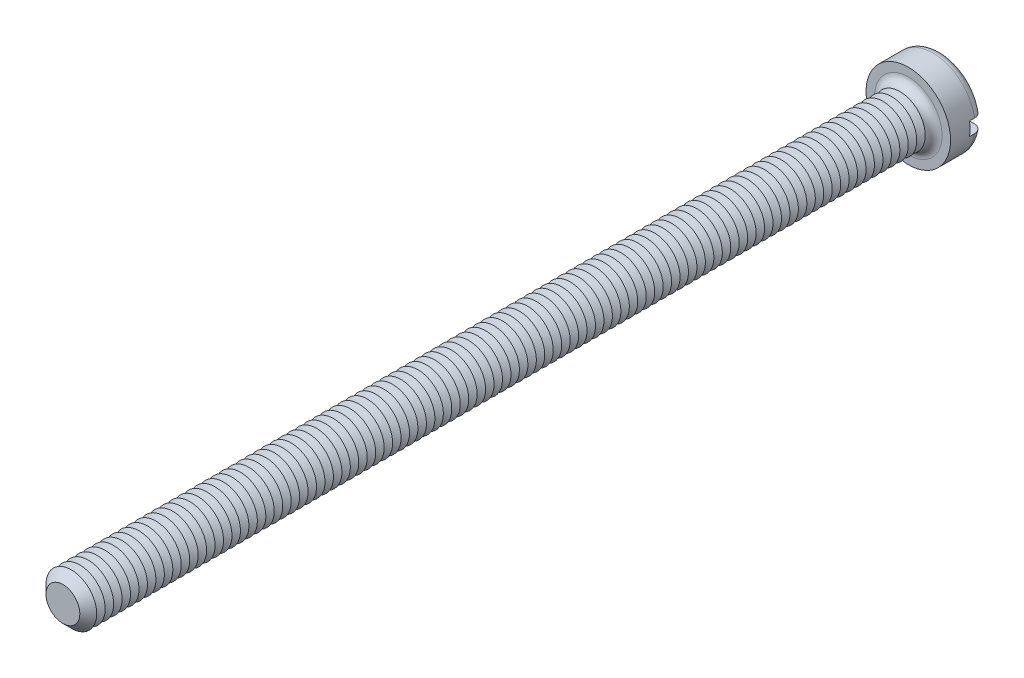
ISO-10303-21;
HEADER;
FILE_DESCRIPTION(('STEP AP214'),'2;1');
FILE_NAME('part.step','',(''),(''),'','','');
FILE_SCHEMA(('AUTOMOTIVE_DESIGN { 1 0 10303 214 1 1 1 1 }'));
ENDSEC;
DATA;
#1=APPLICATION_CONTEXT('core data for automotive mechanical design processes');
#2=APPLICATION_PROTOCOL_DEFINITION('international standard','automotive_design',2000,#1);
#3=PRODUCT_CONTEXT('',#1,'mechanical');
#4=PRODUCT('Part','Part','',(#3));
#5=PRODUCT_RELATED_PRODUCT_CATEGORY('part','',(#4));
#6=PRODUCT_DEFINITION_FORMATION('','',#4);
#7=PRODUCT_DEFINITION_CONTEXT('part definition',#1,'design');
#8=PRODUCT_DEFINITION('design','',#6,#7);
#9=PRODUCT_DEFINITION_SHAPE('','',#8);
#10=(LENGTH_UNIT() NAMED_UNIT(*) SI_UNIT(.MILLI.,.METRE.));
#11=(NAMED_UNIT(*) PLANE_ANGLE_UNIT() SI_UNIT($,.RADIAN.));
#12=(NAMED_UNIT(*) SI_UNIT($,.STERADIAN.) SOLID_ANGLE_UNIT());
#13=UNCERTAINTY_MEASURE_WITH_UNIT(LENGTH_MEASURE(1.E-05),#10,'distance_accuracy_value','');
#14=(GEOMETRIC_REPRESENTATION_CONTEXT(3) GLOBAL_UNCERTAINTY_ASSIGNED_CONTEXT((#13)) GLOBAL_UNIT_ASSIGNED_CONTEXT((#10,
#11,#12)) REPRESENTATION_CONTEXT('',''));
#15=CARTESIAN_POINT('',(0.,0.,0.));
#16=DIRECTION('',(0.,0.,1.));
#17=DIRECTION('',(1.,0.,0.));
#18=AXIS2_PLACEMENT_3D('',#15,#16,#17);
#19=CARTESIAN_POINT('',(0.,0.,-3.9));
#20=DIRECTION('',(0.,0.,1.));
#21=DIRECTION('',(1.,0.,0.));
#22=AXIS2_PLACEMENT_3D('',#19,#20,#21);
#23=PLANE('',#22);
#24=CARTESIAN_POINT('',(0.,0.,-3.9));
#25=DIRECTION('',(0.,0.,1.));
#26=DIRECTION('',(1.,0.,0.));
#27=AXIS2_PLACEMENT_3D('',#24,#25,#26);
#28=CIRCLE('',#27,4.);
#29=CARTESIAN_POINT('',(-3.91918358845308,0.800000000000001,-3.9));
#30=VERTEX_POINT('',#29);
#31=CARTESIAN_POINT('',(3.91918358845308,0.8,-3.9));
#32=VERTEX_POINT('',#31);
#33=EDGE_CURVE('E116',#30,#32,#28,.F.);
#34=ORIENTED_EDGE('',*,*,#33,.T.);
#35=DIRECTION('',(1.,0.,0.));
#36=VECTOR('',#35,1.);
#37=CARTESIAN_POINT('',(-5.,0.800000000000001,-3.9));
#38=LINE('',#37,#36);
#39=EDGE_CURVE('E111',#30,#32,#38,.T.);
#40=ORIENTED_EDGE('',*,*,#39,.F.);
#41=EDGE_LOOP('',(#34,#40));
#42=FACE_BOUND('',#41,.T.);
#43=ADVANCED_FACE('F39',(#42),#23,.F.);
#44=CARTESIAN_POINT('',(0.,0.,-2.9));
#45=DIRECTION('',(0.,0.,1.));
#46=DIRECTION('',(1.,0.,0.));
#47=AXIS2_PLACEMENT_3D('',#44,#45,#46);
#48=TOROIDAL_SURFACE('',#47,4.,1.);
#49=CARTESIAN_POINT('',(-4.76648512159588,0.800000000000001,-3.45304061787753));
#50=CARTESIAN_POINT('',(-4.73486405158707,0.800000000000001,-3.50001565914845));
#51=CARTESIAN_POINT('',(-4.69920787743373,0.800000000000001,-3.54432871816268));
#52=CARTESIAN_POINT('',(-4.62090302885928,0.800000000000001,-3.62634638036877));
#53=CARTESIAN_POINT('',(-4.57824494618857,0.800000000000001,-3.66404194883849));
#54=CARTESIAN_POINT('',(-4.48726975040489,0.800000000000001,-3.73172278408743));
#55=CARTESIAN_POINT('',(-4.43895902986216,0.800000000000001,-3.76171664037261));
#56=CARTESIAN_POINT('',(-4.33804923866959,0.800000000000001,-3.81326437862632));
#57=CARTESIAN_POINT('',(-4.2854512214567,0.800000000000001,-3.8348203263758));
#58=CARTESIAN_POINT('',(-4.17679895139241,0.800000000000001,-3.86918431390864));
#59=CARTESIAN_POINT('',(-4.12071163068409,0.800000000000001,-3.88188775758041));
#60=CARTESIAN_POINT('',(-4.00720729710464,0.800000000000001,-3.89785932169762));
#61=CARTESIAN_POINT('',(-3.94979011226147,0.800000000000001,-3.9011262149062));
#62=CARTESIAN_POINT('',(-3.83429042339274,0.800000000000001,-3.89816676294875));
#63=CARTESIAN_POINT('',(-3.77621176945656,0.800000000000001,-3.89178937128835));
#64=CARTESIAN_POINT('',(-3.66191938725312,0.800000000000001,-3.8694726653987));
#65=CARTESIAN_POINT('',(-3.60570580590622,0.800000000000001,-3.85353259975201));
#66=CARTESIAN_POINT('',(-3.49618749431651,0.800000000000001,-3.81233202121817));
#67=CARTESIAN_POINT('',(-3.44291561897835,0.800000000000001,-3.78698406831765));
#68=CARTESIAN_POINT('',(-3.34140774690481,0.800000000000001,-3.72766098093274));
#69=CARTESIAN_POINT('',(-3.29317182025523,0.800000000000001,-3.69368572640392));
#70=CARTESIAN_POINT('',(-3.20343355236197,0.800000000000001,-3.6182054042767));
#71=CARTESIAN_POINT('',(-3.16189680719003,0.800000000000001,-3.57674128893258));
#72=CARTESIAN_POINT('',(-3.08658236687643,0.800000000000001,-3.48727547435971));
#73=CARTESIAN_POINT('',(-3.05280364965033,0.800000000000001,-3.43927463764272));
#74=CARTESIAN_POINT('',(-2.99489532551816,0.800000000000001,-3.33932895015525));
#75=CARTESIAN_POINT('',(-2.97055012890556,0.800000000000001,-3.28750911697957));
#76=CARTESIAN_POINT('',(-2.93124252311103,0.800000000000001,-3.18042600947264));
#77=CARTESIAN_POINT('',(-2.91627793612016,0.800000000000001,-3.12516353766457));
#78=CARTESIAN_POINT('',(-2.89663075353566,0.800000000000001,-3.01470560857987));
#79=CARTESIAN_POINT('',(-2.89162828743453,0.800000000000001,-2.95956691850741));
#80=CARTESIAN_POINT('',(-2.89112479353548,0.800000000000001,-2.84924961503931));
#81=CARTESIAN_POINT('',(-2.89562264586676,0.800000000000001,-2.79407100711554));
#82=CARTESIAN_POINT('',(-2.91379565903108,0.800000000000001,-2.6861912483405));
#83=CARTESIAN_POINT('',(-2.92731815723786,0.800000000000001,-2.63346424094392));
#84=CARTESIAN_POINT('',(-2.96290888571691,0.800000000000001,-2.53098203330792));
#85=CARTESIAN_POINT('',(-2.98497757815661,0.800000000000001,-2.48122699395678));
#86=CARTESIAN_POINT('',(-3.03728055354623,0.800000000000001,-2.38535286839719));
#87=CARTESIAN_POINT('',(-3.06761989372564,0.800000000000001,-2.33929117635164));
#88=CARTESIAN_POINT('',(-3.13537950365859,0.800000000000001,-2.2527125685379));
#89=CARTESIAN_POINT('',(-3.17280082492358,0.800000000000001,-2.21219647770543));
#90=CARTESIAN_POINT('',(-3.2549164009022,0.800000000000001,-2.13651195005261));
#91=CARTESIAN_POINT('',(-3.29980186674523,0.800000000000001,-2.10155095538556));
#92=CARTESIAN_POINT('',(-3.39467666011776,0.800000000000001,-2.03942270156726));
#93=CARTESIAN_POINT('',(-3.44466673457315,0.800000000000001,-2.01225658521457));
#94=CARTESIAN_POINT('',(-3.5497933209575,0.800000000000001,-1.96576935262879));
#95=CARTESIAN_POINT('',(-3.60503228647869,0.800000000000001,-1.94667963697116));
#96=CARTESIAN_POINT('',(-3.71791613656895,0.800000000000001,-1.91794308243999));
#97=CARTESIAN_POINT('',(-3.77556119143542,0.800000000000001,-1.90829691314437));
#98=CARTESIAN_POINT('',(-3.89221522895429,0.800000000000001,-1.89869331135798));
#99=CARTESIAN_POINT('',(-3.9512319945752,0.800000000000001,-1.89882985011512));
#100=CARTESIAN_POINT('',(-4.06839541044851,0.800000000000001,-1.90907818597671));
#101=CARTESIAN_POINT('',(-4.12654207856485,0.800000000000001,-1.91918977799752));
#102=CARTESIAN_POINT('',(-4.23988103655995,0.800000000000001,-1.9490667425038));
#103=CARTESIAN_POINT('',(-4.29509069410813,0.800000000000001,-1.96876615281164));
#104=CARTESIAN_POINT('',(-4.40134194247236,0.800000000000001,-2.01729572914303));
#105=CARTESIAN_POINT('',(-4.45238383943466,0.800000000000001,-2.04612522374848));
#106=CARTESIAN_POINT('',(-4.54801343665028,0.800000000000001,-2.1116316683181));
#107=CARTESIAN_POINT('',(-4.59268768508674,0.800000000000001,-2.14818225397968));
#108=CARTESIAN_POINT('',(-4.67513924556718,0.800000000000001,-2.22837632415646));
#109=CARTESIAN_POINT('',(-4.71291715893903,0.800000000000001,-2.27201918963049));
#110=CARTESIAN_POINT('',(-4.77986554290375,0.800000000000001,-2.36439990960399));
#111=CARTESIAN_POINT('',(-4.80916462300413,0.800000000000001,-2.41304457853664));
#112=CARTESIAN_POINT('',(-4.85906149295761,0.800000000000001,-2.51460659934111));
#113=CARTESIAN_POINT('',(-4.8796602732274,0.800000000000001,-2.56752346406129));
#114=CARTESIAN_POINT('',(-4.9113264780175,0.800000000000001,-2.67542592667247));
#115=CARTESIAN_POINT('',(-4.92250819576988,0.800000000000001,-2.73037800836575));
#116=CARTESIAN_POINT('',(-4.93542682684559,0.800000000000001,-2.84139649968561));
#117=CARTESIAN_POINT('',(-4.93716171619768,0.800000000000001,-2.89746314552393));
#118=CARTESIAN_POINT('',(-4.93114851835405,0.800000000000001,-3.00876455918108));
#119=CARTESIAN_POINT('',(-4.92345325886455,0.800000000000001,-3.0640022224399));
#120=CARTESIAN_POINT('',(-4.8989032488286,0.800000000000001,-3.17235240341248));
#121=CARTESIAN_POINT('',(-4.88205998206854,0.800000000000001,-3.22546749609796));
#122=CARTESIAN_POINT('',(-4.84819200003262,0.800000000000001,-3.30764066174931));
#123=CARTESIAN_POINT('',(-4.83390853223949,0.800000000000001,-3.33785845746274));
#124=CARTESIAN_POINT('',(-4.80237957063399,0.800000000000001,-3.39670633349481));
#125=CARTESIAN_POINT('',(-4.78513409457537,0.800000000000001,-3.42533642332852));
#126=CARTESIAN_POINT('',(-4.76648512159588,0.800000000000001,-3.45304061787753));
#127=B_SPLINE_CURVE_WITH_KNOTS('',3,(#49,#50,#51,#52,#53,#54,#55,#56,#57,#58,#59,#60,#61,#62,
#63,#64,#65,#66,#67,#68,#69,#70,#71,#72,#73,#74,#75,#76,#77,#78,#79,#80,#81,#82,#83,#84,#85,#86,
#87,#88,#89,#90,#91,#92,#93,#94,#95,#96,#97,#98,#99,#100,#101,#102,#103,#104,#105,#106,#107,
#108,#109,#110,#111,#112,#113,#114,#115,#116,#117,#118,#119,#120,#121,#122,#123,#124,#125,#126),
.UNSPECIFIED.,.T.,.F.,(4,2,2,2,2,2,2,2,2,2,2,2,2,2,2,2,2,2,2,2,2,2,2,2,2,2,2,2,2,2,2,2,2,2,2,2,
2,2,4),(0.,0.169755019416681,0.339740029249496,0.509534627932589,0.67928763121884,
0.851013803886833,1.02276230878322,1.19722869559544,1.37170879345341,1.54785292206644,
1.72399950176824,1.89921049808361,2.07439839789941,2.24530597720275,2.41617386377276,
2.58146078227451,2.74672821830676,2.90926852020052,3.0718176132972,3.2365363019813,
3.40127946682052,3.57118676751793,3.74111896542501,3.91563534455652,4.09016409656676,
4.26636956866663,4.4425714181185,4.61757781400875,4.79257134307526,4.96489650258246,
5.13720662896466,5.30674670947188,5.47626748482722,5.64369988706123,5.81116816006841,
5.97770254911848,6.14402836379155,6.24414438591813,6.34425980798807),.UNSPECIFIED.);
#128=CARTESIAN_POINT('',(-4.93558507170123,0.800000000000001,-2.9));
#129=VERTEX_POINT('',#128);
#130=EDGE_CURVE('E963',#129,#30,#127,.T.);
#131=ORIENTED_EDGE('',*,*,#130,.F.);
#132=CARTESIAN_POINT('',(0.,0.,-2.9));
#133=DIRECTION('',(0.,0.,1.));
#134=DIRECTION('',(1.,0.,0.));
#135=AXIS2_PLACEMENT_3D('',#132,#133,#134);
#136=CIRCLE('',#135,5.);
#137=CARTESIAN_POINT('',(4.93558507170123,0.8,-2.9));
#138=VERTEX_POINT('',#137);
#139=EDGE_CURVE('E125',#138,#129,#136,.T.);
#140=ORIENTED_EDGE('',*,*,#139,.F.);
#141=CARTESIAN_POINT('',(2.98553785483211,0.8,-3.31649797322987));
#142=CARTESIAN_POINT('',(3.00991125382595,0.8,-3.36788093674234));
#143=CARTESIAN_POINT('',(3.03875556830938,0.8,-3.41719756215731));
#144=CARTESIAN_POINT('',(3.1043993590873,0.8,-3.51028676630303));
#145=CARTESIAN_POINT('',(3.1412115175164,0.8,-3.55405032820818));
#146=CARTESIAN_POINT('',(3.22153641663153,0.8,-3.63476402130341));
#147=CARTESIAN_POINT('',(3.26503706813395,0.8,-3.67172618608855));
#148=CARTESIAN_POINT('',(3.35749627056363,0.8,-3.73799476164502));
#149=CARTESIAN_POINT('',(3.4064533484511,0.8,-3.76730323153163));
#150=CARTESIAN_POINT('',(3.5095773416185,0.8,-3.81809642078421));
#151=CARTESIAN_POINT('',(3.56383317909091,0.8,-3.83940072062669));
#152=CARTESIAN_POINT('',(3.67513017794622,0.8,-3.87272481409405));
#153=CARTESIAN_POINT('',(3.7321717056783,0.8,-3.88474338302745));
#154=CARTESIAN_POINT('',(3.84815688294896,0.8,-3.89923413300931));
#155=CARTESIAN_POINT('',(3.90711516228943,0.8,-3.9015896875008));
#156=CARTESIAN_POINT('',(4.02458610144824,0.8,-3.89631753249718));
#157=CARTESIAN_POINT('',(4.08309876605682,0.8,-3.8886899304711));
#158=CARTESIAN_POINT('',(4.19768646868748,0.8,-3.86366584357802));
#159=CARTESIAN_POINT('',(4.25377243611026,0.8,-3.84631948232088));
#160=CARTESIAN_POINT('',(4.3621676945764,0.8,-3.80231797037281));
#161=CARTESIAN_POINT('',(4.41447726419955,0.8,-3.77566350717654));
#162=CARTESIAN_POINT('',(4.51300872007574,0.8,-3.71421163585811));
#163=CARTESIAN_POINT('',(4.5593085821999,0.8,-3.67953927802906));
#164=CARTESIAN_POINT('',(4.64530675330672,0.8,-3.60279495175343));
#165=CARTESIAN_POINT('',(4.68500564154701,0.8,-3.56072363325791));
#166=CARTESIAN_POINT('',(4.75599202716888,0.8,-3.47111750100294));
#167=CARTESIAN_POINT('',(4.7874061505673,0.8,-3.42368298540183));
#168=CARTESIAN_POINT('',(4.84170328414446,0.8,-3.32415927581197));
#169=CARTESIAN_POINT('',(4.86458695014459,0.8,-3.2720704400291));
#170=CARTESIAN_POINT('',(4.90088120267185,0.8,-3.16544016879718));
#171=CARTESIAN_POINT('',(4.91440984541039,0.8,-3.11093889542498));
#172=CARTESIAN_POINT('',(4.93205429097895,0.8,-3.00043391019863));
#173=CARTESIAN_POINT('',(4.93617053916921,0.8,-2.9444302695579));
#174=CARTESIAN_POINT('',(4.93486973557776,0.8,-2.83292218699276));
#175=CARTESIAN_POINT('',(4.92951827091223,0.8,-2.77741696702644));
#176=CARTESIAN_POINT('',(4.90957104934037,0.8,-2.66809456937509));
#177=CARTESIAN_POINT('',(4.89497541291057,0.8,-2.61427736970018));
#178=CARTESIAN_POINT('',(4.85697876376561,0.8,-2.50985095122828));
#179=CARTESIAN_POINT('',(4.83357805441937,0.8,-2.45924162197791));
#180=CARTESIAN_POINT('',(4.77866660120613,0.8,-2.36263484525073));
#181=CARTESIAN_POINT('',(4.74715567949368,0.8,-2.31663749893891));
#182=CARTESIAN_POINT('',(4.67670791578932,0.8,-2.23021464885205));
#183=CARTESIAN_POINT('',(4.6377224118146,0.8,-2.1898288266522));
#184=CARTESIAN_POINT('',(4.55359880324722,0.8,-2.11607828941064));
#185=CARTESIAN_POINT('',(4.50846036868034,0.8,-2.08271395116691));
#186=CARTESIAN_POINT('',(4.41271544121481,0.8,-2.02349513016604));
#187=CARTESIAN_POINT('',(4.36204749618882,0.8,-1.99774003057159));
#188=CARTESIAN_POINT('',(4.257155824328,0.8,-1.95495040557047));
#189=CARTESIAN_POINT('',(4.20293181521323,0.8,-1.93791657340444));
#190=CARTESIAN_POINT('',(4.09154156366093,0.8,-1.91276335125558));
#191=CARTESIAN_POINT('',(4.03434212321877,0.8,-1.90479098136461));
#192=CARTESIAN_POINT('',(3.91941228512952,0.8,-1.89840884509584));
#193=CARTESIAN_POINT('',(3.8616818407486,0.8,-1.89999992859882));
#194=CARTESIAN_POINT('',(3.7464111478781,0.8,-1.91275144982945));
#195=CARTESIAN_POINT('',(3.6888866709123,0.8,-1.92405471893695));
#196=CARTESIAN_POINT('',(3.57652290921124,0.8,-1.95609086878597));
#197=CARTESIAN_POINT('',(3.52168382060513,0.8,-1.97682443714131));
#198=CARTESIAN_POINT('',(3.41589179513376,0.8,-2.02733294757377));
#199=CARTESIAN_POINT('',(3.36496676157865,0.8,-2.05716640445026));
#200=CARTESIAN_POINT('',(3.26890903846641,0.8,-2.12504079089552));
#201=CARTESIAN_POINT('',(3.22377627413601,0.8,-2.16308161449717));
#202=CARTESIAN_POINT('',(3.141135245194,0.8,-2.24593284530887));
#203=CARTESIAN_POINT('',(3.1035541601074,0.8,-2.29067053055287));
#204=CARTESIAN_POINT('',(3.03669700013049,0.8,-2.38597317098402));
#205=CARTESIAN_POINT('',(3.00741914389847,0.8,-2.43653687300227));
#206=CARTESIAN_POINT('',(2.95891799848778,0.8,-2.54052959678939));
#207=CARTESIAN_POINT('',(2.93943249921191,0.8,-2.59383627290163));
#208=CARTESIAN_POINT('',(2.9100081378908,0.8,-2.70303736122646));
#209=CARTESIAN_POINT('',(2.90006970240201,0.8,-2.75893188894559));
#210=CARTESIAN_POINT('',(2.89027863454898,0.8,-2.86986958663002));
#211=CARTESIAN_POINT('',(2.89012791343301,0.8,-2.92488680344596));
#212=CARTESIAN_POINT('',(2.89917145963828,0.8,-3.03409648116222));
#213=CARTESIAN_POINT('',(2.90835313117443,0.8,-3.08828995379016));
#214=CARTESIAN_POINT('',(2.92977618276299,0.8,-3.17141652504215));
#215=CARTESIAN_POINT('',(2.93899011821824,0.8,-3.20116372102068));
#216=CARTESIAN_POINT('',(2.96020249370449,0.8,-3.25964614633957));
#217=CARTESIAN_POINT('',(2.97220082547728,0.8,-3.28838141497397));
#218=CARTESIAN_POINT('',(2.98553785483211,0.8,-3.31649797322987));
#219=B_SPLINE_CURVE_WITH_KNOTS('',3,(#141,#142,#143,#144,#145,#146,#147,#148,#149,#150,#151,
#152,#153,#154,#155,#156,#157,#158,#159,#160,#161,#162,#163,#164,#165,#166,#167,#168,#169,#170,
#171,#172,#173,#174,#175,#176,#177,#178,#179,#180,#181,#182,#183,#184,#185,#186,#187,#188,#189,
#190,#191,#192,#193,#194,#195,#196,#197,#198,#199,#200,#201,#202,#203,#204,#205,#206,#207,#208,
#209,#210,#211,#212,#213,#214,#215,#216,#217,#218),.UNSPECIFIED.,.T.,.F.,(4,2,2,2,2,2,2,2,2,2,2,
2,2,2,2,2,2,2,2,2,2,2,2,2,2,2,2,2,2,2,2,2,2,2,2,2,2,2,4),(0.,0.170493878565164,
0.341261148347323,0.511723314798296,0.682139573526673,0.856194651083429,1.03027268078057,
1.20644565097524,1.38261672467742,1.55788746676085,1.73314526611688,1.90583484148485,
2.07850925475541,2.24836742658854,2.41821253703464,2.58587311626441,2.75352576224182,
2.92002154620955,3.08651516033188,3.25300303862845,3.41949456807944,3.58710926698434,
3.75473295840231,3.92445790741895,4.09419634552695,4.26665110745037,4.43912119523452,
4.61417197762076,4.78923552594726,4.96544940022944,5.1416609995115,5.31608191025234,
5.49046537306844,5.65989063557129,5.82932346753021,5.99359365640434,6.157642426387,
6.250939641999,6.34423323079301),.UNSPECIFIED.);
#220=EDGE_CURVE('E965',#32,#138,#219,.T.);
#221=ORIENTED_EDGE('',*,*,#220,.F.);
#222=ORIENTED_EDGE('',*,*,#33,.F.);
#223=EDGE_LOOP('',(#131,#140,#221,#222));
#224=FACE_BOUND('',#223,.T.);
#225=ADVANCED_FACE('F947',(#224),#48,.T.);
#226=CARTESIAN_POINT('',(0.,0.,-3.9));
#227=DIRECTION('',(0.,0.,1.));
#228=DIRECTION('',(1.,0.,0.));
#229=AXIS2_PLACEMENT_3D('',#226,#227,#228);
#230=CYLINDRICAL_SURFACE('',#229,5.);
#231=DIRECTION('',(0.,0.,1.));
#232=VECTOR('',#231,1.);
#233=CARTESIAN_POINT('',(4.93558507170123,0.8,-3.9));
#234=LINE('',#233,#232);
#235=CARTESIAN_POINT('',(4.93558507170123,0.8,-2.3));
#236=VERTEX_POINT('',#235);
#237=EDGE_CURVE('E980',#138,#236,#234,.T.);
#238=ORIENTED_EDGE('',*,*,#237,.F.);
#239=ORIENTED_EDGE('',*,*,#139,.T.);
#240=DIRECTION('',(0.,0.,1.));
#241=VECTOR('',#240,1.);
#242=CARTESIAN_POINT('',(-4.93558507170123,0.800000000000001,-3.9));
#243=LINE('',#242,#241);
#244=CARTESIAN_POINT('',(-4.93558507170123,0.800000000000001,-2.3));
#245=VERTEX_POINT('',#244);
#246=EDGE_CURVE('E63',#245,#129,#243,.F.);
#247=ORIENTED_EDGE('',*,*,#246,.F.);
#248=CARTESIAN_POINT('',(0.,0.,-2.3));
#249=DIRECTION('',(0.,0.,-1.));
#250=DIRECTION('',(-1.,0.,0.));
#251=AXIS2_PLACEMENT_3D('',#248,#249,#250);
#252=CIRCLE('',#251,5.);
#253=CARTESIAN_POINT('',(-4.93558507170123,-0.799999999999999,-2.3));
#254=VERTEX_POINT('',#253);
#255=EDGE_CURVE('E43',#245,#254,#252,.F.);
#256=ORIENTED_EDGE('',*,*,#255,.T.);
#257=DIRECTION('',(0.,0.,1.));
#258=VECTOR('',#257,1.);
#259=CARTESIAN_POINT('',(-4.93558507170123,-0.799999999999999,-3.9));
#260=LINE('',#259,#258);
#261=CARTESIAN_POINT('',(-4.93558507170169,-0.799999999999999,-2.89999999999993));
#262=VERTEX_POINT('',#261);
#263=EDGE_CURVE('E978',#262,#254,#260,.T.);
#264=ORIENTED_EDGE('',*,*,#263,.F.);
#265=CARTESIAN_POINT('',(4.93558507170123,-0.8,-2.9));
#266=VERTEX_POINT('',#265);
#267=EDGE_CURVE('E127',#262,#266,#136,.T.);
#268=ORIENTED_EDGE('',*,*,#267,.T.);
#269=DIRECTION('',(0.,0.,1.));
#270=VECTOR('',#269,1.);
#271=CARTESIAN_POINT('',(4.93558507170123,-0.8,-3.9));
#272=LINE('',#271,#270);
#273=CARTESIAN_POINT('',(4.93558507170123,-0.8,-2.3));
#274=VERTEX_POINT('',#273);
#275=EDGE_CURVE('E55',#274,#266,#272,.F.);
#276=ORIENTED_EDGE('',*,*,#275,.F.);
#277=EDGE_CURVE('E11',#274,#236,#252,.F.);
#278=ORIENTED_EDGE('',*,*,#277,.T.);
#279=EDGE_LOOP('',(#238,#239,#247,#256,#264,#268,#276,#278));
#280=FACE_BOUND('',#279,.T.);
#281=CARTESIAN_POINT('',(0.,0.,0.));
#282=DIRECTION('',(0.,0.,1.));
#283=DIRECTION('',(1.,0.,0.));
#284=AXIS2_PLACEMENT_3D('',#281,#282,#283);
#285=CIRCLE('',#284,5.);
#286=CARTESIAN_POINT('',(5.,0.,0.));
#287=VERTEX_POINT('',#286);
#288=EDGE_CURVE('E982',#287,#287,#285,.T.);
#289=ORIENTED_EDGE('',*,*,#288,.F.);
#290=EDGE_LOOP('',(#289));
#291=FACE_BOUND('',#290,.T.);
#292=ADVANCED_FACE('F943',(#280,#291),#230,.T.);
#293=CARTESIAN_POINT('',(3.91918358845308,-0.8,-3.9));
#294=VERTEX_POINT('',#293);
#295=CARTESIAN_POINT('',(-3.91918358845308,-0.799999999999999,-3.9));
#296=VERTEX_POINT('',#295);
#297=EDGE_CURVE('E109',#294,#296,#28,.F.);
#298=ORIENTED_EDGE('',*,*,#297,.T.);
#299=DIRECTION('',(-1.,0.,0.));
#300=VECTOR('',#299,1.);
#301=CARTESIAN_POINT('',(-5.,-0.799999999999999,-3.9));
#302=LINE('',#301,#300);
#303=EDGE_CURVE('E96',#294,#296,#302,.T.);
#304=ORIENTED_EDGE('',*,*,#303,.F.);
#305=EDGE_LOOP('',(#298,#304));
#306=FACE_BOUND('',#305,.T.);
#307=ADVANCED_FACE('F108',(#306),#23,.F.);
#308=CARTESIAN_POINT('',(0.,0.,0.));
#309=DIRECTION('',(0.,0.,1.));
#310=DIRECTION('',(1.,0.,0.));
#311=AXIS2_PLACEMENT_3D('',#308,#309,#310);
#312=PLANE('',#311);
#313=CARTESIAN_POINT('',(0.,0.,0.));
#314=DIRECTION('',(0.,0.,1.));
#315=DIRECTION('',(1.,0.,0.));
#316=AXIS2_PLACEMENT_3D('',#313,#314,#315);
#317=CIRCLE('',#316,4.);
#318=CARTESIAN_POINT('',(4.,0.,0.));
#319=VERTEX_POINT('',#318);
#320=EDGE_CURVE('E115',#319,#319,#317,.F.);
#321=ORIENTED_EDGE('',*,*,#320,.T.);
#322=EDGE_LOOP('',(#321));
#323=FACE_BOUND('',#322,.T.);
#324=ORIENTED_EDGE('',*,*,#288,.T.);
#325=EDGE_LOOP('',(#324));
#326=FACE_BOUND('',#325,.T.);
#327=ADVANCED_FACE('F942',(#323,#326),#312,.T.);
#328=CARTESIAN_POINT('',(-4.76648512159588,-0.799999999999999,-3.45304061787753));
#329=CARTESIAN_POINT('',(-4.7975694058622,-0.799999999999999,-3.40685392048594));
#330=CARTESIAN_POINT('',(-4.82479903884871,-0.799999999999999,-3.35802740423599));
#331=CARTESIAN_POINT('',(-4.87070632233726,-0.799999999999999,-3.25646127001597));
#332=CARTESIAN_POINT('',(-4.8893747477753,-0.799999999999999,-3.20371750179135));
#333=CARTESIAN_POINT('',(-4.91756720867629,-0.799999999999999,-3.09584501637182));
#334=CARTESIAN_POINT('',(-4.92709302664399,-0.799999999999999,-3.04071676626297));
#335=CARTESIAN_POINT('',(-4.93671217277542,-0.799999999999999,-2.92965669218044));
#336=CARTESIAN_POINT('',(-4.93680767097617,-0.799999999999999,-2.87372505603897));
#337=CARTESIAN_POINT('',(-4.92758675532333,-0.799999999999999,-2.76284675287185));
#338=CARTESIAN_POINT('',(-4.91830421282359,-0.799999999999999,-2.70789726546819));
#339=CARTESIAN_POINT('',(-4.89065741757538,-0.799999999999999,-2.60033228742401));
#340=CARTESIAN_POINT('',(-4.87229291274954,-0.799999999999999,-2.54771686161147));
#341=CARTESIAN_POINT('',(-4.82699855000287,-0.799999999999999,-2.44622441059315));
#342=CARTESIAN_POINT('',(-4.80005659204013,-0.799999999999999,-2.39735278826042));
#343=CARTESIAN_POINT('',(-4.73841244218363,-0.799999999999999,-2.30477947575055));
#344=CARTESIAN_POINT('',(-4.70371003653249,-0.799999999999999,-2.26107792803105));
#345=CARTESIAN_POINT('',(-4.62724516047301,-0.799999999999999,-2.17969334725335));
#346=CARTESIAN_POINT('',(-4.58542787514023,-0.799999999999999,-2.14206183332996));
#347=CARTESIAN_POINT('',(-4.49614171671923,-0.799999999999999,-2.07424284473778));
#348=CARTESIAN_POINT('',(-4.44867251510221,-0.799999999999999,-2.04405580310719));
#349=CARTESIAN_POINT('',(-4.34875035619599,-0.799999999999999,-1.99153688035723));
#350=CARTESIAN_POINT('',(-4.29623870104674,-0.799999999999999,-1.96931670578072));
#351=CARTESIAN_POINT('',(-4.18826905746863,-0.799999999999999,-1.93384994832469));
#352=CARTESIAN_POINT('',(-4.1328108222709,-0.799999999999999,-1.92060411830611));
#353=CARTESIAN_POINT('',(-4.01956054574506,-0.799999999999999,-1.90323798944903));
#354=CARTESIAN_POINT('',(-3.96174522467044,-0.799999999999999,-1.89926947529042));
#355=CARTESIAN_POINT('',(-3.84625419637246,-0.799999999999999,-1.90095183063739));
#356=CARTESIAN_POINT('',(-3.78857850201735,-0.799999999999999,-1.90660355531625));
#357=CARTESIAN_POINT('',(-3.67415602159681,-0.799999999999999,-1.92748272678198));
#358=CARTESIAN_POINT('',(-3.61743328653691,-0.799999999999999,-1.94284216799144));
#359=CARTESIAN_POINT('',(-3.50734962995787,-0.799999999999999,-1.9828275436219));
#360=CARTESIAN_POINT('',(-3.4539889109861,-0.799999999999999,-2.00745403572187));
#361=CARTESIAN_POINT('',(-3.35197118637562,-0.799999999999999,-2.06542964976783));
#362=CARTESIAN_POINT('',(-3.30333217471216,-0.799999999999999,-2.0988104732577));
#363=CARTESIAN_POINT('',(-3.21244692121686,-0.799999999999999,-2.17337326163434));
#364=CARTESIAN_POINT('',(-3.17020039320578,-0.799999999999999,-2.21455487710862));
#365=CARTESIAN_POINT('',(-3.0940098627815,-0.799999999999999,-2.30296695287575));
#366=CARTESIAN_POINT('',(-3.05995540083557,-0.799999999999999,-2.35010211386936));
#367=CARTESIAN_POINT('',(-3.00053815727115,-0.799999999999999,-2.4495670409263));
#368=CARTESIAN_POINT('',(-2.97517362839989,-0.799999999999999,-2.50189576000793));
#369=CARTESIAN_POINT('',(-2.93470320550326,-0.799999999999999,-2.60853979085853));
#370=CARTESIAN_POINT('',(-2.91930557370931,-0.799999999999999,-2.66274437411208));
#371=CARTESIAN_POINT('',(-2.89812734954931,-0.799999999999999,-2.77299836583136));
#372=CARTESIAN_POINT('',(-2.89234481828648,-0.799999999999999,-2.82904740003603));
#373=CARTESIAN_POINT('',(-2.89064073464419,-0.799999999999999,-2.93970612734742));
#374=CARTESIAN_POINT('',(-2.89444549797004,-0.799999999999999,-2.99431180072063));
#375=CARTESIAN_POINT('',(-2.9112006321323,-0.799999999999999,-3.10209766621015));
#376=CARTESIAN_POINT('',(-2.9241507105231,-0.799999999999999,-3.1552779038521));
#377=CARTESIAN_POINT('',(-2.95868580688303,-0.799999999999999,-3.25858631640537));
#378=CARTESIAN_POINT('',(-2.98024709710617,-0.799999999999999,-3.30872244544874));
#379=CARTESIAN_POINT('',(-3.03128544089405,-0.799999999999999,-3.40478519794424));
#380=CARTESIAN_POINT('',(-3.06076335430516,-0.799999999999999,-3.45071136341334));
#381=CARTESIAN_POINT('',(-3.12753448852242,-0.799999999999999,-3.53826932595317));
#382=CARTESIAN_POINT('',(-3.16500083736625,-0.799999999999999,-3.57976901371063));
#383=CARTESIAN_POINT('',(-3.24617503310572,-0.799999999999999,-3.65613204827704));
#384=CARTESIAN_POINT('',(-3.28988388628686,-0.799999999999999,-3.69099432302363));
#385=CARTESIAN_POINT('',(-3.38380639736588,-0.799999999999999,-3.75424083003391));
#386=CARTESIAN_POINT('',(-3.43418287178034,-0.799999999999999,-3.78238342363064));
#387=CARTESIAN_POINT('',(-3.53887888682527,-0.799999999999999,-3.83000231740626));
#388=CARTESIAN_POINT('',(-3.59319889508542,-0.799999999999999,-3.84947758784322));
#389=CARTESIAN_POINT('',(-3.70539237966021,-0.799999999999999,-3.87954336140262));
#390=CARTESIAN_POINT('',(-3.76331464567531,-0.799999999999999,-3.88995217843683));
#391=CARTESIAN_POINT('',(-3.88008461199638,-0.799999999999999,-3.9009132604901));
#392=CARTESIAN_POINT('',(-3.93893230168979,-0.799999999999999,-3.9014656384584));
#393=CARTESIAN_POINT('',(-4.05594892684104,-0.799999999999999,-3.89264187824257));
#394=CARTESIAN_POINT('',(-4.11411702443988,-0.799999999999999,-3.88325457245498));
#395=CARTESIAN_POINT('',(-4.22802928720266,-0.799999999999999,-3.85472582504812));
#396=CARTESIAN_POINT('',(-4.28377297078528,-0.799999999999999,-3.83558245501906));
#397=CARTESIAN_POINT('',(-4.39054463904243,-0.799999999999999,-3.78829842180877));
#398=CARTESIAN_POINT('',(-4.44161887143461,-0.799999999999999,-3.76026208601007));
#399=CARTESIAN_POINT('',(-4.53818016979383,-0.799999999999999,-3.69589278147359));
#400=CARTESIAN_POINT('',(-4.58367442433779,-0.799999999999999,-3.65957066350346));
#401=CARTESIAN_POINT('',(-4.65208830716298,-0.799999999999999,-3.59453310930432));
#402=CARTESIAN_POINT('',(-4.67711825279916,-0.799999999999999,-3.56800018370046));
#403=CARTESIAN_POINT('',(-4.72414423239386,-0.799999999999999,-3.51236863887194));
#404=CARTESIAN_POINT('',(-4.74614029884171,-0.799999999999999,-3.48327004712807));
#405=CARTESIAN_POINT('',(-4.76648512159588,-0.799999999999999,-3.45304061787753));
#406=B_SPLINE_CURVE_WITH_KNOTS('',3,(#328,#329,#330,#331,#332,#333,#334,#335,#336,#337,#338,
#339,#340,#341,#342,#343,#344,#345,#346,#347,#348,#349,#350,#351,#352,#353,#354,#355,#356,#357,
#358,#359,#360,#361,#362,#363,#364,#365,#366,#367,#368,#369,#370,#371,#372,#373,#374,#375,#376,
#377,#378,#379,#380,#381,#382,#383,#384,#385,#386,#387,#388,#389,#390,#391,#392,#393,#394,#395,
#396,#397,#398,#399,#400,#401,#402,#403,#404,#405),.UNSPECIFIED.,.T.,.F.,(4,2,2,2,2,2,2,2,2,2,2,
2,2,2,2,2,2,2,2,2,2,2,2,2,2,2,2,2,2,2,2,2,2,2,2,2,2,2,4),(0.,0.166886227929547,
0.333951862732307,0.500984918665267,0.667979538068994,0.834373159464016,1.00077139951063,
1.16740542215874,1.33404403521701,1.50202999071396,1.67002571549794,1.84029248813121,
2.01057354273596,2.18362161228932,2.35668506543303,2.53215380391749,2.70763310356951,
2.88375684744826,3.05987270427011,3.23346085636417,3.40701408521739,3.57522519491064,
3.74340238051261,3.90683338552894,4.0702591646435,4.23323770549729,4.39623395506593,
4.56320691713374,4.7302068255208,4.90252468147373,5.07486300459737,5.25058028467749,
5.42629555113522,5.60220844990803,5.77815613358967,5.95211162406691,6.12584060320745,
6.23506966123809,6.34429754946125),.UNSPECIFIED.);
#407=EDGE_CURVE('E103',#296,#262,#406,.T.);
#408=ORIENTED_EDGE('',*,*,#407,.F.);
#409=ORIENTED_EDGE('',*,*,#297,.F.);
#410=CARTESIAN_POINT('',(2.98553785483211,-0.8,-3.31649797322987));
#411=CARTESIAN_POINT('',(2.96216773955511,-0.8,-3.26721849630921));
#412=CARTESIAN_POINT('',(2.94287503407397,-0.8,-3.21596872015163));
#413=CARTESIAN_POINT('',(2.91313258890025,-0.8,-3.11092723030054));
#414=CARTESIAN_POINT('',(2.9026902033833,-0.8,-3.0571334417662));
#415=CARTESIAN_POINT('',(2.89104377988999,-0.8,-2.94853922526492));
#416=CARTESIAN_POINT('',(2.88984130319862,-0.8,-2.89373862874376));
#417=CARTESIAN_POINT('',(2.89672585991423,-0.8,-2.78473646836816));
#418=CARTESIAN_POINT('',(2.90481120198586,-0.8,-2.73053479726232));
#419=CARTESIAN_POINT('',(2.92989134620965,-0.8,-2.62460092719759));
#420=CARTESIAN_POINT('',(2.94682969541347,-0.8,-2.57285532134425));
#421=CARTESIAN_POINT('',(2.9889990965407,-0.8,-2.47286425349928));
#422=CARTESIAN_POINT('',(3.01423103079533,-0.8,-2.42461916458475));
#423=CARTESIAN_POINT('',(3.07271536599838,-0.8,-2.33201565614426));
#424=CARTESIAN_POINT('',(3.10610710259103,-0.8,-2.28774532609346));
#425=CARTESIAN_POINT('',(3.17963417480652,-0.8,-2.205215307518));
#426=CARTESIAN_POINT('',(3.21977054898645,-0.8,-2.16695654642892));
#427=CARTESIAN_POINT('',(3.3070361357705,-0.8,-2.09624274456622));
#428=CARTESIAN_POINT('',(3.35434874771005,-0.8,-2.06401396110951));
#429=CARTESIAN_POINT('',(3.45361131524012,-0.8,-2.00773436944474));
#430=CARTESIAN_POINT('',(3.50556189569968,-0.8,-1.98368466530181));
#431=CARTESIAN_POINT('',(3.61398433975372,-0.8,-1.94389460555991));
#432=CARTESIAN_POINT('',(3.67053506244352,-0.8,-1.92836880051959));
#433=CARTESIAN_POINT('',(3.78543606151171,-0.8,-1.90696594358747));
#434=CARTESIAN_POINT('',(3.84378643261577,-0.8,-1.90108940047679));
#435=CARTESIAN_POINT('',(3.96100201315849,-0.8,-1.89918115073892));
#436=CARTESIAN_POINT('',(4.01986821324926,-0.8,-1.90320860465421));
#437=CARTESIAN_POINT('',(4.13606891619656,-0.8,-1.9211820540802));
#438=CARTESIAN_POINT('',(4.19340347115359,-0.8,-1.93512771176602));
#439=CARTESIAN_POINT('',(4.30434213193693,-0.8,-1.97243705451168));
#440=CARTESIAN_POINT('',(4.35797549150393,-0.8,-1.99571368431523));
#441=CARTESIAN_POINT('',(4.46048254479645,-0.8,-2.0510826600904));
#442=CARTESIAN_POINT('',(4.50935662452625,-0.8,-2.08317429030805));
#443=CARTESIAN_POINT('',(4.60012348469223,-0.8,-2.15471647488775));
#444=CARTESIAN_POINT('',(4.64211506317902,-0.8,-2.19404167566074));
#445=CARTESIAN_POINT('',(4.71877054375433,-0.8,-2.27928299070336));
#446=CARTESIAN_POINT('',(4.75343508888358,-0.8,-2.32519852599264));
#447=CARTESIAN_POINT('',(4.81388799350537,-0.8,-2.4215411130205));
#448=CARTESIAN_POINT('',(4.83980652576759,-0.8,-2.47188650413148));
#449=CARTESIAN_POINT('',(4.88271402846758,-0.8,-2.57624865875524));
#450=CARTESIAN_POINT('',(4.89970360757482,-0.8,-2.63026517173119));
#451=CARTESIAN_POINT('',(4.92409334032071,-0.8,-2.73978844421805));
#452=CARTESIAN_POINT('',(4.93159814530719,-0.8,-2.79527191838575));
#453=CARTESIAN_POINT('',(4.93713723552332,-0.8,-2.90670881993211));
#454=CARTESIAN_POINT('',(4.9351718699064,-0.8,-2.9626622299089));
#455=CARTESIAN_POINT('',(4.92186293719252,-0.8,-3.07317093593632));
#456=CARTESIAN_POINT('',(4.91056393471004,-0.8,-3.12773160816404));
#457=CARTESIAN_POINT('',(4.87898532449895,-0.8,-3.234187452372));
#458=CARTESIAN_POINT('',(4.85870572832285,-0.8,-3.28608262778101));
#459=CARTESIAN_POINT('',(4.80971634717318,-0.8,-3.38586723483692));
#460=CARTESIAN_POINT('',(4.78098824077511,-0.8,-3.43374766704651));
#461=CARTESIAN_POINT('',(4.71596686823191,-0.8,-3.52405937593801));
#462=CARTESIAN_POINT('',(4.67967336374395,-0.8,-3.56649048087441));
#463=CARTESIAN_POINT('',(4.60022577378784,-0.8,-3.64511036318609));
#464=CARTESIAN_POINT('',(4.5570143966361,-0.8,-3.6812412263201));
#465=CARTESIAN_POINT('',(4.4652099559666,-0.8,-3.7458530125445));
#466=CARTESIAN_POINT('',(4.41661654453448,-0.8,-3.77433344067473));
#467=CARTESIAN_POINT('',(4.31470683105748,-0.8,-3.82326981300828));
#468=CARTESIAN_POINT('',(4.26133399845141,-0.8,-3.84360800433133));
#469=CARTESIAN_POINT('',(4.15196444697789,-0.8,-3.87519515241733));
#470=CARTESIAN_POINT('',(4.09596750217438,-0.8,-3.88644332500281));
#471=CARTESIAN_POINT('',(3.98196469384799,-0.8,-3.89971870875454));
#472=CARTESIAN_POINT('',(3.92394096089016,-0.8,-3.901592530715));
#473=CARTESIAN_POINT('',(3.8083852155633,-0.8,-3.89570840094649));
#474=CARTESIAN_POINT('',(3.75085322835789,-0.8,-3.88794995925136));
#475=CARTESIAN_POINT('',(3.6371167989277,-0.8,-3.86287824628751));
#476=CARTESIAN_POINT('',(3.58093962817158,-0.8,-3.84544111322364));
#477=CARTESIAN_POINT('',(3.47227948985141,-0.8,-3.80139971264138));
#478=CARTESIAN_POINT('',(3.41979762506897,-0.8,-3.77479272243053));
#479=CARTESIAN_POINT('',(3.31994061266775,-0.8,-3.71304199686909));
#480=CARTESIAN_POINT('',(3.27257854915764,-0.8,-3.67787710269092));
#481=CARTESIAN_POINT('',(3.18459619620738,-0.8,-3.59999704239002));
#482=CARTESIAN_POINT('',(3.14396747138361,-0.8,-3.55729146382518));
#483=CARTESIAN_POINT('',(3.08341110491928,-0.8,-3.48140072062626));
#484=CARTESIAN_POINT('',(3.06118126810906,-0.8,-3.45002448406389));
#485=CARTESIAN_POINT('',(3.02047302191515,-0.8,-3.38492378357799));
#486=CARTESIAN_POINT('',(3.00199451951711,-0.8,-3.35119937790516));
#487=CARTESIAN_POINT('',(2.98553785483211,-0.8,-3.31649797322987));
#488=B_SPLINE_CURVE_WITH_KNOTS('',3,(#410,#411,#412,#413,#414,#415,#416,#417,#418,#419,#420,
#421,#422,#423,#424,#425,#426,#427,#428,#429,#430,#431,#432,#433,#434,#435,#436,#437,#438,#439,
#440,#441,#442,#443,#444,#445,#446,#447,#448,#449,#450,#451,#452,#453,#454,#455,#456,#457,#458,
#459,#460,#461,#462,#463,#464,#465,#466,#467,#468,#469,#470,#471,#472,#473,#474,#475,#476,#477,
#478,#479,#480,#481,#482,#483,#484,#485,#486,#487),.UNSPECIFIED.,.T.,.F.,(4,2,2,2,2,2,2,2,2,2,2,
2,2,2,2,2,2,2,2,2,2,2,2,2,2,2,2,2,2,2,2,2,2,2,2,2,2,2,4),(0.,0.163484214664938,
0.327104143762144,0.490751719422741,0.654369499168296,0.816956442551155,0.979560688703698,
1.14516376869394,1.31079237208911,1.48174839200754,1.6527274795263,1.82783306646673,
2.00294788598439,2.17911127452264,2.35526866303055,2.52981944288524,2.70435605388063,
2.87611266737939,3.04785420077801,3.21691347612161,3.38596122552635,3.55312700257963,
3.72028661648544,3.88665268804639,4.053018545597,4.2197478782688,4.38648246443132,
4.55467705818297,4.72288253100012,4.89343959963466,5.06401138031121,5.23736524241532,
5.41072792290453,5.58636211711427,5.76204850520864,5.93817375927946,6.11407667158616,
6.22920111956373,6.34432271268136),.UNSPECIFIED.);
#489=EDGE_CURVE('E92',#266,#294,#488,.T.);
#490=ORIENTED_EDGE('',*,*,#489,.F.);
#491=ORIENTED_EDGE('',*,*,#267,.F.);
#492=EDGE_LOOP('',(#408,#409,#490,#491));
#493=FACE_BOUND('',#492,.T.);
#494=ADVANCED_FACE('F113',(#493),#48,.T.);
#495=CARTESIAN_POINT('',(0.,0.,1.));
#496=DIRECTION('',(0.,0.,1.));
#497=DIRECTION('',(1.,0.,0.));
#498=AXIS2_PLACEMENT_3D('',#495,#496,#497);
#499=TOROIDAL_SURFACE('',#498,4.,1.);
#500=ORIENTED_EDGE('',*,*,#320,.F.);
#501=EDGE_LOOP('',(#500));
#502=FACE_BOUND('',#501,.T.);
#503=CARTESIAN_POINT('',(0.,0.,1.00000000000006));
#504=DIRECTION('',(0.,0.,-1.));
#505=DIRECTION('',(-1.,0.,0.));
#506=AXIS2_PLACEMENT_3D('',#503,#504,#505);
#507=CIRCLE('',#506,3.);
#508=CARTESIAN_POINT('',(-3.,0.,1.00000000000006));
#509=VERTEX_POINT('',#508);
#510=EDGE_CURVE('E986',#509,#509,#507,.T.);
#511=ORIENTED_EDGE('',*,*,#510,.T.);
#512=EDGE_LOOP('',(#511));
#513=FACE_BOUND('',#512,.T.);
#514=ADVANCED_FACE('F935',(#502,#513),#499,.F.);
#515=CARTESIAN_POINT('',(0.,0.,1.50000000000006));
#516=DIRECTION('',(0.,0.,-1.));
#517=DIRECTION('',(-1.,0.,0.));
#518=AXIS2_PLACEMENT_3D('',#515,#516,#517);
#519=CONICAL_SURFACE('',#518,2.13397459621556,1.0471975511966);
#520=ORIENTED_EDGE('',*,*,#510,.F.);
#521=EDGE_LOOP('',(#520));
#522=FACE_BOUND('',#521,.T.);
#523=CARTESIAN_POINT('',(0.,0.,1.50000000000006));
#524=DIRECTION('',(0.,0.,-1.));
#525=DIRECTION('',(-1.,0.,0.));
#526=AXIS2_PLACEMENT_3D('',#523,#524,#525);
#527=CIRCLE('',#526,2.13397459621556);
#528=CARTESIAN_POINT('',(-2.13397459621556,0.,1.50000000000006));
#529=VERTEX_POINT('',#528);
#530=EDGE_CURVE('E992',#529,#529,#527,.T.);
#531=ORIENTED_EDGE('',*,*,#530,.T.);
#532=EDGE_LOOP('',(#531));
#533=FACE_BOUND('',#532,.T.);
#534=ADVANCED_FACE('F931',(#522,#533),#519,.T.);
#535=CARTESIAN_POINT('',(0.,0.,2.00000000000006));
#536=DIRECTION('',(0.,0.,1.));
#537=DIRECTION('',(1.,0.,0.));
#538=AXIS2_PLACEMENT_3D('',#535,#536,#537);
#539=CONICAL_SURFACE('',#538,3.,1.0471975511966);
#540=ORIENTED_EDGE('',*,*,#530,.F.);
#541=EDGE_LOOP('',(#540));
#542=FACE_BOUND('',#541,.T.);
#543=CARTESIAN_POINT('',(0.,0.,2.00000000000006));
#544=DIRECTION('',(0.,0.,-1.));
#545=DIRECTION('',(-1.,0.,0.));
#546=AXIS2_PLACEMENT_3D('',#543,#544,#545);
#547=CIRCLE('',#546,3.);
#548=CARTESIAN_POINT('',(-3.,0.,2.00000000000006));
#549=VERTEX_POINT('',#548);
#550=EDGE_CURVE('E998',#549,#549,#547,.T.);
#551=ORIENTED_EDGE('',*,*,#550,.T.);
#552=EDGE_LOOP('',(#551));
#553=FACE_BOUND('',#552,.T.);
#554=ADVANCED_FACE('F927',(#542,#553),#539,.T.);
#555=CARTESIAN_POINT('',(0.,0.,2.50000000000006));
#556=DIRECTION('',(0.,0.,-1.));
#557=DIRECTION('',(-1.,0.,0.));
#558=AXIS2_PLACEMENT_3D('',#555,#556,#557);
#559=CONICAL_SURFACE('',#558,2.13397459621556,1.0471975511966);
#560=ORIENTED_EDGE('',*,*,#550,.F.);
#561=EDGE_LOOP('',(#560));
#562=FACE_BOUND('',#561,.T.);
#563=CARTESIAN_POINT('',(0.,0.,2.50000000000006));
#564=DIRECTION('',(0.,0.,-1.));
#565=DIRECTION('',(-1.,0.,0.));
#566=AXIS2_PLACEMENT_3D('',#563,#564,#565);
#567=CIRCLE('',#566,2.13397459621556);
#568=CARTESIAN_POINT('',(-2.13397459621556,0.,2.50000000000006));
#569=VERTEX_POINT('',#568);
#570=EDGE_CURVE('E1002',#569,#569,#567,.T.);
#571=ORIENTED_EDGE('',*,*,#570,.T.);
#572=EDGE_LOOP('',(#571));
#573=FACE_BOUND('',#572,.T.);
#574=ADVANCED_FACE('F923',(#562,#573),#559,.T.);
#575=CARTESIAN_POINT('',(0.,0.,3.00000000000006));
#576=DIRECTION('',(0.,0.,1.));
#577=DIRECTION('',(1.,0.,0.));
#578=AXIS2_PLACEMENT_3D('',#575,#576,#577);
#579=CONICAL_SURFACE('',#578,3.,1.0471975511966);
#580=ORIENTED_EDGE('',*,*,#570,.F.);
#581=EDGE_LOOP('',(#580));
#582=FACE_BOUND('',#581,.T.);
#583=CARTESIAN_POINT('',(0.,0.,3.00000000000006));
#584=DIRECTION('',(0.,0.,-1.));
#585=DIRECTION('',(-1.,0.,0.));
#586=AXIS2_PLACEMENT_3D('',#583,#584,#585);
#587=CIRCLE('',#586,3.);
#588=CARTESIAN_POINT('',(-3.,0.,3.00000000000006));
#589=VERTEX_POINT('',#588);
#590=EDGE_CURVE('E1006',#589,#589,#587,.T.);
#591=ORIENTED_EDGE('',*,*,#590,.T.);
#592=EDGE_LOOP('',(#591));
#593=FACE_BOUND('',#592,.T.);
#594=ADVANCED_FACE('F919',(#582,#593),#579,.T.);
#595=CARTESIAN_POINT('',(0.,0.,3.50000000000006));
#596=DIRECTION('',(0.,0.,-1.));
#597=DIRECTION('',(-1.,0.,0.));
#598=AXIS2_PLACEMENT_3D('',#595,#596,#597);
#599=CONICAL_SURFACE('',#598,2.13397459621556,1.0471975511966);
#600=ORIENTED_EDGE('',*,*,#590,.F.);
#601=EDGE_LOOP('',(#600));
#602=FACE_BOUND('',#601,.T.);
#603=CARTESIAN_POINT('',(0.,0.,3.50000000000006));
#604=DIRECTION('',(0.,0.,-1.));
#605=DIRECTION('',(-1.,0.,0.));
#606=AXIS2_PLACEMENT_3D('',#603,#604,#605);
#607=CIRCLE('',#606,2.13397459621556);
#608=CARTESIAN_POINT('',(-2.13397459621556,0.,3.50000000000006));
#609=VERTEX_POINT('',#608);
#610=EDGE_CURVE('E1010',#609,#609,#607,.T.);
#611=ORIENTED_EDGE('',*,*,#610,.T.);
#612=EDGE_LOOP('',(#611));
#613=FACE_BOUND('',#612,.T.);
#614=ADVANCED_FACE('F915',(#602,#613),#599,.T.);
#615=CARTESIAN_POINT('',(0.,0.,4.00000000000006));
#616=DIRECTION('',(0.,0.,1.));
#617=DIRECTION('',(1.,0.,0.));
#618=AXIS2_PLACEMENT_3D('',#615,#616,#617);
#619=CONICAL_SURFACE('',#618,3.,1.0471975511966);
#620=ORIENTED_EDGE('',*,*,#610,.F.);
#621=EDGE_LOOP('',(#620));
#622=FACE_BOUND('',#621,.T.);
#623=CARTESIAN_POINT('',(0.,0.,4.00000000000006));
#624=DIRECTION('',(0.,0.,-1.));
#625=DIRECTION('',(-1.,0.,0.));
#626=AXIS2_PLACEMENT_3D('',#623,#624,#625);
#627=CIRCLE('',#626,3.);
#628=CARTESIAN_POINT('',(-3.,0.,4.00000000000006));
#629=VERTEX_POINT('',#628);
#630=EDGE_CURVE('E1014',#629,#629,#627,.T.);
#631=ORIENTED_EDGE('',*,*,#630,.T.);
#632=EDGE_LOOP('',(#631));
#633=FACE_BOUND('',#632,.T.);
#634=ADVANCED_FACE('F911',(#622,#633),#619,.T.);
#635=CARTESIAN_POINT('',(0.,0.,4.50000000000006));
#636=DIRECTION('',(0.,0.,-1.));
#637=DIRECTION('',(-1.,0.,0.));
#638=AXIS2_PLACEMENT_3D('',#635,#636,#637);
#639=CONICAL_SURFACE('',#638,2.13397459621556,1.0471975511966);
#640=ORIENTED_EDGE('',*,*,#630,.F.);
#641=EDGE_LOOP('',(#640));
#642=FACE_BOUND('',#641,.T.);
#643=CARTESIAN_POINT('',(0.,0.,4.50000000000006));
#644=DIRECTION('',(0.,0.,-1.));
#645=DIRECTION('',(-1.,0.,0.));
#646=AXIS2_PLACEMENT_3D('',#643,#644,#645);
#647=CIRCLE('',#646,2.13397459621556);
#648=CARTESIAN_POINT('',(-2.13397459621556,0.,4.50000000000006));
#649=VERTEX_POINT('',#648);
#650=EDGE_CURVE('E1018',#649,#649,#647,.T.);
#651=ORIENTED_EDGE('',*,*,#650,.T.);
#652=EDGE_LOOP('',(#651));
#653=FACE_BOUND('',#652,.T.);
#654=ADVANCED_FACE('F907',(#642,#653),#639,.T.);
#655=CARTESIAN_POINT('',(0.,0.,5.00000000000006));
#656=DIRECTION('',(0.,0.,1.));
#657=DIRECTION('',(1.,0.,0.));
#658=AXIS2_PLACEMENT_3D('',#655,#656,#657);
#659=CONICAL_SURFACE('',#658,3.,1.0471975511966);
#660=ORIENTED_EDGE('',*,*,#650,.F.);
#661=EDGE_LOOP('',(#660));
#662=FACE_BOUND('',#661,.T.);
#663=CARTESIAN_POINT('',(0.,0.,5.00000000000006));
#664=DIRECTION('',(0.,0.,-1.));
#665=DIRECTION('',(-1.,0.,0.));
#666=AXIS2_PLACEMENT_3D('',#663,#664,#665);
#667=CIRCLE('',#666,3.);
#668=CARTESIAN_POINT('',(-3.,0.,5.00000000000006));
#669=VERTEX_POINT('',#668);
#670=EDGE_CURVE('E1022',#669,#669,#667,.T.);
#671=ORIENTED_EDGE('',*,*,#670,.T.);
#672=EDGE_LOOP('',(#671));
#673=FACE_BOUND('',#672,.T.);
#674=ADVANCED_FACE('F903',(#662,#673),#659,.T.);
#675=CARTESIAN_POINT('',(0.,0.,5.50000000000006));
#676=DIRECTION('',(0.,0.,-1.));
#677=DIRECTION('',(-1.,0.,0.));
#678=AXIS2_PLACEMENT_3D('',#675,#676,#677);
#679=CONICAL_SURFACE('',#678,2.13397459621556,1.0471975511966);
#680=ORIENTED_EDGE('',*,*,#670,.F.);
#681=EDGE_LOOP('',(#680));
#682=FACE_BOUND('',#681,.T.);
#683=CARTESIAN_POINT('',(0.,0.,5.50000000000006));
#684=DIRECTION('',(0.,0.,-1.));
#685=DIRECTION('',(-1.,0.,0.));
#686=AXIS2_PLACEMENT_3D('',#683,#684,#685);
#687=CIRCLE('',#686,2.13397459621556);
#688=CARTESIAN_POINT('',(-2.13397459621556,0.,5.50000000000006));
#689=VERTEX_POINT('',#688);
#690=EDGE_CURVE('E1026',#689,#689,#687,.T.);
#691=ORIENTED_EDGE('',*,*,#690,.T.);
#692=EDGE_LOOP('',(#691));
#693=FACE_BOUND('',#692,.T.);
#694=ADVANCED_FACE('F899',(#682,#693),#679,.T.);
#695=CARTESIAN_POINT('',(0.,0.,6.00000000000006));
#696=DIRECTION('',(0.,0.,1.));
#697=DIRECTION('',(1.,0.,0.));
#698=AXIS2_PLACEMENT_3D('',#695,#696,#697);
#699=CONICAL_SURFACE('',#698,3.,1.0471975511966);
#700=ORIENTED_EDGE('',*,*,#690,.F.);
#701=EDGE_LOOP('',(#700));
#702=FACE_BOUND('',#701,.T.);
#703=CARTESIAN_POINT('',(0.,0.,6.00000000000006));
#704=DIRECTION('',(0.,0.,-1.));
#705=DIRECTION('',(-1.,0.,0.));
#706=AXIS2_PLACEMENT_3D('',#703,#704,#705);
#707=CIRCLE('',#706,3.);
#708=CARTESIAN_POINT('',(-3.,0.,6.00000000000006));
#709=VERTEX_POINT('',#708);
#710=EDGE_CURVE('E1029',#709,#709,#707,.T.);
#711=ORIENTED_EDGE('',*,*,#710,.T.);
#712=EDGE_LOOP('',(#711));
#713=FACE_BOUND('',#712,.T.);
#714=ADVANCED_FACE('F895',(#702,#713),#699,.T.);
#715=CARTESIAN_POINT('',(0.,0.,6.50000000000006));
#716=DIRECTION('',(0.,0.,-1.));
#717=DIRECTION('',(-1.,0.,0.));
#718=AXIS2_PLACEMENT_3D('',#715,#716,#717);
#719=CONICAL_SURFACE('',#718,2.13397459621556,1.0471975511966);
#720=ORIENTED_EDGE('',*,*,#710,.F.);
#721=EDGE_LOOP('',(#720));
#722=FACE_BOUND('',#721,.T.);
#723=CARTESIAN_POINT('',(0.,0.,6.50000000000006));
#724=DIRECTION('',(0.,0.,-1.));
#725=DIRECTION('',(-1.,0.,0.));
#726=AXIS2_PLACEMENT_3D('',#723,#724,#725);
#727=CIRCLE('',#726,2.13397459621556);
#728=CARTESIAN_POINT('',(-2.13397459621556,0.,6.50000000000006));
#729=VERTEX_POINT('',#728);
#730=EDGE_CURVE('E1032',#729,#729,#727,.T.);
#731=ORIENTED_EDGE('',*,*,#730,.T.);
#732=EDGE_LOOP('',(#731));
#733=FACE_BOUND('',#732,.T.);
#734=ADVANCED_FACE('F891',(#722,#733),#719,.T.);
#735=CARTESIAN_POINT('',(0.,0.,7.00000000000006));
#736=DIRECTION('',(0.,0.,1.));
#737=DIRECTION('',(1.,0.,0.));
#738=AXIS2_PLACEMENT_3D('',#735,#736,#737);
#739=CONICAL_SURFACE('',#738,3.,1.0471975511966);
#740=ORIENTED_EDGE('',*,*,#730,.F.);
#741=EDGE_LOOP('',(#740));
#742=FACE_BOUND('',#741,.T.);
#743=CARTESIAN_POINT('',(0.,0.,7.00000000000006));
#744=DIRECTION('',(0.,0.,-1.));
#745=DIRECTION('',(-1.,0.,0.));
#746=AXIS2_PLACEMENT_3D('',#743,#744,#745);
#747=CIRCLE('',#746,3.);
#748=CARTESIAN_POINT('',(-3.,0.,7.00000000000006));
#749=VERTEX_POINT('',#748);
#750=EDGE_CURVE('E1036',#749,#749,#747,.T.);
#751=ORIENTED_EDGE('',*,*,#750,.T.);
#752=EDGE_LOOP('',(#751));
#753=FACE_BOUND('',#752,.T.);
#754=ADVANCED_FACE('F887',(#742,#753),#739,.T.);
#755=CARTESIAN_POINT('',(0.,0.,7.50000000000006));
#756=DIRECTION('',(0.,0.,-1.));
#757=DIRECTION('',(-1.,0.,0.));
#758=AXIS2_PLACEMENT_3D('',#755,#756,#757);
#759=CONICAL_SURFACE('',#758,2.13397459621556,1.0471975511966);
#760=ORIENTED_EDGE('',*,*,#750,.F.);
#761=EDGE_LOOP('',(#760));
#762=FACE_BOUND('',#761,.T.);
#763=CARTESIAN_POINT('',(0.,0.,7.50000000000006));
#764=DIRECTION('',(0.,0.,-1.));
#765=DIRECTION('',(-1.,0.,0.));
#766=AXIS2_PLACEMENT_3D('',#763,#764,#765);
#767=CIRCLE('',#766,2.13397459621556);
#768=CARTESIAN_POINT('',(-2.13397459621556,0.,7.50000000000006));
#769=VERTEX_POINT('',#768);
#770=EDGE_CURVE('E1040',#769,#769,#767,.T.);
#771=ORIENTED_EDGE('',*,*,#770,.T.);
#772=EDGE_LOOP('',(#771));
#773=FACE_BOUND('',#772,.T.);
#774=ADVANCED_FACE('F883',(#762,#773),#759,.T.);
#775=CARTESIAN_POINT('',(0.,0.,8.00000000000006));
#776=DIRECTION('',(0.,0.,1.));
#777=DIRECTION('',(1.,0.,0.));
#778=AXIS2_PLACEMENT_3D('',#775,#776,#777);
#779=CONICAL_SURFACE('',#778,3.,1.0471975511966);
#780=ORIENTED_EDGE('',*,*,#770,.F.);
#781=EDGE_LOOP('',(#780));
#782=FACE_BOUND('',#781,.T.);
#783=CARTESIAN_POINT('',(0.,0.,8.00000000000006));
#784=DIRECTION('',(0.,0.,-1.));
#785=DIRECTION('',(-1.,0.,0.));
#786=AXIS2_PLACEMENT_3D('',#783,#784,#785);
#787=CIRCLE('',#786,3.);
#788=CARTESIAN_POINT('',(-3.,0.,8.00000000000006));
#789=VERTEX_POINT('',#788);
#790=EDGE_CURVE('E1044',#789,#789,#787,.T.);
#791=ORIENTED_EDGE('',*,*,#790,.T.);
#792=EDGE_LOOP('',(#791));
#793=FACE_BOUND('',#792,.T.);
#794=ADVANCED_FACE('F879',(#782,#793),#779,.T.);
#795=CARTESIAN_POINT('',(0.,0.,8.50000000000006));
#796=DIRECTION('',(0.,0.,-1.));
#797=DIRECTION('',(-1.,0.,0.));
#798=AXIS2_PLACEMENT_3D('',#795,#796,#797);
#799=CONICAL_SURFACE('',#798,2.13397459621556,1.0471975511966);
#800=ORIENTED_EDGE('',*,*,#790,.F.);
#801=EDGE_LOOP('',(#800));
#802=FACE_BOUND('',#801,.T.);
#803=CARTESIAN_POINT('',(0.,0.,8.50000000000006));
#804=DIRECTION('',(0.,0.,-1.));
#805=DIRECTION('',(-1.,0.,0.));
#806=AXIS2_PLACEMENT_3D('',#803,#804,#805);
#807=CIRCLE('',#806,2.13397459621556);
#808=CARTESIAN_POINT('',(-2.13397459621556,0.,8.50000000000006));
#809=VERTEX_POINT('',#808);
#810=EDGE_CURVE('E1048',#809,#809,#807,.T.);
#811=ORIENTED_EDGE('',*,*,#810,.T.);
#812=EDGE_LOOP('',(#811));
#813=FACE_BOUND('',#812,.T.);
#814=ADVANCED_FACE('F875',(#802,#813),#799,.T.);
#815=CARTESIAN_POINT('',(0.,0.,9.00000000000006));
#816=DIRECTION('',(0.,0.,1.));
#817=DIRECTION('',(1.,0.,0.));
#818=AXIS2_PLACEMENT_3D('',#815,#816,#817);
#819=CONICAL_SURFACE('',#818,3.,1.0471975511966);
#820=ORIENTED_EDGE('',*,*,#810,.F.);
#821=EDGE_LOOP('',(#820));
#822=FACE_BOUND('',#821,.T.);
#823=CARTESIAN_POINT('',(0.,0.,9.00000000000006));
#824=DIRECTION('',(0.,0.,-1.));
#825=DIRECTION('',(-1.,0.,0.));
#826=AXIS2_PLACEMENT_3D('',#823,#824,#825);
#827=CIRCLE('',#826,3.);
#828=CARTESIAN_POINT('',(-3.,0.,9.00000000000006));
#829=VERTEX_POINT('',#828);
#830=EDGE_CURVE('E1052',#829,#829,#827,.T.);
#831=ORIENTED_EDGE('',*,*,#830,.T.);
#832=EDGE_LOOP('',(#831));
#833=FACE_BOUND('',#832,.T.);
#834=ADVANCED_FACE('F871',(#822,#833),#819,.T.);
#835=CARTESIAN_POINT('',(0.,0.,9.50000000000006));
#836=DIRECTION('',(0.,0.,-1.));
#837=DIRECTION('',(-1.,0.,0.));
#838=AXIS2_PLACEMENT_3D('',#835,#836,#837);
#839=CONICAL_SURFACE('',#838,2.13397459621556,1.0471975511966);
#840=ORIENTED_EDGE('',*,*,#830,.F.);
#841=EDGE_LOOP('',(#840));
#842=FACE_BOUND('',#841,.T.);
#843=CARTESIAN_POINT('',(0.,0.,9.50000000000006));
#844=DIRECTION('',(0.,0.,-1.));
#845=DIRECTION('',(-1.,0.,0.));
#846=AXIS2_PLACEMENT_3D('',#843,#844,#845);
#847=CIRCLE('',#846,2.13397459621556);
#848=CARTESIAN_POINT('',(-2.13397459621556,0.,9.50000000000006));
#849=VERTEX_POINT('',#848);
#850=EDGE_CURVE('E1056',#849,#849,#847,.T.);
#851=ORIENTED_EDGE('',*,*,#850,.T.);
#852=EDGE_LOOP('',(#851));
#853=FACE_BOUND('',#852,.T.);
#854=ADVANCED_FACE('F867',(#842,#853),#839,.T.);
#855=CARTESIAN_POINT('',(0.,0.,10.0000000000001));
#856=DIRECTION('',(0.,0.,1.));
#857=DIRECTION('',(1.,0.,0.));
#858=AXIS2_PLACEMENT_3D('',#855,#856,#857);
#859=CONICAL_SURFACE('',#858,3.,1.0471975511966);
#860=ORIENTED_EDGE('',*,*,#850,.F.);
#861=EDGE_LOOP('',(#860));
#862=FACE_BOUND('',#861,.T.);
#863=CARTESIAN_POINT('',(0.,0.,10.0000000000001));
#864=DIRECTION('',(0.,0.,-1.));
#865=DIRECTION('',(-1.,0.,0.));
#866=AXIS2_PLACEMENT_3D('',#863,#864,#865);
#867=CIRCLE('',#866,3.);
#868=CARTESIAN_POINT('',(-3.,0.,10.0000000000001));
#869=VERTEX_POINT('',#868);
#870=EDGE_CURVE('E1060',#869,#869,#867,.T.);
#871=ORIENTED_EDGE('',*,*,#870,.T.);
#872=EDGE_LOOP('',(#871));
#873=FACE_BOUND('',#872,.T.);
#874=ADVANCED_FACE('F863',(#862,#873),#859,.T.);
#875=CARTESIAN_POINT('',(0.,0.,10.5000000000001));
#876=DIRECTION('',(0.,0.,-1.));
#877=DIRECTION('',(-1.,0.,0.));
#878=AXIS2_PLACEMENT_3D('',#875,#876,#877);
#879=CONICAL_SURFACE('',#878,2.13397459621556,1.0471975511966);
#880=ORIENTED_EDGE('',*,*,#870,.F.);
#881=EDGE_LOOP('',(#880));
#882=FACE_BOUND('',#881,.T.);
#883=CARTESIAN_POINT('',(0.,0.,10.5000000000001));
#884=DIRECTION('',(0.,0.,-1.));
#885=DIRECTION('',(-1.,0.,0.));
#886=AXIS2_PLACEMENT_3D('',#883,#884,#885);
#887=CIRCLE('',#886,2.13397459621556);
#888=CARTESIAN_POINT('',(-2.13397459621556,0.,10.5000000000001));
#889=VERTEX_POINT('',#888);
#890=EDGE_CURVE('E1064',#889,#889,#887,.T.);
#891=ORIENTED_EDGE('',*,*,#890,.T.);
#892=EDGE_LOOP('',(#891));
#893=FACE_BOUND('',#892,.T.);
#894=ADVANCED_FACE('F859',(#882,#893),#879,.T.);
#895=CARTESIAN_POINT('',(0.,0.,11.0000000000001));
#896=DIRECTION('',(0.,0.,1.));
#897=DIRECTION('',(1.,0.,0.));
#898=AXIS2_PLACEMENT_3D('',#895,#896,#897);
#899=CONICAL_SURFACE('',#898,3.,1.0471975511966);
#900=ORIENTED_EDGE('',*,*,#890,.F.);
#901=EDGE_LOOP('',(#900));
#902=FACE_BOUND('',#901,.T.);
#903=CARTESIAN_POINT('',(0.,0.,11.0000000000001));
#904=DIRECTION('',(0.,0.,-1.));
#905=DIRECTION('',(-1.,0.,0.));
#906=AXIS2_PLACEMENT_3D('',#903,#904,#905);
#907=CIRCLE('',#906,3.);
#908=CARTESIAN_POINT('',(-3.,0.,11.0000000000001));
#909=VERTEX_POINT('',#908);
#910=EDGE_CURVE('E1068',#909,#909,#907,.T.);
#911=ORIENTED_EDGE('',*,*,#910,.T.);
#912=EDGE_LOOP('',(#911));
#913=FACE_BOUND('',#912,.T.);
#914=ADVANCED_FACE('F855',(#902,#913),#899,.T.);
#915=CARTESIAN_POINT('',(0.,0.,11.5000000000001));
#916=DIRECTION('',(0.,0.,-1.));
#917=DIRECTION('',(-1.,0.,0.));
#918=AXIS2_PLACEMENT_3D('',#915,#916,#917);
#919=CONICAL_SURFACE('',#918,2.13397459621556,1.0471975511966);
#920=ORIENTED_EDGE('',*,*,#910,.F.);
#921=EDGE_LOOP('',(#920));
#922=FACE_BOUND('',#921,.T.);
#923=CARTESIAN_POINT('',(0.,0.,11.5000000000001));
#924=DIRECTION('',(0.,0.,-1.));
#925=DIRECTION('',(-1.,0.,0.));
#926=AXIS2_PLACEMENT_3D('',#923,#924,#925);
#927=CIRCLE('',#926,2.13397459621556);
#928=CARTESIAN_POINT('',(-2.13397459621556,0.,11.5000000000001));
#929=VERTEX_POINT('',#928);
#930=EDGE_CURVE('E1072',#929,#929,#927,.T.);
#931=ORIENTED_EDGE('',*,*,#930,.T.);
#932=EDGE_LOOP('',(#931));
#933=FACE_BOUND('',#932,.T.);
#934=ADVANCED_FACE('F851',(#922,#933),#919,.T.);
#935=CARTESIAN_POINT('',(0.,0.,12.0000000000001));
#936=DIRECTION('',(0.,0.,1.));
#937=DIRECTION('',(1.,0.,0.));
#938=AXIS2_PLACEMENT_3D('',#935,#936,#937);
#939=CONICAL_SURFACE('',#938,3.,1.0471975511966);
#940=ORIENTED_EDGE('',*,*,#930,.F.);
#941=EDGE_LOOP('',(#940));
#942=FACE_BOUND('',#941,.T.);
#943=CARTESIAN_POINT('',(0.,0.,12.0000000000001));
#944=DIRECTION('',(0.,0.,-1.));
#945=DIRECTION('',(-1.,0.,0.));
#946=AXIS2_PLACEMENT_3D('',#943,#944,#945);
#947=CIRCLE('',#946,3.);
#948=CARTESIAN_POINT('',(-3.,0.,12.0000000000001));
#949=VERTEX_POINT('',#948);
#950=EDGE_CURVE('E1076',#949,#949,#947,.T.);
#951=ORIENTED_EDGE('',*,*,#950,.T.);
#952=EDGE_LOOP('',(#951));
#953=FACE_BOUND('',#952,.T.);
#954=ADVANCED_FACE('F847',(#942,#953),#939,.T.);
#955=CARTESIAN_POINT('',(0.,0.,12.5000000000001));
#956=DIRECTION('',(0.,0.,-1.));
#957=DIRECTION('',(-1.,0.,0.));
#958=AXIS2_PLACEMENT_3D('',#955,#956,#957);
#959=CONICAL_SURFACE('',#958,2.13397459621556,1.0471975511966);
#960=ORIENTED_EDGE('',*,*,#950,.F.);
#961=EDGE_LOOP('',(#960));
#962=FACE_BOUND('',#961,.T.);
#963=CARTESIAN_POINT('',(0.,0.,12.5000000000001));
#964=DIRECTION('',(0.,0.,-1.));
#965=DIRECTION('',(-1.,0.,0.));
#966=AXIS2_PLACEMENT_3D('',#963,#964,#965);
#967=CIRCLE('',#966,2.13397459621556);
#968=CARTESIAN_POINT('',(-2.13397459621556,0.,12.5000000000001));
#969=VERTEX_POINT('',#968);
#970=EDGE_CURVE('E1080',#969,#969,#967,.T.);
#971=ORIENTED_EDGE('',*,*,#970,.T.);
#972=EDGE_LOOP('',(#971));
#973=FACE_BOUND('',#972,.T.);
#974=ADVANCED_FACE('F843',(#962,#973),#959,.T.);
#975=CARTESIAN_POINT('',(0.,0.,13.0000000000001));
#976=DIRECTION('',(0.,0.,1.));
#977=DIRECTION('',(1.,0.,0.));
#978=AXIS2_PLACEMENT_3D('',#975,#976,#977);
#979=CONICAL_SURFACE('',#978,3.,1.0471975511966);
#980=ORIENTED_EDGE('',*,*,#970,.F.);
#981=EDGE_LOOP('',(#980));
#982=FACE_BOUND('',#981,.T.);
#983=CARTESIAN_POINT('',(0.,0.,13.0000000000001));
#984=DIRECTION('',(0.,0.,-1.));
#985=DIRECTION('',(-1.,0.,0.));
#986=AXIS2_PLACEMENT_3D('',#983,#984,#985);
#987=CIRCLE('',#986,3.);
#988=CARTESIAN_POINT('',(-3.,0.,13.0000000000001));
#989=VERTEX_POINT('',#988);
#990=EDGE_CURVE('E1084',#989,#989,#987,.T.);
#991=ORIENTED_EDGE('',*,*,#990,.T.);
#992=EDGE_LOOP('',(#991));
#993=FACE_BOUND('',#992,.T.);
#994=ADVANCED_FACE('F839',(#982,#993),#979,.T.);
#995=CARTESIAN_POINT('',(0.,0.,13.5000000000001));
#996=DIRECTION('',(0.,0.,-1.));
#997=DIRECTION('',(-1.,0.,0.));
#998=AXIS2_PLACEMENT_3D('',#995,#996,#997);
#999=CONICAL_SURFACE('',#998,2.13397459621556,1.0471975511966);
#1000=ORIENTED_EDGE('',*,*,#990,.F.);
#1001=EDGE_LOOP('',(#1000));
#1002=FACE_BOUND('',#1001,.T.);
#1003=CARTESIAN_POINT('',(0.,0.,13.5000000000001));
#1004=DIRECTION('',(0.,0.,-1.));
#1005=DIRECTION('',(-1.,0.,0.));
#1006=AXIS2_PLACEMENT_3D('',#1003,#1004,#1005);
#1007=CIRCLE('',#1006,2.13397459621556);
#1008=CARTESIAN_POINT('',(-2.13397459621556,0.,13.5000000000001));
#1009=VERTEX_POINT('',#1008);
#1010=EDGE_CURVE('E1088',#1009,#1009,#1007,.T.);
#1011=ORIENTED_EDGE('',*,*,#1010,.T.);
#1012=EDGE_LOOP('',(#1011));
#1013=FACE_BOUND('',#1012,.T.);
#1014=ADVANCED_FACE('F835',(#1002,#1013),#999,.T.);
#1015=CARTESIAN_POINT('',(0.,0.,14.0000000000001));
#1016=DIRECTION('',(0.,0.,1.));
#1017=DIRECTION('',(1.,0.,0.));
#1018=AXIS2_PLACEMENT_3D('',#1015,#1016,#1017);
#1019=CONICAL_SURFACE('',#1018,3.,1.0471975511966);
#1020=ORIENTED_EDGE('',*,*,#1010,.F.);
#1021=EDGE_LOOP('',(#1020));
#1022=FACE_BOUND('',#1021,.T.);
#1023=CARTESIAN_POINT('',(0.,0.,14.0000000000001));
#1024=DIRECTION('',(0.,0.,-1.));
#1025=DIRECTION('',(-1.,0.,0.));
#1026=AXIS2_PLACEMENT_3D('',#1023,#1024,#1025);
#1027=CIRCLE('',#1026,3.);
#1028=CARTESIAN_POINT('',(-3.,0.,14.0000000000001));
#1029=VERTEX_POINT('',#1028);
#1030=EDGE_CURVE('E1092',#1029,#1029,#1027,.T.);
#1031=ORIENTED_EDGE('',*,*,#1030,.T.);
#1032=EDGE_LOOP('',(#1031));
#1033=FACE_BOUND('',#1032,.T.);
#1034=ADVANCED_FACE('F831',(#1022,#1033),#1019,.T.);
#1035=CARTESIAN_POINT('',(0.,0.,14.5000000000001));
#1036=DIRECTION('',(0.,0.,-1.));
#1037=DIRECTION('',(-1.,0.,0.));
#1038=AXIS2_PLACEMENT_3D('',#1035,#1036,#1037);
#1039=CONICAL_SURFACE('',#1038,2.13397459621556,1.0471975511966);
#1040=ORIENTED_EDGE('',*,*,#1030,.F.);
#1041=EDGE_LOOP('',(#1040));
#1042=FACE_BOUND('',#1041,.T.);
#1043=CARTESIAN_POINT('',(0.,0.,14.5000000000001));
#1044=DIRECTION('',(0.,0.,-1.));
#1045=DIRECTION('',(-1.,0.,0.));
#1046=AXIS2_PLACEMENT_3D('',#1043,#1044,#1045);
#1047=CIRCLE('',#1046,2.13397459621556);
#1048=CARTESIAN_POINT('',(-2.13397459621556,0.,14.5000000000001));
#1049=VERTEX_POINT('',#1048);
#1050=EDGE_CURVE('E1096',#1049,#1049,#1047,.T.);
#1051=ORIENTED_EDGE('',*,*,#1050,.T.);
#1052=EDGE_LOOP('',(#1051));
#1053=FACE_BOUND('',#1052,.T.);
#1054=ADVANCED_FACE('F827',(#1042,#1053),#1039,.T.);
#1055=CARTESIAN_POINT('',(0.,0.,15.0000000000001));
#1056=DIRECTION('',(0.,0.,1.));
#1057=DIRECTION('',(1.,0.,0.));
#1058=AXIS2_PLACEMENT_3D('',#1055,#1056,#1057);
#1059=CONICAL_SURFACE('',#1058,3.,1.0471975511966);
#1060=ORIENTED_EDGE('',*,*,#1050,.F.);
#1061=EDGE_LOOP('',(#1060));
#1062=FACE_BOUND('',#1061,.T.);
#1063=CARTESIAN_POINT('',(0.,0.,15.0000000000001));
#1064=DIRECTION('',(0.,0.,-1.));
#1065=DIRECTION('',(-1.,0.,0.));
#1066=AXIS2_PLACEMENT_3D('',#1063,#1064,#1065);
#1067=CIRCLE('',#1066,3.);
#1068=CARTESIAN_POINT('',(-3.,0.,15.0000000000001));
#1069=VERTEX_POINT('',#1068);
#1070=EDGE_CURVE('E1100',#1069,#1069,#1067,.T.);
#1071=ORIENTED_EDGE('',*,*,#1070,.T.);
#1072=EDGE_LOOP('',(#1071));
#1073=FACE_BOUND('',#1072,.T.);
#1074=ADVANCED_FACE('F823',(#1062,#1073),#1059,.T.);
#1075=CARTESIAN_POINT('',(0.,0.,15.5000000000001));
#1076=DIRECTION('',(0.,0.,-1.));
#1077=DIRECTION('',(-1.,0.,0.));
#1078=AXIS2_PLACEMENT_3D('',#1075,#1076,#1077);
#1079=CONICAL_SURFACE('',#1078,2.13397459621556,1.0471975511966);
#1080=ORIENTED_EDGE('',*,*,#1070,.F.);
#1081=EDGE_LOOP('',(#1080));
#1082=FACE_BOUND('',#1081,.T.);
#1083=CARTESIAN_POINT('',(0.,0.,15.5000000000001));
#1084=DIRECTION('',(0.,0.,-1.));
#1085=DIRECTION('',(-1.,0.,0.));
#1086=AXIS2_PLACEMENT_3D('',#1083,#1084,#1085);
#1087=CIRCLE('',#1086,2.13397459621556);
#1088=CARTESIAN_POINT('',(-2.13397459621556,0.,15.5000000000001));
#1089=VERTEX_POINT('',#1088);
#1090=EDGE_CURVE('E1104',#1089,#1089,#1087,.T.);
#1091=ORIENTED_EDGE('',*,*,#1090,.T.);
#1092=EDGE_LOOP('',(#1091));
#1093=FACE_BOUND('',#1092,.T.);
#1094=ADVANCED_FACE('F819',(#1082,#1093),#1079,.T.);
#1095=CARTESIAN_POINT('',(0.,0.,16.0000000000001));
#1096=DIRECTION('',(0.,0.,1.));
#1097=DIRECTION('',(1.,0.,0.));
#1098=AXIS2_PLACEMENT_3D('',#1095,#1096,#1097);
#1099=CONICAL_SURFACE('',#1098,3.,1.0471975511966);
#1100=ORIENTED_EDGE('',*,*,#1090,.F.);
#1101=EDGE_LOOP('',(#1100));
#1102=FACE_BOUND('',#1101,.T.);
#1103=CARTESIAN_POINT('',(0.,0.,16.0000000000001));
#1104=DIRECTION('',(0.,0.,-1.));
#1105=DIRECTION('',(-1.,0.,0.));
#1106=AXIS2_PLACEMENT_3D('',#1103,#1104,#1105);
#1107=CIRCLE('',#1106,3.);
#1108=CARTESIAN_POINT('',(-3.,0.,16.0000000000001));
#1109=VERTEX_POINT('',#1108);
#1110=EDGE_CURVE('E1108',#1109,#1109,#1107,.T.);
#1111=ORIENTED_EDGE('',*,*,#1110,.T.);
#1112=EDGE_LOOP('',(#1111));
#1113=FACE_BOUND('',#1112,.T.);
#1114=ADVANCED_FACE('F815',(#1102,#1113),#1099,.T.);
#1115=CARTESIAN_POINT('',(0.,0.,16.5000000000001));
#1116=DIRECTION('',(0.,0.,-1.));
#1117=DIRECTION('',(-1.,0.,0.));
#1118=AXIS2_PLACEMENT_3D('',#1115,#1116,#1117);
#1119=CONICAL_SURFACE('',#1118,2.13397459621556,1.0471975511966);
#1120=ORIENTED_EDGE('',*,*,#1110,.F.);
#1121=EDGE_LOOP('',(#1120));
#1122=FACE_BOUND('',#1121,.T.);
#1123=CARTESIAN_POINT('',(0.,0.,16.5000000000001));
#1124=DIRECTION('',(0.,0.,-1.));
#1125=DIRECTION('',(-1.,0.,0.));
#1126=AXIS2_PLACEMENT_3D('',#1123,#1124,#1125);
#1127=CIRCLE('',#1126,2.13397459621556);
#1128=CARTESIAN_POINT('',(-2.13397459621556,0.,16.5000000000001));
#1129=VERTEX_POINT('',#1128);
#1130=EDGE_CURVE('E1112',#1129,#1129,#1127,.T.);
#1131=ORIENTED_EDGE('',*,*,#1130,.T.);
#1132=EDGE_LOOP('',(#1131));
#1133=FACE_BOUND('',#1132,.T.);
#1134=ADVANCED_FACE('F811',(#1122,#1133),#1119,.T.);
#1135=CARTESIAN_POINT('',(0.,0.,17.0000000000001));
#1136=DIRECTION('',(0.,0.,1.));
#1137=DIRECTION('',(1.,0.,0.));
#1138=AXIS2_PLACEMENT_3D('',#1135,#1136,#1137);
#1139=CONICAL_SURFACE('',#1138,3.,1.0471975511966);
#1140=ORIENTED_EDGE('',*,*,#1130,.F.);
#1141=EDGE_LOOP('',(#1140));
#1142=FACE_BOUND('',#1141,.T.);
#1143=CARTESIAN_POINT('',(0.,0.,17.0000000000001));
#1144=DIRECTION('',(0.,0.,-1.));
#1145=DIRECTION('',(-1.,0.,0.));
#1146=AXIS2_PLACEMENT_3D('',#1143,#1144,#1145);
#1147=CIRCLE('',#1146,3.);
#1148=CARTESIAN_POINT('',(-3.,0.,17.0000000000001));
#1149=VERTEX_POINT('',#1148);
#1150=EDGE_CURVE('E1116',#1149,#1149,#1147,.T.);
#1151=ORIENTED_EDGE('',*,*,#1150,.T.);
#1152=EDGE_LOOP('',(#1151));
#1153=FACE_BOUND('',#1152,.T.);
#1154=ADVANCED_FACE('F807',(#1142,#1153),#1139,.T.);
#1155=CARTESIAN_POINT('',(0.,0.,17.5000000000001));
#1156=DIRECTION('',(0.,0.,-1.));
#1157=DIRECTION('',(-1.,0.,0.));
#1158=AXIS2_PLACEMENT_3D('',#1155,#1156,#1157);
#1159=CONICAL_SURFACE('',#1158,2.13397459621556,1.0471975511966);
#1160=ORIENTED_EDGE('',*,*,#1150,.F.);
#1161=EDGE_LOOP('',(#1160));
#1162=FACE_BOUND('',#1161,.T.);
#1163=CARTESIAN_POINT('',(0.,0.,17.5000000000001));
#1164=DIRECTION('',(0.,0.,-1.));
#1165=DIRECTION('',(-1.,0.,0.));
#1166=AXIS2_PLACEMENT_3D('',#1163,#1164,#1165);
#1167=CIRCLE('',#1166,2.13397459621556);
#1168=CARTESIAN_POINT('',(-2.13397459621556,0.,17.5000000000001));
#1169=VERTEX_POINT('',#1168);
#1170=EDGE_CURVE('E1120',#1169,#1169,#1167,.T.);
#1171=ORIENTED_EDGE('',*,*,#1170,.T.);
#1172=EDGE_LOOP('',(#1171));
#1173=FACE_BOUND('',#1172,.T.);
#1174=ADVANCED_FACE('F803',(#1162,#1173),#1159,.T.);
#1175=CARTESIAN_POINT('',(0.,0.,18.0000000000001));
#1176=DIRECTION('',(0.,0.,1.));
#1177=DIRECTION('',(1.,0.,0.));
#1178=AXIS2_PLACEMENT_3D('',#1175,#1176,#1177);
#1179=CONICAL_SURFACE('',#1178,3.,1.0471975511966);
#1180=ORIENTED_EDGE('',*,*,#1170,.F.);
#1181=EDGE_LOOP('',(#1180));
#1182=FACE_BOUND('',#1181,.T.);
#1183=CARTESIAN_POINT('',(0.,0.,18.0000000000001));
#1184=DIRECTION('',(0.,0.,-1.));
#1185=DIRECTION('',(-1.,0.,0.));
#1186=AXIS2_PLACEMENT_3D('',#1183,#1184,#1185);
#1187=CIRCLE('',#1186,3.);
#1188=CARTESIAN_POINT('',(-3.,0.,18.0000000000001));
#1189=VERTEX_POINT('',#1188);
#1190=EDGE_CURVE('E1124',#1189,#1189,#1187,.T.);
#1191=ORIENTED_EDGE('',*,*,#1190,.T.);
#1192=EDGE_LOOP('',(#1191));
#1193=FACE_BOUND('',#1192,.T.);
#1194=ADVANCED_FACE('F799',(#1182,#1193),#1179,.T.);
#1195=CARTESIAN_POINT('',(0.,0.,18.5000000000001));
#1196=DIRECTION('',(0.,0.,-1.));
#1197=DIRECTION('',(-1.,0.,0.));
#1198=AXIS2_PLACEMENT_3D('',#1195,#1196,#1197);
#1199=CONICAL_SURFACE('',#1198,2.13397459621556,1.0471975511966);
#1200=ORIENTED_EDGE('',*,*,#1190,.F.);
#1201=EDGE_LOOP('',(#1200));
#1202=FACE_BOUND('',#1201,.T.);
#1203=CARTESIAN_POINT('',(0.,0.,18.5000000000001));
#1204=DIRECTION('',(0.,0.,-1.));
#1205=DIRECTION('',(-1.,0.,0.));
#1206=AXIS2_PLACEMENT_3D('',#1203,#1204,#1205);
#1207=CIRCLE('',#1206,2.13397459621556);
#1208=CARTESIAN_POINT('',(-2.13397459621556,0.,18.5000000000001));
#1209=VERTEX_POINT('',#1208);
#1210=EDGE_CURVE('E1128',#1209,#1209,#1207,.T.);
#1211=ORIENTED_EDGE('',*,*,#1210,.T.);
#1212=EDGE_LOOP('',(#1211));
#1213=FACE_BOUND('',#1212,.T.);
#1214=ADVANCED_FACE('F795',(#1202,#1213),#1199,.T.);
#1215=CARTESIAN_POINT('',(0.,0.,19.0000000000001));
#1216=DIRECTION('',(0.,0.,1.));
#1217=DIRECTION('',(1.,0.,0.));
#1218=AXIS2_PLACEMENT_3D('',#1215,#1216,#1217);
#1219=CONICAL_SURFACE('',#1218,3.,1.0471975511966);
#1220=ORIENTED_EDGE('',*,*,#1210,.F.);
#1221=EDGE_LOOP('',(#1220));
#1222=FACE_BOUND('',#1221,.T.);
#1223=CARTESIAN_POINT('',(0.,0.,19.0000000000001));
#1224=DIRECTION('',(0.,0.,-1.));
#1225=DIRECTION('',(-1.,0.,0.));
#1226=AXIS2_PLACEMENT_3D('',#1223,#1224,#1225);
#1227=CIRCLE('',#1226,3.);
#1228=CARTESIAN_POINT('',(-3.,0.,19.0000000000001));
#1229=VERTEX_POINT('',#1228);
#1230=EDGE_CURVE('E1132',#1229,#1229,#1227,.T.);
#1231=ORIENTED_EDGE('',*,*,#1230,.T.);
#1232=EDGE_LOOP('',(#1231));
#1233=FACE_BOUND('',#1232,.T.);
#1234=ADVANCED_FACE('F791',(#1222,#1233),#1219,.T.);
#1235=CARTESIAN_POINT('',(0.,0.,19.5000000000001));
#1236=DIRECTION('',(0.,0.,-1.));
#1237=DIRECTION('',(-1.,0.,0.));
#1238=AXIS2_PLACEMENT_3D('',#1235,#1236,#1237);
#1239=CONICAL_SURFACE('',#1238,2.13397459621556,1.0471975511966);
#1240=ORIENTED_EDGE('',*,*,#1230,.F.);
#1241=EDGE_LOOP('',(#1240));
#1242=FACE_BOUND('',#1241,.T.);
#1243=CARTESIAN_POINT('',(0.,0.,19.5000000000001));
#1244=DIRECTION('',(0.,0.,-1.));
#1245=DIRECTION('',(-1.,0.,0.));
#1246=AXIS2_PLACEMENT_3D('',#1243,#1244,#1245);
#1247=CIRCLE('',#1246,2.13397459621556);
#1248=CARTESIAN_POINT('',(-2.13397459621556,0.,19.5000000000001));
#1249=VERTEX_POINT('',#1248);
#1250=EDGE_CURVE('E1136',#1249,#1249,#1247,.T.);
#1251=ORIENTED_EDGE('',*,*,#1250,.T.);
#1252=EDGE_LOOP('',(#1251));
#1253=FACE_BOUND('',#1252,.T.);
#1254=ADVANCED_FACE('F787',(#1242,#1253),#1239,.T.);
#1255=CARTESIAN_POINT('',(0.,0.,20.0000000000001));
#1256=DIRECTION('',(0.,0.,1.));
#1257=DIRECTION('',(1.,0.,0.));
#1258=AXIS2_PLACEMENT_3D('',#1255,#1256,#1257);
#1259=CONICAL_SURFACE('',#1258,3.,1.0471975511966);
#1260=ORIENTED_EDGE('',*,*,#1250,.F.);
#1261=EDGE_LOOP('',(#1260));
#1262=FACE_BOUND('',#1261,.T.);
#1263=CARTESIAN_POINT('',(0.,0.,20.0000000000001));
#1264=DIRECTION('',(0.,0.,-1.));
#1265=DIRECTION('',(-1.,0.,0.));
#1266=AXIS2_PLACEMENT_3D('',#1263,#1264,#1265);
#1267=CIRCLE('',#1266,3.);
#1268=CARTESIAN_POINT('',(-3.,0.,20.0000000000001));
#1269=VERTEX_POINT('',#1268);
#1270=EDGE_CURVE('E1140',#1269,#1269,#1267,.T.);
#1271=ORIENTED_EDGE('',*,*,#1270,.T.);
#1272=EDGE_LOOP('',(#1271));
#1273=FACE_BOUND('',#1272,.T.);
#1274=ADVANCED_FACE('F783',(#1262,#1273),#1259,.T.);
#1275=CARTESIAN_POINT('',(0.,0.,20.5000000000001));
#1276=DIRECTION('',(0.,0.,-1.));
#1277=DIRECTION('',(-1.,0.,0.));
#1278=AXIS2_PLACEMENT_3D('',#1275,#1276,#1277);
#1279=CONICAL_SURFACE('',#1278,2.13397459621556,1.0471975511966);
#1280=ORIENTED_EDGE('',*,*,#1270,.F.);
#1281=EDGE_LOOP('',(#1280));
#1282=FACE_BOUND('',#1281,.T.);
#1283=CARTESIAN_POINT('',(0.,0.,20.5000000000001));
#1284=DIRECTION('',(0.,0.,-1.));
#1285=DIRECTION('',(-1.,0.,0.));
#1286=AXIS2_PLACEMENT_3D('',#1283,#1284,#1285);
#1287=CIRCLE('',#1286,2.13397459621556);
#1288=CARTESIAN_POINT('',(-2.13397459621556,0.,20.5000000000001));
#1289=VERTEX_POINT('',#1288);
#1290=EDGE_CURVE('E1144',#1289,#1289,#1287,.T.);
#1291=ORIENTED_EDGE('',*,*,#1290,.T.);
#1292=EDGE_LOOP('',(#1291));
#1293=FACE_BOUND('',#1292,.T.);
#1294=ADVANCED_FACE('F779',(#1282,#1293),#1279,.T.);
#1295=CARTESIAN_POINT('',(0.,0.,21.0000000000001));
#1296=DIRECTION('',(0.,0.,1.));
#1297=DIRECTION('',(1.,0.,0.));
#1298=AXIS2_PLACEMENT_3D('',#1295,#1296,#1297);
#1299=CONICAL_SURFACE('',#1298,3.,1.0471975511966);
#1300=ORIENTED_EDGE('',*,*,#1290,.F.);
#1301=EDGE_LOOP('',(#1300));
#1302=FACE_BOUND('',#1301,.T.);
#1303=CARTESIAN_POINT('',(0.,0.,21.0000000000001));
#1304=DIRECTION('',(0.,0.,-1.));
#1305=DIRECTION('',(-1.,0.,0.));
#1306=AXIS2_PLACEMENT_3D('',#1303,#1304,#1305);
#1307=CIRCLE('',#1306,3.);
#1308=CARTESIAN_POINT('',(-3.,0.,21.0000000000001));
#1309=VERTEX_POINT('',#1308);
#1310=EDGE_CURVE('E1148',#1309,#1309,#1307,.T.);
#1311=ORIENTED_EDGE('',*,*,#1310,.T.);
#1312=EDGE_LOOP('',(#1311));
#1313=FACE_BOUND('',#1312,.T.);
#1314=ADVANCED_FACE('F775',(#1302,#1313),#1299,.T.);
#1315=CARTESIAN_POINT('',(0.,0.,21.5000000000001));
#1316=DIRECTION('',(0.,0.,-1.));
#1317=DIRECTION('',(-1.,0.,0.));
#1318=AXIS2_PLACEMENT_3D('',#1315,#1316,#1317);
#1319=CONICAL_SURFACE('',#1318,2.13397459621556,1.0471975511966);
#1320=ORIENTED_EDGE('',*,*,#1310,.F.);
#1321=EDGE_LOOP('',(#1320));
#1322=FACE_BOUND('',#1321,.T.);
#1323=CARTESIAN_POINT('',(0.,0.,21.5000000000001));
#1324=DIRECTION('',(0.,0.,-1.));
#1325=DIRECTION('',(-1.,0.,0.));
#1326=AXIS2_PLACEMENT_3D('',#1323,#1324,#1325);
#1327=CIRCLE('',#1326,2.13397459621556);
#1328=CARTESIAN_POINT('',(-2.13397459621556,0.,21.5000000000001));
#1329=VERTEX_POINT('',#1328);
#1330=EDGE_CURVE('E1152',#1329,#1329,#1327,.T.);
#1331=ORIENTED_EDGE('',*,*,#1330,.T.);
#1332=EDGE_LOOP('',(#1331));
#1333=FACE_BOUND('',#1332,.T.);
#1334=ADVANCED_FACE('F771',(#1322,#1333),#1319,.T.);
#1335=CARTESIAN_POINT('',(0.,0.,22.0000000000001));
#1336=DIRECTION('',(0.,0.,1.));
#1337=DIRECTION('',(1.,0.,0.));
#1338=AXIS2_PLACEMENT_3D('',#1335,#1336,#1337);
#1339=CONICAL_SURFACE('',#1338,3.,1.0471975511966);
#1340=ORIENTED_EDGE('',*,*,#1330,.F.);
#1341=EDGE_LOOP('',(#1340));
#1342=FACE_BOUND('',#1341,.T.);
#1343=CARTESIAN_POINT('',(0.,0.,22.0000000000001));
#1344=DIRECTION('',(0.,0.,-1.));
#1345=DIRECTION('',(-1.,0.,0.));
#1346=AXIS2_PLACEMENT_3D('',#1343,#1344,#1345);
#1347=CIRCLE('',#1346,3.);
#1348=CARTESIAN_POINT('',(-3.,0.,22.0000000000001));
#1349=VERTEX_POINT('',#1348);
#1350=EDGE_CURVE('E1156',#1349,#1349,#1347,.T.);
#1351=ORIENTED_EDGE('',*,*,#1350,.T.);
#1352=EDGE_LOOP('',(#1351));
#1353=FACE_BOUND('',#1352,.T.);
#1354=ADVANCED_FACE('F767',(#1342,#1353),#1339,.T.);
#1355=CARTESIAN_POINT('',(0.,0.,22.5000000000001));
#1356=DIRECTION('',(0.,0.,-1.));
#1357=DIRECTION('',(-1.,0.,0.));
#1358=AXIS2_PLACEMENT_3D('',#1355,#1356,#1357);
#1359=CONICAL_SURFACE('',#1358,2.13397459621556,1.0471975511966);
#1360=ORIENTED_EDGE('',*,*,#1350,.F.);
#1361=EDGE_LOOP('',(#1360));
#1362=FACE_BOUND('',#1361,.T.);
#1363=CARTESIAN_POINT('',(0.,0.,22.5000000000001));
#1364=DIRECTION('',(0.,0.,-1.));
#1365=DIRECTION('',(-1.,0.,0.));
#1366=AXIS2_PLACEMENT_3D('',#1363,#1364,#1365);
#1367=CIRCLE('',#1366,2.13397459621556);
#1368=CARTESIAN_POINT('',(-2.13397459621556,0.,22.5000000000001));
#1369=VERTEX_POINT('',#1368);
#1370=EDGE_CURVE('E1160',#1369,#1369,#1367,.T.);
#1371=ORIENTED_EDGE('',*,*,#1370,.T.);
#1372=EDGE_LOOP('',(#1371));
#1373=FACE_BOUND('',#1372,.T.);
#1374=ADVANCED_FACE('F763',(#1362,#1373),#1359,.T.);
#1375=CARTESIAN_POINT('',(0.,0.,23.0000000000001));
#1376=DIRECTION('',(0.,0.,1.));
#1377=DIRECTION('',(1.,0.,0.));
#1378=AXIS2_PLACEMENT_3D('',#1375,#1376,#1377);
#1379=CONICAL_SURFACE('',#1378,3.,1.0471975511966);
#1380=ORIENTED_EDGE('',*,*,#1370,.F.);
#1381=EDGE_LOOP('',(#1380));
#1382=FACE_BOUND('',#1381,.T.);
#1383=CARTESIAN_POINT('',(0.,0.,23.0000000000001));
#1384=DIRECTION('',(0.,0.,-1.));
#1385=DIRECTION('',(-1.,0.,0.));
#1386=AXIS2_PLACEMENT_3D('',#1383,#1384,#1385);
#1387=CIRCLE('',#1386,3.);
#1388=CARTESIAN_POINT('',(-3.,0.,23.0000000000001));
#1389=VERTEX_POINT('',#1388);
#1390=EDGE_CURVE('E1164',#1389,#1389,#1387,.T.);
#1391=ORIENTED_EDGE('',*,*,#1390,.T.);
#1392=EDGE_LOOP('',(#1391));
#1393=FACE_BOUND('',#1392,.T.);
#1394=ADVANCED_FACE('F759',(#1382,#1393),#1379,.T.);
#1395=CARTESIAN_POINT('',(0.,0.,23.5000000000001));
#1396=DIRECTION('',(0.,0.,-1.));
#1397=DIRECTION('',(-1.,0.,0.));
#1398=AXIS2_PLACEMENT_3D('',#1395,#1396,#1397);
#1399=CONICAL_SURFACE('',#1398,2.13397459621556,1.0471975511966);
#1400=ORIENTED_EDGE('',*,*,#1390,.F.);
#1401=EDGE_LOOP('',(#1400));
#1402=FACE_BOUND('',#1401,.T.);
#1403=CARTESIAN_POINT('',(0.,0.,23.5000000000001));
#1404=DIRECTION('',(0.,0.,-1.));
#1405=DIRECTION('',(-1.,0.,0.));
#1406=AXIS2_PLACEMENT_3D('',#1403,#1404,#1405);
#1407=CIRCLE('',#1406,2.13397459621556);
#1408=CARTESIAN_POINT('',(-2.13397459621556,0.,23.5000000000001));
#1409=VERTEX_POINT('',#1408);
#1410=EDGE_CURVE('E1168',#1409,#1409,#1407,.T.);
#1411=ORIENTED_EDGE('',*,*,#1410,.T.);
#1412=EDGE_LOOP('',(#1411));
#1413=FACE_BOUND('',#1412,.T.);
#1414=ADVANCED_FACE('F755',(#1402,#1413),#1399,.T.);
#1415=CARTESIAN_POINT('',(0.,0.,24.0000000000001));
#1416=DIRECTION('',(0.,0.,1.));
#1417=DIRECTION('',(1.,0.,0.));
#1418=AXIS2_PLACEMENT_3D('',#1415,#1416,#1417);
#1419=CONICAL_SURFACE('',#1418,3.,1.0471975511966);
#1420=ORIENTED_EDGE('',*,*,#1410,.F.);
#1421=EDGE_LOOP('',(#1420));
#1422=FACE_BOUND('',#1421,.T.);
#1423=CARTESIAN_POINT('',(0.,0.,24.0000000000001));
#1424=DIRECTION('',(0.,0.,-1.));
#1425=DIRECTION('',(-1.,0.,0.));
#1426=AXIS2_PLACEMENT_3D('',#1423,#1424,#1425);
#1427=CIRCLE('',#1426,3.);
#1428=CARTESIAN_POINT('',(-3.,0.,24.0000000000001));
#1429=VERTEX_POINT('',#1428);
#1430=EDGE_CURVE('E1172',#1429,#1429,#1427,.T.);
#1431=ORIENTED_EDGE('',*,*,#1430,.T.);
#1432=EDGE_LOOP('',(#1431));
#1433=FACE_BOUND('',#1432,.T.);
#1434=ADVANCED_FACE('F751',(#1422,#1433),#1419,.T.);
#1435=CARTESIAN_POINT('',(0.,0.,24.5000000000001));
#1436=DIRECTION('',(0.,0.,-1.));
#1437=DIRECTION('',(-1.,0.,0.));
#1438=AXIS2_PLACEMENT_3D('',#1435,#1436,#1437);
#1439=CONICAL_SURFACE('',#1438,2.13397459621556,1.0471975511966);
#1440=ORIENTED_EDGE('',*,*,#1430,.F.);
#1441=EDGE_LOOP('',(#1440));
#1442=FACE_BOUND('',#1441,.T.);
#1443=CARTESIAN_POINT('',(0.,0.,24.5000000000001));
#1444=DIRECTION('',(0.,0.,-1.));
#1445=DIRECTION('',(-1.,0.,0.));
#1446=AXIS2_PLACEMENT_3D('',#1443,#1444,#1445);
#1447=CIRCLE('',#1446,2.13397459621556);
#1448=CARTESIAN_POINT('',(-2.13397459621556,0.,24.5000000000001));
#1449=VERTEX_POINT('',#1448);
#1450=EDGE_CURVE('E1176',#1449,#1449,#1447,.T.);
#1451=ORIENTED_EDGE('',*,*,#1450,.T.);
#1452=EDGE_LOOP('',(#1451));
#1453=FACE_BOUND('',#1452,.T.);
#1454=ADVANCED_FACE('F747',(#1442,#1453),#1439,.T.);
#1455=CARTESIAN_POINT('',(0.,0.,25.0000000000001));
#1456=DIRECTION('',(0.,0.,1.));
#1457=DIRECTION('',(1.,0.,0.));
#1458=AXIS2_PLACEMENT_3D('',#1455,#1456,#1457);
#1459=CONICAL_SURFACE('',#1458,3.,1.0471975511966);
#1460=ORIENTED_EDGE('',*,*,#1450,.F.);
#1461=EDGE_LOOP('',(#1460));
#1462=FACE_BOUND('',#1461,.T.);
#1463=CARTESIAN_POINT('',(0.,0.,25.0000000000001));
#1464=DIRECTION('',(0.,0.,-1.));
#1465=DIRECTION('',(-1.,0.,0.));
#1466=AXIS2_PLACEMENT_3D('',#1463,#1464,#1465);
#1467=CIRCLE('',#1466,3.);
#1468=CARTESIAN_POINT('',(-3.,0.,25.0000000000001));
#1469=VERTEX_POINT('',#1468);
#1470=EDGE_CURVE('E1180',#1469,#1469,#1467,.T.);
#1471=ORIENTED_EDGE('',*,*,#1470,.T.);
#1472=EDGE_LOOP('',(#1471));
#1473=FACE_BOUND('',#1472,.T.);
#1474=ADVANCED_FACE('F743',(#1462,#1473),#1459,.T.);
#1475=CARTESIAN_POINT('',(0.,0.,25.5000000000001));
#1476=DIRECTION('',(0.,0.,-1.));
#1477=DIRECTION('',(-1.,0.,0.));
#1478=AXIS2_PLACEMENT_3D('',#1475,#1476,#1477);
#1479=CONICAL_SURFACE('',#1478,2.13397459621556,1.0471975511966);
#1480=ORIENTED_EDGE('',*,*,#1470,.F.);
#1481=EDGE_LOOP('',(#1480));
#1482=FACE_BOUND('',#1481,.T.);
#1483=CARTESIAN_POINT('',(0.,0.,25.5000000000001));
#1484=DIRECTION('',(0.,0.,-1.));
#1485=DIRECTION('',(-1.,0.,0.));
#1486=AXIS2_PLACEMENT_3D('',#1483,#1484,#1485);
#1487=CIRCLE('',#1486,2.13397459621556);
#1488=CARTESIAN_POINT('',(-2.13397459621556,0.,25.5000000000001));
#1489=VERTEX_POINT('',#1488);
#1490=EDGE_CURVE('E1184',#1489,#1489,#1487,.T.);
#1491=ORIENTED_EDGE('',*,*,#1490,.T.);
#1492=EDGE_LOOP('',(#1491));
#1493=FACE_BOUND('',#1492,.T.);
#1494=ADVANCED_FACE('F739',(#1482,#1493),#1479,.T.);
#1495=CARTESIAN_POINT('',(0.,0.,26.0000000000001));
#1496=DIRECTION('',(0.,0.,1.));
#1497=DIRECTION('',(1.,0.,0.));
#1498=AXIS2_PLACEMENT_3D('',#1495,#1496,#1497);
#1499=CONICAL_SURFACE('',#1498,3.,1.0471975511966);
#1500=ORIENTED_EDGE('',*,*,#1490,.F.);
#1501=EDGE_LOOP('',(#1500));
#1502=FACE_BOUND('',#1501,.T.);
#1503=CARTESIAN_POINT('',(0.,0.,26.0000000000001));
#1504=DIRECTION('',(0.,0.,-1.));
#1505=DIRECTION('',(-1.,0.,0.));
#1506=AXIS2_PLACEMENT_3D('',#1503,#1504,#1505);
#1507=CIRCLE('',#1506,3.);
#1508=CARTESIAN_POINT('',(-3.,0.,26.0000000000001));
#1509=VERTEX_POINT('',#1508);
#1510=EDGE_CURVE('E1188',#1509,#1509,#1507,.T.);
#1511=ORIENTED_EDGE('',*,*,#1510,.T.);
#1512=EDGE_LOOP('',(#1511));
#1513=FACE_BOUND('',#1512,.T.);
#1514=ADVANCED_FACE('F735',(#1502,#1513),#1499,.T.);
#1515=CARTESIAN_POINT('',(0.,0.,26.5000000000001));
#1516=DIRECTION('',(0.,0.,-1.));
#1517=DIRECTION('',(-1.,0.,0.));
#1518=AXIS2_PLACEMENT_3D('',#1515,#1516,#1517);
#1519=CONICAL_SURFACE('',#1518,2.13397459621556,1.0471975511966);
#1520=ORIENTED_EDGE('',*,*,#1510,.F.);
#1521=EDGE_LOOP('',(#1520));
#1522=FACE_BOUND('',#1521,.T.);
#1523=CARTESIAN_POINT('',(0.,0.,26.5000000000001));
#1524=DIRECTION('',(0.,0.,-1.));
#1525=DIRECTION('',(-1.,0.,0.));
#1526=AXIS2_PLACEMENT_3D('',#1523,#1524,#1525);
#1527=CIRCLE('',#1526,2.13397459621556);
#1528=CARTESIAN_POINT('',(-2.13397459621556,0.,26.5000000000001));
#1529=VERTEX_POINT('',#1528);
#1530=EDGE_CURVE('E1192',#1529,#1529,#1527,.T.);
#1531=ORIENTED_EDGE('',*,*,#1530,.T.);
#1532=EDGE_LOOP('',(#1531));
#1533=FACE_BOUND('',#1532,.T.);
#1534=ADVANCED_FACE('F731',(#1522,#1533),#1519,.T.);
#1535=CARTESIAN_POINT('',(0.,0.,27.0000000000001));
#1536=DIRECTION('',(0.,0.,1.));
#1537=DIRECTION('',(1.,0.,0.));
#1538=AXIS2_PLACEMENT_3D('',#1535,#1536,#1537);
#1539=CONICAL_SURFACE('',#1538,3.,1.0471975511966);
#1540=ORIENTED_EDGE('',*,*,#1530,.F.);
#1541=EDGE_LOOP('',(#1540));
#1542=FACE_BOUND('',#1541,.T.);
#1543=CARTESIAN_POINT('',(0.,0.,27.0000000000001));
#1544=DIRECTION('',(0.,0.,-1.));
#1545=DIRECTION('',(-1.,0.,0.));
#1546=AXIS2_PLACEMENT_3D('',#1543,#1544,#1545);
#1547=CIRCLE('',#1546,3.);
#1548=CARTESIAN_POINT('',(-3.,0.,27.0000000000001));
#1549=VERTEX_POINT('',#1548);
#1550=EDGE_CURVE('E1196',#1549,#1549,#1547,.T.);
#1551=ORIENTED_EDGE('',*,*,#1550,.T.);
#1552=EDGE_LOOP('',(#1551));
#1553=FACE_BOUND('',#1552,.T.);
#1554=ADVANCED_FACE('F727',(#1542,#1553),#1539,.T.);
#1555=CARTESIAN_POINT('',(0.,0.,27.5000000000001));
#1556=DIRECTION('',(0.,0.,-1.));
#1557=DIRECTION('',(-1.,0.,0.));
#1558=AXIS2_PLACEMENT_3D('',#1555,#1556,#1557);
#1559=CONICAL_SURFACE('',#1558,2.13397459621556,1.0471975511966);
#1560=ORIENTED_EDGE('',*,*,#1550,.F.);
#1561=EDGE_LOOP('',(#1560));
#1562=FACE_BOUND('',#1561,.T.);
#1563=CARTESIAN_POINT('',(0.,0.,27.5000000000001));
#1564=DIRECTION('',(0.,0.,-1.));
#1565=DIRECTION('',(-1.,0.,0.));
#1566=AXIS2_PLACEMENT_3D('',#1563,#1564,#1565);
#1567=CIRCLE('',#1566,2.13397459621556);
#1568=CARTESIAN_POINT('',(-2.13397459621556,0.,27.5000000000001));
#1569=VERTEX_POINT('',#1568);
#1570=EDGE_CURVE('E1200',#1569,#1569,#1567,.T.);
#1571=ORIENTED_EDGE('',*,*,#1570,.T.);
#1572=EDGE_LOOP('',(#1571));
#1573=FACE_BOUND('',#1572,.T.);
#1574=ADVANCED_FACE('F723',(#1562,#1573),#1559,.T.);
#1575=CARTESIAN_POINT('',(0.,0.,28.0000000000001));
#1576=DIRECTION('',(0.,0.,1.));
#1577=DIRECTION('',(1.,0.,0.));
#1578=AXIS2_PLACEMENT_3D('',#1575,#1576,#1577);
#1579=CONICAL_SURFACE('',#1578,3.,1.0471975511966);
#1580=ORIENTED_EDGE('',*,*,#1570,.F.);
#1581=EDGE_LOOP('',(#1580));
#1582=FACE_BOUND('',#1581,.T.);
#1583=CARTESIAN_POINT('',(0.,0.,28.0000000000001));
#1584=DIRECTION('',(0.,0.,-1.));
#1585=DIRECTION('',(-1.,0.,0.));
#1586=AXIS2_PLACEMENT_3D('',#1583,#1584,#1585);
#1587=CIRCLE('',#1586,3.);
#1588=CARTESIAN_POINT('',(-3.,0.,28.0000000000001));
#1589=VERTEX_POINT('',#1588);
#1590=EDGE_CURVE('E1204',#1589,#1589,#1587,.T.);
#1591=ORIENTED_EDGE('',*,*,#1590,.T.);
#1592=EDGE_LOOP('',(#1591));
#1593=FACE_BOUND('',#1592,.T.);
#1594=ADVANCED_FACE('F719',(#1582,#1593),#1579,.T.);
#1595=CARTESIAN_POINT('',(0.,0.,28.5000000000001));
#1596=DIRECTION('',(0.,0.,-1.));
#1597=DIRECTION('',(-1.,0.,0.));
#1598=AXIS2_PLACEMENT_3D('',#1595,#1596,#1597);
#1599=CONICAL_SURFACE('',#1598,2.13397459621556,1.0471975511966);
#1600=ORIENTED_EDGE('',*,*,#1590,.F.);
#1601=EDGE_LOOP('',(#1600));
#1602=FACE_BOUND('',#1601,.T.);
#1603=CARTESIAN_POINT('',(0.,0.,28.5000000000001));
#1604=DIRECTION('',(0.,0.,-1.));
#1605=DIRECTION('',(-1.,0.,0.));
#1606=AXIS2_PLACEMENT_3D('',#1603,#1604,#1605);
#1607=CIRCLE('',#1606,2.13397459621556);
#1608=CARTESIAN_POINT('',(-2.13397459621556,0.,28.5000000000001));
#1609=VERTEX_POINT('',#1608);
#1610=EDGE_CURVE('E1208',#1609,#1609,#1607,.T.);
#1611=ORIENTED_EDGE('',*,*,#1610,.T.);
#1612=EDGE_LOOP('',(#1611));
#1613=FACE_BOUND('',#1612,.T.);
#1614=ADVANCED_FACE('F715',(#1602,#1613),#1599,.T.);
#1615=CARTESIAN_POINT('',(0.,0.,29.0000000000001));
#1616=DIRECTION('',(0.,0.,1.));
#1617=DIRECTION('',(1.,0.,0.));
#1618=AXIS2_PLACEMENT_3D('',#1615,#1616,#1617);
#1619=CONICAL_SURFACE('',#1618,3.,1.0471975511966);
#1620=ORIENTED_EDGE('',*,*,#1610,.F.);
#1621=EDGE_LOOP('',(#1620));
#1622=FACE_BOUND('',#1621,.T.);
#1623=CARTESIAN_POINT('',(0.,0.,29.0000000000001));
#1624=DIRECTION('',(0.,0.,-1.));
#1625=DIRECTION('',(-1.,0.,0.));
#1626=AXIS2_PLACEMENT_3D('',#1623,#1624,#1625);
#1627=CIRCLE('',#1626,3.);
#1628=CARTESIAN_POINT('',(-3.,0.,29.0000000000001));
#1629=VERTEX_POINT('',#1628);
#1630=EDGE_CURVE('E1212',#1629,#1629,#1627,.T.);
#1631=ORIENTED_EDGE('',*,*,#1630,.T.);
#1632=EDGE_LOOP('',(#1631));
#1633=FACE_BOUND('',#1632,.T.);
#1634=ADVANCED_FACE('F711',(#1622,#1633),#1619,.T.);
#1635=CARTESIAN_POINT('',(0.,0.,29.5000000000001));
#1636=DIRECTION('',(0.,0.,-1.));
#1637=DIRECTION('',(-1.,0.,0.));
#1638=AXIS2_PLACEMENT_3D('',#1635,#1636,#1637);
#1639=CONICAL_SURFACE('',#1638,2.13397459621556,1.0471975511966);
#1640=ORIENTED_EDGE('',*,*,#1630,.F.);
#1641=EDGE_LOOP('',(#1640));
#1642=FACE_BOUND('',#1641,.T.);
#1643=CARTESIAN_POINT('',(0.,0.,29.5000000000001));
#1644=DIRECTION('',(0.,0.,-1.));
#1645=DIRECTION('',(-1.,0.,0.));
#1646=AXIS2_PLACEMENT_3D('',#1643,#1644,#1645);
#1647=CIRCLE('',#1646,2.13397459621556);
#1648=CARTESIAN_POINT('',(-2.13397459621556,0.,29.5000000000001));
#1649=VERTEX_POINT('',#1648);
#1650=EDGE_CURVE('E1216',#1649,#1649,#1647,.T.);
#1651=ORIENTED_EDGE('',*,*,#1650,.T.);
#1652=EDGE_LOOP('',(#1651));
#1653=FACE_BOUND('',#1652,.T.);
#1654=ADVANCED_FACE('F707',(#1642,#1653),#1639,.T.);
#1655=CARTESIAN_POINT('',(0.,0.,30.0000000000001));
#1656=DIRECTION('',(0.,0.,1.));
#1657=DIRECTION('',(1.,0.,0.));
#1658=AXIS2_PLACEMENT_3D('',#1655,#1656,#1657);
#1659=CONICAL_SURFACE('',#1658,3.,1.0471975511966);
#1660=ORIENTED_EDGE('',*,*,#1650,.F.);
#1661=EDGE_LOOP('',(#1660));
#1662=FACE_BOUND('',#1661,.T.);
#1663=CARTESIAN_POINT('',(0.,0.,30.0000000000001));
#1664=DIRECTION('',(0.,0.,-1.));
#1665=DIRECTION('',(-1.,0.,0.));
#1666=AXIS2_PLACEMENT_3D('',#1663,#1664,#1665);
#1667=CIRCLE('',#1666,3.);
#1668=CARTESIAN_POINT('',(-3.,0.,30.0000000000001));
#1669=VERTEX_POINT('',#1668);
#1670=EDGE_CURVE('E1220',#1669,#1669,#1667,.T.);
#1671=ORIENTED_EDGE('',*,*,#1670,.T.);
#1672=EDGE_LOOP('',(#1671));
#1673=FACE_BOUND('',#1672,.T.);
#1674=ADVANCED_FACE('F703',(#1662,#1673),#1659,.T.);
#1675=CARTESIAN_POINT('',(0.,0.,30.5000000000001));
#1676=DIRECTION('',(0.,0.,-1.));
#1677=DIRECTION('',(-1.,0.,0.));
#1678=AXIS2_PLACEMENT_3D('',#1675,#1676,#1677);
#1679=CONICAL_SURFACE('',#1678,2.13397459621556,1.0471975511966);
#1680=ORIENTED_EDGE('',*,*,#1670,.F.);
#1681=EDGE_LOOP('',(#1680));
#1682=FACE_BOUND('',#1681,.T.);
#1683=CARTESIAN_POINT('',(0.,0.,30.5000000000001));
#1684=DIRECTION('',(0.,0.,-1.));
#1685=DIRECTION('',(-1.,0.,0.));
#1686=AXIS2_PLACEMENT_3D('',#1683,#1684,#1685);
#1687=CIRCLE('',#1686,2.13397459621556);
#1688=CARTESIAN_POINT('',(-2.13397459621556,0.,30.5000000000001));
#1689=VERTEX_POINT('',#1688);
#1690=EDGE_CURVE('E1224',#1689,#1689,#1687,.T.);
#1691=ORIENTED_EDGE('',*,*,#1690,.T.);
#1692=EDGE_LOOP('',(#1691));
#1693=FACE_BOUND('',#1692,.T.);
#1694=ADVANCED_FACE('F699',(#1682,#1693),#1679,.T.);
#1695=CARTESIAN_POINT('',(0.,0.,31.0000000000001));
#1696=DIRECTION('',(0.,0.,1.));
#1697=DIRECTION('',(1.,0.,0.));
#1698=AXIS2_PLACEMENT_3D('',#1695,#1696,#1697);
#1699=CONICAL_SURFACE('',#1698,3.,1.0471975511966);
#1700=ORIENTED_EDGE('',*,*,#1690,.F.);
#1701=EDGE_LOOP('',(#1700));
#1702=FACE_BOUND('',#1701,.T.);
#1703=CARTESIAN_POINT('',(0.,0.,31.0000000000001));
#1704=DIRECTION('',(0.,0.,-1.));
#1705=DIRECTION('',(-1.,0.,0.));
#1706=AXIS2_PLACEMENT_3D('',#1703,#1704,#1705);
#1707=CIRCLE('',#1706,3.);
#1708=CARTESIAN_POINT('',(-3.,0.,31.0000000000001));
#1709=VERTEX_POINT('',#1708);
#1710=EDGE_CURVE('E1228',#1709,#1709,#1707,.T.);
#1711=ORIENTED_EDGE('',*,*,#1710,.T.);
#1712=EDGE_LOOP('',(#1711));
#1713=FACE_BOUND('',#1712,.T.);
#1714=ADVANCED_FACE('F695',(#1702,#1713),#1699,.T.);
#1715=CARTESIAN_POINT('',(0.,0.,31.5000000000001));
#1716=DIRECTION('',(0.,0.,-1.));
#1717=DIRECTION('',(-1.,0.,0.));
#1718=AXIS2_PLACEMENT_3D('',#1715,#1716,#1717);
#1719=CONICAL_SURFACE('',#1718,2.13397459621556,1.0471975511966);
#1720=ORIENTED_EDGE('',*,*,#1710,.F.);
#1721=EDGE_LOOP('',(#1720));
#1722=FACE_BOUND('',#1721,.T.);
#1723=CARTESIAN_POINT('',(0.,0.,31.5000000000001));
#1724=DIRECTION('',(0.,0.,-1.));
#1725=DIRECTION('',(-1.,0.,0.));
#1726=AXIS2_PLACEMENT_3D('',#1723,#1724,#1725);
#1727=CIRCLE('',#1726,2.13397459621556);
#1728=CARTESIAN_POINT('',(-2.13397459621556,0.,31.5000000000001));
#1729=VERTEX_POINT('',#1728);
#1730=EDGE_CURVE('E1232',#1729,#1729,#1727,.T.);
#1731=ORIENTED_EDGE('',*,*,#1730,.T.);
#1732=EDGE_LOOP('',(#1731));
#1733=FACE_BOUND('',#1732,.T.);
#1734=ADVANCED_FACE('F691',(#1722,#1733),#1719,.T.);
#1735=CARTESIAN_POINT('',(0.,0.,32.0000000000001));
#1736=DIRECTION('',(0.,0.,1.));
#1737=DIRECTION('',(1.,0.,0.));
#1738=AXIS2_PLACEMENT_3D('',#1735,#1736,#1737);
#1739=CONICAL_SURFACE('',#1738,3.,1.0471975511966);
#1740=ORIENTED_EDGE('',*,*,#1730,.F.);
#1741=EDGE_LOOP('',(#1740));
#1742=FACE_BOUND('',#1741,.T.);
#1743=CARTESIAN_POINT('',(0.,0.,32.0000000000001));
#1744=DIRECTION('',(0.,0.,-1.));
#1745=DIRECTION('',(-1.,0.,0.));
#1746=AXIS2_PLACEMENT_3D('',#1743,#1744,#1745);
#1747=CIRCLE('',#1746,3.);
#1748=CARTESIAN_POINT('',(-3.,0.,32.0000000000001));
#1749=VERTEX_POINT('',#1748);
#1750=EDGE_CURVE('E1236',#1749,#1749,#1747,.T.);
#1751=ORIENTED_EDGE('',*,*,#1750,.T.);
#1752=EDGE_LOOP('',(#1751));
#1753=FACE_BOUND('',#1752,.T.);
#1754=ADVANCED_FACE('F687',(#1742,#1753),#1739,.T.);
#1755=CARTESIAN_POINT('',(0.,0.,32.5000000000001));
#1756=DIRECTION('',(0.,0.,-1.));
#1757=DIRECTION('',(-1.,0.,0.));
#1758=AXIS2_PLACEMENT_3D('',#1755,#1756,#1757);
#1759=CONICAL_SURFACE('',#1758,2.13397459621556,1.0471975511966);
#1760=ORIENTED_EDGE('',*,*,#1750,.F.);
#1761=EDGE_LOOP('',(#1760));
#1762=FACE_BOUND('',#1761,.T.);
#1763=CARTESIAN_POINT('',(0.,0.,32.5000000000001));
#1764=DIRECTION('',(0.,0.,-1.));
#1765=DIRECTION('',(-1.,0.,0.));
#1766=AXIS2_PLACEMENT_3D('',#1763,#1764,#1765);
#1767=CIRCLE('',#1766,2.13397459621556);
#1768=CARTESIAN_POINT('',(-2.13397459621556,0.,32.5000000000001));
#1769=VERTEX_POINT('',#1768);
#1770=EDGE_CURVE('E1240',#1769,#1769,#1767,.T.);
#1771=ORIENTED_EDGE('',*,*,#1770,.T.);
#1772=EDGE_LOOP('',(#1771));
#1773=FACE_BOUND('',#1772,.T.);
#1774=ADVANCED_FACE('F683',(#1762,#1773),#1759,.T.);
#1775=CARTESIAN_POINT('',(0.,0.,33.0000000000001));
#1776=DIRECTION('',(0.,0.,1.));
#1777=DIRECTION('',(1.,0.,0.));
#1778=AXIS2_PLACEMENT_3D('',#1775,#1776,#1777);
#1779=CONICAL_SURFACE('',#1778,3.,1.0471975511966);
#1780=ORIENTED_EDGE('',*,*,#1770,.F.);
#1781=EDGE_LOOP('',(#1780));
#1782=FACE_BOUND('',#1781,.T.);
#1783=CARTESIAN_POINT('',(0.,0.,33.0000000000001));
#1784=DIRECTION('',(0.,0.,-1.));
#1785=DIRECTION('',(-1.,0.,0.));
#1786=AXIS2_PLACEMENT_3D('',#1783,#1784,#1785);
#1787=CIRCLE('',#1786,3.);
#1788=CARTESIAN_POINT('',(-3.,0.,33.0000000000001));
#1789=VERTEX_POINT('',#1788);
#1790=EDGE_CURVE('E1244',#1789,#1789,#1787,.T.);
#1791=ORIENTED_EDGE('',*,*,#1790,.T.);
#1792=EDGE_LOOP('',(#1791));
#1793=FACE_BOUND('',#1792,.T.);
#1794=ADVANCED_FACE('F679',(#1782,#1793),#1779,.T.);
#1795=CARTESIAN_POINT('',(0.,0.,33.5000000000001));
#1796=DIRECTION('',(0.,0.,-1.));
#1797=DIRECTION('',(-1.,0.,0.));
#1798=AXIS2_PLACEMENT_3D('',#1795,#1796,#1797);
#1799=CONICAL_SURFACE('',#1798,2.13397459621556,1.0471975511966);
#1800=ORIENTED_EDGE('',*,*,#1790,.F.);
#1801=EDGE_LOOP('',(#1800));
#1802=FACE_BOUND('',#1801,.T.);
#1803=CARTESIAN_POINT('',(0.,0.,33.5000000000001));
#1804=DIRECTION('',(0.,0.,-1.));
#1805=DIRECTION('',(-1.,0.,0.));
#1806=AXIS2_PLACEMENT_3D('',#1803,#1804,#1805);
#1807=CIRCLE('',#1806,2.13397459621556);
#1808=CARTESIAN_POINT('',(-2.13397459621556,0.,33.5000000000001));
#1809=VERTEX_POINT('',#1808);
#1810=EDGE_CURVE('E1248',#1809,#1809,#1807,.T.);
#1811=ORIENTED_EDGE('',*,*,#1810,.T.);
#1812=EDGE_LOOP('',(#1811));
#1813=FACE_BOUND('',#1812,.T.);
#1814=ADVANCED_FACE('F675',(#1802,#1813),#1799,.T.);
#1815=CARTESIAN_POINT('',(0.,0.,34.0000000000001));
#1816=DIRECTION('',(0.,0.,1.));
#1817=DIRECTION('',(1.,0.,0.));
#1818=AXIS2_PLACEMENT_3D('',#1815,#1816,#1817);
#1819=CONICAL_SURFACE('',#1818,3.,1.0471975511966);
#1820=ORIENTED_EDGE('',*,*,#1810,.F.);
#1821=EDGE_LOOP('',(#1820));
#1822=FACE_BOUND('',#1821,.T.);
#1823=CARTESIAN_POINT('',(0.,0.,34.0000000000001));
#1824=DIRECTION('',(0.,0.,-1.));
#1825=DIRECTION('',(-1.,0.,0.));
#1826=AXIS2_PLACEMENT_3D('',#1823,#1824,#1825);
#1827=CIRCLE('',#1826,3.);
#1828=CARTESIAN_POINT('',(-3.,0.,34.0000000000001));
#1829=VERTEX_POINT('',#1828);
#1830=EDGE_CURVE('E1252',#1829,#1829,#1827,.T.);
#1831=ORIENTED_EDGE('',*,*,#1830,.T.);
#1832=EDGE_LOOP('',(#1831));
#1833=FACE_BOUND('',#1832,.T.);
#1834=ADVANCED_FACE('F671',(#1822,#1833),#1819,.T.);
#1835=CARTESIAN_POINT('',(0.,0.,34.5000000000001));
#1836=DIRECTION('',(0.,0.,-1.));
#1837=DIRECTION('',(-1.,0.,0.));
#1838=AXIS2_PLACEMENT_3D('',#1835,#1836,#1837);
#1839=CONICAL_SURFACE('',#1838,2.13397459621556,1.0471975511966);
#1840=ORIENTED_EDGE('',*,*,#1830,.F.);
#1841=EDGE_LOOP('',(#1840));
#1842=FACE_BOUND('',#1841,.T.);
#1843=CARTESIAN_POINT('',(0.,0.,34.5000000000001));
#1844=DIRECTION('',(0.,0.,-1.));
#1845=DIRECTION('',(-1.,0.,0.));
#1846=AXIS2_PLACEMENT_3D('',#1843,#1844,#1845);
#1847=CIRCLE('',#1846,2.13397459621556);
#1848=CARTESIAN_POINT('',(-2.13397459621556,0.,34.5000000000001));
#1849=VERTEX_POINT('',#1848);
#1850=EDGE_CURVE('E1256',#1849,#1849,#1847,.T.);
#1851=ORIENTED_EDGE('',*,*,#1850,.T.);
#1852=EDGE_LOOP('',(#1851));
#1853=FACE_BOUND('',#1852,.T.);
#1854=ADVANCED_FACE('F667',(#1842,#1853),#1839,.T.);
#1855=CARTESIAN_POINT('',(0.,0.,35.0000000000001));
#1856=DIRECTION('',(0.,0.,1.));
#1857=DIRECTION('',(1.,0.,0.));
#1858=AXIS2_PLACEMENT_3D('',#1855,#1856,#1857);
#1859=CONICAL_SURFACE('',#1858,3.,1.0471975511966);
#1860=ORIENTED_EDGE('',*,*,#1850,.F.);
#1861=EDGE_LOOP('',(#1860));
#1862=FACE_BOUND('',#1861,.T.);
#1863=CARTESIAN_POINT('',(0.,0.,35.0000000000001));
#1864=DIRECTION('',(0.,0.,-1.));
#1865=DIRECTION('',(-1.,0.,0.));
#1866=AXIS2_PLACEMENT_3D('',#1863,#1864,#1865);
#1867=CIRCLE('',#1866,3.);
#1868=CARTESIAN_POINT('',(-3.,0.,35.0000000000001));
#1869=VERTEX_POINT('',#1868);
#1870=EDGE_CURVE('E1260',#1869,#1869,#1867,.T.);
#1871=ORIENTED_EDGE('',*,*,#1870,.T.);
#1872=EDGE_LOOP('',(#1871));
#1873=FACE_BOUND('',#1872,.T.);
#1874=ADVANCED_FACE('F663',(#1862,#1873),#1859,.T.);
#1875=CARTESIAN_POINT('',(0.,0.,35.5000000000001));
#1876=DIRECTION('',(0.,0.,-1.));
#1877=DIRECTION('',(-1.,0.,0.));
#1878=AXIS2_PLACEMENT_3D('',#1875,#1876,#1877);
#1879=CONICAL_SURFACE('',#1878,2.13397459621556,1.0471975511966);
#1880=ORIENTED_EDGE('',*,*,#1870,.F.);
#1881=EDGE_LOOP('',(#1880));
#1882=FACE_BOUND('',#1881,.T.);
#1883=CARTESIAN_POINT('',(0.,0.,35.5000000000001));
#1884=DIRECTION('',(0.,0.,-1.));
#1885=DIRECTION('',(-1.,0.,0.));
#1886=AXIS2_PLACEMENT_3D('',#1883,#1884,#1885);
#1887=CIRCLE('',#1886,2.13397459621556);
#1888=CARTESIAN_POINT('',(-2.13397459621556,0.,35.5000000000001));
#1889=VERTEX_POINT('',#1888);
#1890=EDGE_CURVE('E1264',#1889,#1889,#1887,.T.);
#1891=ORIENTED_EDGE('',*,*,#1890,.T.);
#1892=EDGE_LOOP('',(#1891));
#1893=FACE_BOUND('',#1892,.T.);
#1894=ADVANCED_FACE('F659',(#1882,#1893),#1879,.T.);
#1895=CARTESIAN_POINT('',(0.,0.,36.0000000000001));
#1896=DIRECTION('',(0.,0.,1.));
#1897=DIRECTION('',(1.,0.,0.));
#1898=AXIS2_PLACEMENT_3D('',#1895,#1896,#1897);
#1899=CONICAL_SURFACE('',#1898,3.,1.0471975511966);
#1900=ORIENTED_EDGE('',*,*,#1890,.F.);
#1901=EDGE_LOOP('',(#1900));
#1902=FACE_BOUND('',#1901,.T.);
#1903=CARTESIAN_POINT('',(0.,0.,36.0000000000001));
#1904=DIRECTION('',(0.,0.,-1.));
#1905=DIRECTION('',(-1.,0.,0.));
#1906=AXIS2_PLACEMENT_3D('',#1903,#1904,#1905);
#1907=CIRCLE('',#1906,3.);
#1908=CARTESIAN_POINT('',(-3.,0.,36.0000000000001));
#1909=VERTEX_POINT('',#1908);
#1910=EDGE_CURVE('E1267',#1909,#1909,#1907,.T.);
#1911=ORIENTED_EDGE('',*,*,#1910,.T.);
#1912=EDGE_LOOP('',(#1911));
#1913=FACE_BOUND('',#1912,.T.);
#1914=ADVANCED_FACE('F655',(#1902,#1913),#1899,.T.);
#1915=CARTESIAN_POINT('',(0.,0.,36.5000000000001));
#1916=DIRECTION('',(0.,0.,-1.));
#1917=DIRECTION('',(-1.,0.,0.));
#1918=AXIS2_PLACEMENT_3D('',#1915,#1916,#1917);
#1919=CONICAL_SURFACE('',#1918,2.13397459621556,1.0471975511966);
#1920=ORIENTED_EDGE('',*,*,#1910,.F.);
#1921=EDGE_LOOP('',(#1920));
#1922=FACE_BOUND('',#1921,.T.);
#1923=CARTESIAN_POINT('',(0.,0.,36.5000000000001));
#1924=DIRECTION('',(0.,0.,-1.));
#1925=DIRECTION('',(-1.,0.,0.));
#1926=AXIS2_PLACEMENT_3D('',#1923,#1924,#1925);
#1927=CIRCLE('',#1926,2.13397459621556);
#1928=CARTESIAN_POINT('',(-2.13397459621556,0.,36.5000000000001));
#1929=VERTEX_POINT('',#1928);
#1930=EDGE_CURVE('E1271',#1929,#1929,#1927,.T.);
#1931=ORIENTED_EDGE('',*,*,#1930,.T.);
#1932=EDGE_LOOP('',(#1931));
#1933=FACE_BOUND('',#1932,.T.);
#1934=ADVANCED_FACE('F651',(#1922,#1933),#1919,.T.);
#1935=CARTESIAN_POINT('',(0.,0.,37.0000000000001));
#1936=DIRECTION('',(0.,0.,1.));
#1937=DIRECTION('',(1.,0.,0.));
#1938=AXIS2_PLACEMENT_3D('',#1935,#1936,#1937);
#1939=CONICAL_SURFACE('',#1938,3.,1.0471975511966);
#1940=ORIENTED_EDGE('',*,*,#1930,.F.);
#1941=EDGE_LOOP('',(#1940));
#1942=FACE_BOUND('',#1941,.T.);
#1943=CARTESIAN_POINT('',(0.,0.,37.0000000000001));
#1944=DIRECTION('',(0.,0.,-1.));
#1945=DIRECTION('',(-1.,0.,0.));
#1946=AXIS2_PLACEMENT_3D('',#1943,#1944,#1945);
#1947=CIRCLE('',#1946,3.);
#1948=CARTESIAN_POINT('',(-3.,0.,37.0000000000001));
#1949=VERTEX_POINT('',#1948);
#1950=EDGE_CURVE('E1275',#1949,#1949,#1947,.T.);
#1951=ORIENTED_EDGE('',*,*,#1950,.T.);
#1952=EDGE_LOOP('',(#1951));
#1953=FACE_BOUND('',#1952,.T.);
#1954=ADVANCED_FACE('F647',(#1942,#1953),#1939,.T.);
#1955=CARTESIAN_POINT('',(0.,0.,37.5000000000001));
#1956=DIRECTION('',(0.,0.,-1.));
#1957=DIRECTION('',(-1.,0.,0.));
#1958=AXIS2_PLACEMENT_3D('',#1955,#1956,#1957);
#1959=CONICAL_SURFACE('',#1958,2.13397459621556,1.0471975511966);
#1960=ORIENTED_EDGE('',*,*,#1950,.F.);
#1961=EDGE_LOOP('',(#1960));
#1962=FACE_BOUND('',#1961,.T.);
#1963=CARTESIAN_POINT('',(0.,0.,37.5000000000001));
#1964=DIRECTION('',(0.,0.,-1.));
#1965=DIRECTION('',(-1.,0.,0.));
#1966=AXIS2_PLACEMENT_3D('',#1963,#1964,#1965);
#1967=CIRCLE('',#1966,2.13397459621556);
#1968=CARTESIAN_POINT('',(-2.13397459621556,0.,37.5000000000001));
#1969=VERTEX_POINT('',#1968);
#1970=EDGE_CURVE('E1279',#1969,#1969,#1967,.T.);
#1971=ORIENTED_EDGE('',*,*,#1970,.T.);
#1972=EDGE_LOOP('',(#1971));
#1973=FACE_BOUND('',#1972,.T.);
#1974=ADVANCED_FACE('F643',(#1962,#1973),#1959,.T.);
#1975=CARTESIAN_POINT('',(0.,0.,38.0000000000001));
#1976=DIRECTION('',(0.,0.,1.));
#1977=DIRECTION('',(1.,0.,0.));
#1978=AXIS2_PLACEMENT_3D('',#1975,#1976,#1977);
#1979=CONICAL_SURFACE('',#1978,3.,1.0471975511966);
#1980=ORIENTED_EDGE('',*,*,#1970,.F.);
#1981=EDGE_LOOP('',(#1980));
#1982=FACE_BOUND('',#1981,.T.);
#1983=CARTESIAN_POINT('',(0.,0.,38.0000000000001));
#1984=DIRECTION('',(0.,0.,-1.));
#1985=DIRECTION('',(-1.,0.,0.));
#1986=AXIS2_PLACEMENT_3D('',#1983,#1984,#1985);
#1987=CIRCLE('',#1986,3.);
#1988=CARTESIAN_POINT('',(-3.,0.,38.0000000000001));
#1989=VERTEX_POINT('',#1988);
#1990=EDGE_CURVE('E1283',#1989,#1989,#1987,.T.);
#1991=ORIENTED_EDGE('',*,*,#1990,.T.);
#1992=EDGE_LOOP('',(#1991));
#1993=FACE_BOUND('',#1992,.T.);
#1994=ADVANCED_FACE('F639',(#1982,#1993),#1979,.T.);
#1995=CARTESIAN_POINT('',(0.,0.,38.5000000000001));
#1996=DIRECTION('',(0.,0.,-1.));
#1997=DIRECTION('',(-1.,0.,0.));
#1998=AXIS2_PLACEMENT_3D('',#1995,#1996,#1997);
#1999=CONICAL_SURFACE('',#1998,2.13397459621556,1.0471975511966);
#2000=ORIENTED_EDGE('',*,*,#1990,.F.);
#2001=EDGE_LOOP('',(#2000));
#2002=FACE_BOUND('',#2001,.T.);
#2003=CARTESIAN_POINT('',(0.,0.,38.5000000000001));
#2004=DIRECTION('',(0.,0.,-1.));
#2005=DIRECTION('',(-1.,0.,0.));
#2006=AXIS2_PLACEMENT_3D('',#2003,#2004,#2005);
#2007=CIRCLE('',#2006,2.13397459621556);
#2008=CARTESIAN_POINT('',(-2.13397459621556,0.,38.5000000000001));
#2009=VERTEX_POINT('',#2008);
#2010=EDGE_CURVE('E1287',#2009,#2009,#2007,.T.);
#2011=ORIENTED_EDGE('',*,*,#2010,.T.);
#2012=EDGE_LOOP('',(#2011));
#2013=FACE_BOUND('',#2012,.T.);
#2014=ADVANCED_FACE('F635',(#2002,#2013),#1999,.T.);
#2015=CARTESIAN_POINT('',(0.,0.,39.0000000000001));
#2016=DIRECTION('',(0.,0.,1.));
#2017=DIRECTION('',(1.,0.,0.));
#2018=AXIS2_PLACEMENT_3D('',#2015,#2016,#2017);
#2019=CONICAL_SURFACE('',#2018,3.,1.0471975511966);
#2020=ORIENTED_EDGE('',*,*,#2010,.F.);
#2021=EDGE_LOOP('',(#2020));
#2022=FACE_BOUND('',#2021,.T.);
#2023=CARTESIAN_POINT('',(0.,0.,39.0000000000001));
#2024=DIRECTION('',(0.,0.,-1.));
#2025=DIRECTION('',(-1.,0.,0.));
#2026=AXIS2_PLACEMENT_3D('',#2023,#2024,#2025);
#2027=CIRCLE('',#2026,3.);
#2028=CARTESIAN_POINT('',(-3.,0.,39.0000000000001));
#2029=VERTEX_POINT('',#2028);
#2030=EDGE_CURVE('E1291',#2029,#2029,#2027,.T.);
#2031=ORIENTED_EDGE('',*,*,#2030,.T.);
#2032=EDGE_LOOP('',(#2031));
#2033=FACE_BOUND('',#2032,.T.);
#2034=ADVANCED_FACE('F631',(#2022,#2033),#2019,.T.);
#2035=CARTESIAN_POINT('',(0.,0.,39.5000000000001));
#2036=DIRECTION('',(0.,0.,-1.));
#2037=DIRECTION('',(-1.,0.,0.));
#2038=AXIS2_PLACEMENT_3D('',#2035,#2036,#2037);
#2039=CONICAL_SURFACE('',#2038,2.13397459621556,1.0471975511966);
#2040=ORIENTED_EDGE('',*,*,#2030,.F.);
#2041=EDGE_LOOP('',(#2040));
#2042=FACE_BOUND('',#2041,.T.);
#2043=CARTESIAN_POINT('',(0.,0.,39.5000000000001));
#2044=DIRECTION('',(0.,0.,-1.));
#2045=DIRECTION('',(-1.,0.,0.));
#2046=AXIS2_PLACEMENT_3D('',#2043,#2044,#2045);
#2047=CIRCLE('',#2046,2.13397459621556);
#2048=CARTESIAN_POINT('',(-2.13397459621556,0.,39.5000000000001));
#2049=VERTEX_POINT('',#2048);
#2050=EDGE_CURVE('E1295',#2049,#2049,#2047,.T.);
#2051=ORIENTED_EDGE('',*,*,#2050,.T.);
#2052=EDGE_LOOP('',(#2051));
#2053=FACE_BOUND('',#2052,.T.);
#2054=ADVANCED_FACE('F627',(#2042,#2053),#2039,.T.);
#2055=CARTESIAN_POINT('',(0.,0.,40.0000000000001));
#2056=DIRECTION('',(0.,0.,1.));
#2057=DIRECTION('',(1.,0.,0.));
#2058=AXIS2_PLACEMENT_3D('',#2055,#2056,#2057);
#2059=CONICAL_SURFACE('',#2058,3.,1.0471975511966);
#2060=ORIENTED_EDGE('',*,*,#2050,.F.);
#2061=EDGE_LOOP('',(#2060));
#2062=FACE_BOUND('',#2061,.T.);
#2063=CARTESIAN_POINT('',(0.,0.,40.0000000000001));
#2064=DIRECTION('',(0.,0.,-1.));
#2065=DIRECTION('',(-1.,0.,0.));
#2066=AXIS2_PLACEMENT_3D('',#2063,#2064,#2065);
#2067=CIRCLE('',#2066,3.);
#2068=CARTESIAN_POINT('',(-3.,0.,40.0000000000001));
#2069=VERTEX_POINT('',#2068);
#2070=EDGE_CURVE('E1299',#2069,#2069,#2067,.T.);
#2071=ORIENTED_EDGE('',*,*,#2070,.T.);
#2072=EDGE_LOOP('',(#2071));
#2073=FACE_BOUND('',#2072,.T.);
#2074=ADVANCED_FACE('F623',(#2062,#2073),#2059,.T.);
#2075=CARTESIAN_POINT('',(0.,0.,40.5000000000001));
#2076=DIRECTION('',(0.,0.,-1.));
#2077=DIRECTION('',(-1.,0.,0.));
#2078=AXIS2_PLACEMENT_3D('',#2075,#2076,#2077);
#2079=CONICAL_SURFACE('',#2078,2.13397459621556,1.0471975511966);
#2080=ORIENTED_EDGE('',*,*,#2070,.F.);
#2081=EDGE_LOOP('',(#2080));
#2082=FACE_BOUND('',#2081,.T.);
#2083=CARTESIAN_POINT('',(0.,0.,40.5000000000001));
#2084=DIRECTION('',(0.,0.,-1.));
#2085=DIRECTION('',(-1.,0.,0.));
#2086=AXIS2_PLACEMENT_3D('',#2083,#2084,#2085);
#2087=CIRCLE('',#2086,2.13397459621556);
#2088=CARTESIAN_POINT('',(-2.13397459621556,0.,40.5000000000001));
#2089=VERTEX_POINT('',#2088);
#2090=EDGE_CURVE('E1303',#2089,#2089,#2087,.T.);
#2091=ORIENTED_EDGE('',*,*,#2090,.T.);
#2092=EDGE_LOOP('',(#2091));
#2093=FACE_BOUND('',#2092,.T.);
#2094=ADVANCED_FACE('F619',(#2082,#2093),#2079,.T.);
#2095=CARTESIAN_POINT('',(0.,0.,41.0000000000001));
#2096=DIRECTION('',(0.,0.,1.));
#2097=DIRECTION('',(1.,0.,0.));
#2098=AXIS2_PLACEMENT_3D('',#2095,#2096,#2097);
#2099=CONICAL_SURFACE('',#2098,3.,1.0471975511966);
#2100=ORIENTED_EDGE('',*,*,#2090,.F.);
#2101=EDGE_LOOP('',(#2100));
#2102=FACE_BOUND('',#2101,.T.);
#2103=CARTESIAN_POINT('',(0.,0.,41.0000000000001));
#2104=DIRECTION('',(0.,0.,-1.));
#2105=DIRECTION('',(-1.,0.,0.));
#2106=AXIS2_PLACEMENT_3D('',#2103,#2104,#2105);
#2107=CIRCLE('',#2106,3.);
#2108=CARTESIAN_POINT('',(-3.,0.,41.0000000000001));
#2109=VERTEX_POINT('',#2108);
#2110=EDGE_CURVE('E1307',#2109,#2109,#2107,.T.);
#2111=ORIENTED_EDGE('',*,*,#2110,.T.);
#2112=EDGE_LOOP('',(#2111));
#2113=FACE_BOUND('',#2112,.T.);
#2114=ADVANCED_FACE('F615',(#2102,#2113),#2099,.T.);
#2115=CARTESIAN_POINT('',(0.,0.,41.5000000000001));
#2116=DIRECTION('',(0.,0.,-1.));
#2117=DIRECTION('',(-1.,0.,0.));
#2118=AXIS2_PLACEMENT_3D('',#2115,#2116,#2117);
#2119=CONICAL_SURFACE('',#2118,2.13397459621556,1.0471975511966);
#2120=ORIENTED_EDGE('',*,*,#2110,.F.);
#2121=EDGE_LOOP('',(#2120));
#2122=FACE_BOUND('',#2121,.T.);
#2123=CARTESIAN_POINT('',(0.,0.,41.5000000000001));
#2124=DIRECTION('',(0.,0.,-1.));
#2125=DIRECTION('',(-1.,0.,0.));
#2126=AXIS2_PLACEMENT_3D('',#2123,#2124,#2125);
#2127=CIRCLE('',#2126,2.13397459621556);
#2128=CARTESIAN_POINT('',(-2.13397459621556,0.,41.5000000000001));
#2129=VERTEX_POINT('',#2128);
#2130=EDGE_CURVE('E1311',#2129,#2129,#2127,.T.);
#2131=ORIENTED_EDGE('',*,*,#2130,.T.);
#2132=EDGE_LOOP('',(#2131));
#2133=FACE_BOUND('',#2132,.T.);
#2134=ADVANCED_FACE('F611',(#2122,#2133),#2119,.T.);
#2135=CARTESIAN_POINT('',(0.,0.,42.0000000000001));
#2136=DIRECTION('',(0.,0.,1.));
#2137=DIRECTION('',(1.,0.,0.));
#2138=AXIS2_PLACEMENT_3D('',#2135,#2136,#2137);
#2139=CONICAL_SURFACE('',#2138,3.,1.0471975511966);
#2140=ORIENTED_EDGE('',*,*,#2130,.F.);
#2141=EDGE_LOOP('',(#2140));
#2142=FACE_BOUND('',#2141,.T.);
#2143=CARTESIAN_POINT('',(0.,0.,42.0000000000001));
#2144=DIRECTION('',(0.,0.,-1.));
#2145=DIRECTION('',(-1.,0.,0.));
#2146=AXIS2_PLACEMENT_3D('',#2143,#2144,#2145);
#2147=CIRCLE('',#2146,3.);
#2148=CARTESIAN_POINT('',(-3.,0.,42.0000000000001));
#2149=VERTEX_POINT('',#2148);
#2150=EDGE_CURVE('E1315',#2149,#2149,#2147,.T.);
#2151=ORIENTED_EDGE('',*,*,#2150,.T.);
#2152=EDGE_LOOP('',(#2151));
#2153=FACE_BOUND('',#2152,.T.);
#2154=ADVANCED_FACE('F607',(#2142,#2153),#2139,.T.);
#2155=CARTESIAN_POINT('',(0.,0.,42.5000000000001));
#2156=DIRECTION('',(0.,0.,-1.));
#2157=DIRECTION('',(-1.,0.,0.));
#2158=AXIS2_PLACEMENT_3D('',#2155,#2156,#2157);
#2159=CONICAL_SURFACE('',#2158,2.13397459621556,1.0471975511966);
#2160=ORIENTED_EDGE('',*,*,#2150,.F.);
#2161=EDGE_LOOP('',(#2160));
#2162=FACE_BOUND('',#2161,.T.);
#2163=CARTESIAN_POINT('',(0.,0.,42.5000000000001));
#2164=DIRECTION('',(0.,0.,-1.));
#2165=DIRECTION('',(-1.,0.,0.));
#2166=AXIS2_PLACEMENT_3D('',#2163,#2164,#2165);
#2167=CIRCLE('',#2166,2.13397459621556);
#2168=CARTESIAN_POINT('',(-2.13397459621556,0.,42.5000000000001));
#2169=VERTEX_POINT('',#2168);
#2170=EDGE_CURVE('E1319',#2169,#2169,#2167,.T.);
#2171=ORIENTED_EDGE('',*,*,#2170,.T.);
#2172=EDGE_LOOP('',(#2171));
#2173=FACE_BOUND('',#2172,.T.);
#2174=ADVANCED_FACE('F603',(#2162,#2173),#2159,.T.);
#2175=CARTESIAN_POINT('',(0.,0.,43.0000000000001));
#2176=DIRECTION('',(0.,0.,1.));
#2177=DIRECTION('',(1.,0.,0.));
#2178=AXIS2_PLACEMENT_3D('',#2175,#2176,#2177);
#2179=CONICAL_SURFACE('',#2178,3.,1.0471975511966);
#2180=ORIENTED_EDGE('',*,*,#2170,.F.);
#2181=EDGE_LOOP('',(#2180));
#2182=FACE_BOUND('',#2181,.T.);
#2183=CARTESIAN_POINT('',(0.,0.,43.0000000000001));
#2184=DIRECTION('',(0.,0.,-1.));
#2185=DIRECTION('',(-1.,0.,0.));
#2186=AXIS2_PLACEMENT_3D('',#2183,#2184,#2185);
#2187=CIRCLE('',#2186,3.);
#2188=CARTESIAN_POINT('',(-3.,0.,43.0000000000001));
#2189=VERTEX_POINT('',#2188);
#2190=EDGE_CURVE('E1323',#2189,#2189,#2187,.T.);
#2191=ORIENTED_EDGE('',*,*,#2190,.T.);
#2192=EDGE_LOOP('',(#2191));
#2193=FACE_BOUND('',#2192,.T.);
#2194=ADVANCED_FACE('F599',(#2182,#2193),#2179,.T.);
#2195=CARTESIAN_POINT('',(0.,0.,43.5000000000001));
#2196=DIRECTION('',(0.,0.,-1.));
#2197=DIRECTION('',(-1.,0.,0.));
#2198=AXIS2_PLACEMENT_3D('',#2195,#2196,#2197);
#2199=CONICAL_SURFACE('',#2198,2.13397459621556,1.0471975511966);
#2200=ORIENTED_EDGE('',*,*,#2190,.F.);
#2201=EDGE_LOOP('',(#2200));
#2202=FACE_BOUND('',#2201,.T.);
#2203=CARTESIAN_POINT('',(0.,0.,43.5000000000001));
#2204=DIRECTION('',(0.,0.,-1.));
#2205=DIRECTION('',(-1.,0.,0.));
#2206=AXIS2_PLACEMENT_3D('',#2203,#2204,#2205);
#2207=CIRCLE('',#2206,2.13397459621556);
#2208=CARTESIAN_POINT('',(-2.13397459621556,0.,43.5000000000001));
#2209=VERTEX_POINT('',#2208);
#2210=EDGE_CURVE('E1327',#2209,#2209,#2207,.T.);
#2211=ORIENTED_EDGE('',*,*,#2210,.T.);
#2212=EDGE_LOOP('',(#2211));
#2213=FACE_BOUND('',#2212,.T.);
#2214=ADVANCED_FACE('F595',(#2202,#2213),#2199,.T.);
#2215=CARTESIAN_POINT('',(0.,0.,44.0000000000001));
#2216=DIRECTION('',(0.,0.,1.));
#2217=DIRECTION('',(1.,0.,0.));
#2218=AXIS2_PLACEMENT_3D('',#2215,#2216,#2217);
#2219=CONICAL_SURFACE('',#2218,3.,1.0471975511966);
#2220=ORIENTED_EDGE('',*,*,#2210,.F.);
#2221=EDGE_LOOP('',(#2220));
#2222=FACE_BOUND('',#2221,.T.);
#2223=CARTESIAN_POINT('',(0.,0.,44.0000000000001));
#2224=DIRECTION('',(0.,0.,-1.));
#2225=DIRECTION('',(-1.,0.,0.));
#2226=AXIS2_PLACEMENT_3D('',#2223,#2224,#2225);
#2227=CIRCLE('',#2226,3.);
#2228=CARTESIAN_POINT('',(-3.,0.,44.0000000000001));
#2229=VERTEX_POINT('',#2228);
#2230=EDGE_CURVE('E1331',#2229,#2229,#2227,.T.);
#2231=ORIENTED_EDGE('',*,*,#2230,.T.);
#2232=EDGE_LOOP('',(#2231));
#2233=FACE_BOUND('',#2232,.T.);
#2234=ADVANCED_FACE('F591',(#2222,#2233),#2219,.T.);
#2235=CARTESIAN_POINT('',(0.,0.,44.5000000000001));
#2236=DIRECTION('',(0.,0.,-1.));
#2237=DIRECTION('',(-1.,0.,0.));
#2238=AXIS2_PLACEMENT_3D('',#2235,#2236,#2237);
#2239=CONICAL_SURFACE('',#2238,2.13397459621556,1.0471975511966);
#2240=ORIENTED_EDGE('',*,*,#2230,.F.);
#2241=EDGE_LOOP('',(#2240));
#2242=FACE_BOUND('',#2241,.T.);
#2243=CARTESIAN_POINT('',(0.,0.,44.5000000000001));
#2244=DIRECTION('',(0.,0.,-1.));
#2245=DIRECTION('',(-1.,0.,0.));
#2246=AXIS2_PLACEMENT_3D('',#2243,#2244,#2245);
#2247=CIRCLE('',#2246,2.13397459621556);
#2248=CARTESIAN_POINT('',(-2.13397459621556,0.,44.5000000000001));
#2249=VERTEX_POINT('',#2248);
#2250=EDGE_CURVE('E1335',#2249,#2249,#2247,.T.);
#2251=ORIENTED_EDGE('',*,*,#2250,.T.);
#2252=EDGE_LOOP('',(#2251));
#2253=FACE_BOUND('',#2252,.T.);
#2254=ADVANCED_FACE('F587',(#2242,#2253),#2239,.T.);
#2255=CARTESIAN_POINT('',(0.,0.,45.0000000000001));
#2256=DIRECTION('',(0.,0.,1.));
#2257=DIRECTION('',(1.,0.,0.));
#2258=AXIS2_PLACEMENT_3D('',#2255,#2256,#2257);
#2259=CONICAL_SURFACE('',#2258,3.,1.0471975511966);
#2260=ORIENTED_EDGE('',*,*,#2250,.F.);
#2261=EDGE_LOOP('',(#2260));
#2262=FACE_BOUND('',#2261,.T.);
#2263=CARTESIAN_POINT('',(0.,0.,45.0000000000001));
#2264=DIRECTION('',(0.,0.,-1.));
#2265=DIRECTION('',(-1.,0.,0.));
#2266=AXIS2_PLACEMENT_3D('',#2263,#2264,#2265);
#2267=CIRCLE('',#2266,3.);
#2268=CARTESIAN_POINT('',(-3.,0.,45.0000000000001));
#2269=VERTEX_POINT('',#2268);
#2270=EDGE_CURVE('E1339',#2269,#2269,#2267,.T.);
#2271=ORIENTED_EDGE('',*,*,#2270,.T.);
#2272=EDGE_LOOP('',(#2271));
#2273=FACE_BOUND('',#2272,.T.);
#2274=ADVANCED_FACE('F583',(#2262,#2273),#2259,.T.);
#2275=CARTESIAN_POINT('',(0.,0.,45.5000000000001));
#2276=DIRECTION('',(0.,0.,-1.));
#2277=DIRECTION('',(-1.,0.,0.));
#2278=AXIS2_PLACEMENT_3D('',#2275,#2276,#2277);
#2279=CONICAL_SURFACE('',#2278,2.13397459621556,1.0471975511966);
#2280=ORIENTED_EDGE('',*,*,#2270,.F.);
#2281=EDGE_LOOP('',(#2280));
#2282=FACE_BOUND('',#2281,.T.);
#2283=CARTESIAN_POINT('',(0.,0.,45.5000000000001));
#2284=DIRECTION('',(0.,0.,-1.));
#2285=DIRECTION('',(-1.,0.,0.));
#2286=AXIS2_PLACEMENT_3D('',#2283,#2284,#2285);
#2287=CIRCLE('',#2286,2.13397459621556);
#2288=CARTESIAN_POINT('',(-2.13397459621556,0.,45.5000000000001));
#2289=VERTEX_POINT('',#2288);
#2290=EDGE_CURVE('E1343',#2289,#2289,#2287,.T.);
#2291=ORIENTED_EDGE('',*,*,#2290,.T.);
#2292=EDGE_LOOP('',(#2291));
#2293=FACE_BOUND('',#2292,.T.);
#2294=ADVANCED_FACE('F579',(#2282,#2293),#2279,.T.);
#2295=CARTESIAN_POINT('',(0.,0.,46.0000000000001));
#2296=DIRECTION('',(0.,0.,1.));
#2297=DIRECTION('',(1.,0.,0.));
#2298=AXIS2_PLACEMENT_3D('',#2295,#2296,#2297);
#2299=CONICAL_SURFACE('',#2298,3.,1.0471975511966);
#2300=ORIENTED_EDGE('',*,*,#2290,.F.);
#2301=EDGE_LOOP('',(#2300));
#2302=FACE_BOUND('',#2301,.T.);
#2303=CARTESIAN_POINT('',(0.,0.,46.0000000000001));
#2304=DIRECTION('',(0.,0.,-1.));
#2305=DIRECTION('',(-1.,0.,0.));
#2306=AXIS2_PLACEMENT_3D('',#2303,#2304,#2305);
#2307=CIRCLE('',#2306,3.);
#2308=CARTESIAN_POINT('',(-3.,0.,46.0000000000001));
#2309=VERTEX_POINT('',#2308);
#2310=EDGE_CURVE('E1347',#2309,#2309,#2307,.T.);
#2311=ORIENTED_EDGE('',*,*,#2310,.T.);
#2312=EDGE_LOOP('',(#2311));
#2313=FACE_BOUND('',#2312,.T.);
#2314=ADVANCED_FACE('F575',(#2302,#2313),#2299,.T.);
#2315=CARTESIAN_POINT('',(0.,0.,46.5000000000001));
#2316=DIRECTION('',(0.,0.,-1.));
#2317=DIRECTION('',(-1.,0.,0.));
#2318=AXIS2_PLACEMENT_3D('',#2315,#2316,#2317);
#2319=CONICAL_SURFACE('',#2318,2.13397459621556,1.0471975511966);
#2320=ORIENTED_EDGE('',*,*,#2310,.F.);
#2321=EDGE_LOOP('',(#2320));
#2322=FACE_BOUND('',#2321,.T.);
#2323=CARTESIAN_POINT('',(0.,0.,46.5000000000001));
#2324=DIRECTION('',(0.,0.,-1.));
#2325=DIRECTION('',(-1.,0.,0.));
#2326=AXIS2_PLACEMENT_3D('',#2323,#2324,#2325);
#2327=CIRCLE('',#2326,2.13397459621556);
#2328=CARTESIAN_POINT('',(-2.13397459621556,0.,46.5000000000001));
#2329=VERTEX_POINT('',#2328);
#2330=EDGE_CURVE('E1351',#2329,#2329,#2327,.T.);
#2331=ORIENTED_EDGE('',*,*,#2330,.T.);
#2332=EDGE_LOOP('',(#2331));
#2333=FACE_BOUND('',#2332,.T.);
#2334=ADVANCED_FACE('F571',(#2322,#2333),#2319,.T.);
#2335=CARTESIAN_POINT('',(0.,0.,47.0000000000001));
#2336=DIRECTION('',(0.,0.,1.));
#2337=DIRECTION('',(1.,0.,0.));
#2338=AXIS2_PLACEMENT_3D('',#2335,#2336,#2337);
#2339=CONICAL_SURFACE('',#2338,3.,1.0471975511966);
#2340=ORIENTED_EDGE('',*,*,#2330,.F.);
#2341=EDGE_LOOP('',(#2340));
#2342=FACE_BOUND('',#2341,.T.);
#2343=CARTESIAN_POINT('',(0.,0.,47.0000000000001));
#2344=DIRECTION('',(0.,0.,-1.));
#2345=DIRECTION('',(-1.,0.,0.));
#2346=AXIS2_PLACEMENT_3D('',#2343,#2344,#2345);
#2347=CIRCLE('',#2346,3.);
#2348=CARTESIAN_POINT('',(-3.,0.,47.0000000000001));
#2349=VERTEX_POINT('',#2348);
#2350=EDGE_CURVE('E1355',#2349,#2349,#2347,.T.);
#2351=ORIENTED_EDGE('',*,*,#2350,.T.);
#2352=EDGE_LOOP('',(#2351));
#2353=FACE_BOUND('',#2352,.T.);
#2354=ADVANCED_FACE('F567',(#2342,#2353),#2339,.T.);
#2355=CARTESIAN_POINT('',(0.,0.,47.5000000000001));
#2356=DIRECTION('',(0.,0.,-1.));
#2357=DIRECTION('',(-1.,0.,0.));
#2358=AXIS2_PLACEMENT_3D('',#2355,#2356,#2357);
#2359=CONICAL_SURFACE('',#2358,2.13397459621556,1.0471975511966);
#2360=ORIENTED_EDGE('',*,*,#2350,.F.);
#2361=EDGE_LOOP('',(#2360));
#2362=FACE_BOUND('',#2361,.T.);
#2363=CARTESIAN_POINT('',(0.,0.,47.5000000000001));
#2364=DIRECTION('',(0.,0.,-1.));
#2365=DIRECTION('',(-1.,0.,0.));
#2366=AXIS2_PLACEMENT_3D('',#2363,#2364,#2365);
#2367=CIRCLE('',#2366,2.13397459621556);
#2368=CARTESIAN_POINT('',(-2.13397459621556,0.,47.5000000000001));
#2369=VERTEX_POINT('',#2368);
#2370=EDGE_CURVE('E1359',#2369,#2369,#2367,.T.);
#2371=ORIENTED_EDGE('',*,*,#2370,.T.);
#2372=EDGE_LOOP('',(#2371));
#2373=FACE_BOUND('',#2372,.T.);
#2374=ADVANCED_FACE('F563',(#2362,#2373),#2359,.T.);
#2375=CARTESIAN_POINT('',(0.,0.,48.0000000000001));
#2376=DIRECTION('',(0.,0.,1.));
#2377=DIRECTION('',(1.,0.,0.));
#2378=AXIS2_PLACEMENT_3D('',#2375,#2376,#2377);
#2379=CONICAL_SURFACE('',#2378,3.,1.0471975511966);
#2380=ORIENTED_EDGE('',*,*,#2370,.F.);
#2381=EDGE_LOOP('',(#2380));
#2382=FACE_BOUND('',#2381,.T.);
#2383=CARTESIAN_POINT('',(0.,0.,48.0000000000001));
#2384=DIRECTION('',(0.,0.,-1.));
#2385=DIRECTION('',(-1.,0.,0.));
#2386=AXIS2_PLACEMENT_3D('',#2383,#2384,#2385);
#2387=CIRCLE('',#2386,3.);
#2388=CARTESIAN_POINT('',(-3.,0.,48.0000000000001));
#2389=VERTEX_POINT('',#2388);
#2390=EDGE_CURVE('E1363',#2389,#2389,#2387,.T.);
#2391=ORIENTED_EDGE('',*,*,#2390,.T.);
#2392=EDGE_LOOP('',(#2391));
#2393=FACE_BOUND('',#2392,.T.);
#2394=ADVANCED_FACE('F559',(#2382,#2393),#2379,.T.);
#2395=CARTESIAN_POINT('',(0.,0.,48.5000000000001));
#2396=DIRECTION('',(0.,0.,-1.));
#2397=DIRECTION('',(-1.,0.,0.));
#2398=AXIS2_PLACEMENT_3D('',#2395,#2396,#2397);
#2399=CONICAL_SURFACE('',#2398,2.13397459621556,1.0471975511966);
#2400=ORIENTED_EDGE('',*,*,#2390,.F.);
#2401=EDGE_LOOP('',(#2400));
#2402=FACE_BOUND('',#2401,.T.);
#2403=CARTESIAN_POINT('',(0.,0.,48.5000000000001));
#2404=DIRECTION('',(0.,0.,-1.));
#2405=DIRECTION('',(-1.,0.,0.));
#2406=AXIS2_PLACEMENT_3D('',#2403,#2404,#2405);
#2407=CIRCLE('',#2406,2.13397459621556);
#2408=CARTESIAN_POINT('',(-2.13397459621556,0.,48.5000000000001));
#2409=VERTEX_POINT('',#2408);
#2410=EDGE_CURVE('E1367',#2409,#2409,#2407,.T.);
#2411=ORIENTED_EDGE('',*,*,#2410,.T.);
#2412=EDGE_LOOP('',(#2411));
#2413=FACE_BOUND('',#2412,.T.);
#2414=ADVANCED_FACE('F555',(#2402,#2413),#2399,.T.);
#2415=CARTESIAN_POINT('',(0.,0.,49.0000000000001));
#2416=DIRECTION('',(0.,0.,1.));
#2417=DIRECTION('',(1.,0.,0.));
#2418=AXIS2_PLACEMENT_3D('',#2415,#2416,#2417);
#2419=CONICAL_SURFACE('',#2418,3.,1.0471975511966);
#2420=ORIENTED_EDGE('',*,*,#2410,.F.);
#2421=EDGE_LOOP('',(#2420));
#2422=FACE_BOUND('',#2421,.T.);
#2423=CARTESIAN_POINT('',(0.,0.,49.0000000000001));
#2424=DIRECTION('',(0.,0.,-1.));
#2425=DIRECTION('',(-1.,0.,0.));
#2426=AXIS2_PLACEMENT_3D('',#2423,#2424,#2425);
#2427=CIRCLE('',#2426,3.);
#2428=CARTESIAN_POINT('',(-3.,0.,49.0000000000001));
#2429=VERTEX_POINT('',#2428);
#2430=EDGE_CURVE('E1371',#2429,#2429,#2427,.T.);
#2431=ORIENTED_EDGE('',*,*,#2430,.T.);
#2432=EDGE_LOOP('',(#2431));
#2433=FACE_BOUND('',#2432,.T.);
#2434=ADVANCED_FACE('F551',(#2422,#2433),#2419,.T.);
#2435=CARTESIAN_POINT('',(0.,0.,49.5000000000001));
#2436=DIRECTION('',(0.,0.,-1.));
#2437=DIRECTION('',(-1.,0.,0.));
#2438=AXIS2_PLACEMENT_3D('',#2435,#2436,#2437);
#2439=CONICAL_SURFACE('',#2438,2.13397459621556,1.0471975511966);
#2440=ORIENTED_EDGE('',*,*,#2430,.F.);
#2441=EDGE_LOOP('',(#2440));
#2442=FACE_BOUND('',#2441,.T.);
#2443=CARTESIAN_POINT('',(0.,0.,49.5000000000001));
#2444=DIRECTION('',(0.,0.,-1.));
#2445=DIRECTION('',(-1.,0.,0.));
#2446=AXIS2_PLACEMENT_3D('',#2443,#2444,#2445);
#2447=CIRCLE('',#2446,2.13397459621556);
#2448=CARTESIAN_POINT('',(-2.13397459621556,0.,49.5000000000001));
#2449=VERTEX_POINT('',#2448);
#2450=EDGE_CURVE('E1375',#2449,#2449,#2447,.T.);
#2451=ORIENTED_EDGE('',*,*,#2450,.T.);
#2452=EDGE_LOOP('',(#2451));
#2453=FACE_BOUND('',#2452,.T.);
#2454=ADVANCED_FACE('F547',(#2442,#2453),#2439,.T.);
#2455=CARTESIAN_POINT('',(0.,0.,50.0000000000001));
#2456=DIRECTION('',(0.,0.,1.));
#2457=DIRECTION('',(1.,0.,0.));
#2458=AXIS2_PLACEMENT_3D('',#2455,#2456,#2457);
#2459=CONICAL_SURFACE('',#2458,3.,1.0471975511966);
#2460=ORIENTED_EDGE('',*,*,#2450,.F.);
#2461=EDGE_LOOP('',(#2460));
#2462=FACE_BOUND('',#2461,.T.);
#2463=CARTESIAN_POINT('',(0.,0.,50.0000000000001));
#2464=DIRECTION('',(0.,0.,-1.));
#2465=DIRECTION('',(-1.,0.,0.));
#2466=AXIS2_PLACEMENT_3D('',#2463,#2464,#2465);
#2467=CIRCLE('',#2466,3.);
#2468=CARTESIAN_POINT('',(-3.,0.,50.0000000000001));
#2469=VERTEX_POINT('',#2468);
#2470=EDGE_CURVE('E1379',#2469,#2469,#2467,.T.);
#2471=ORIENTED_EDGE('',*,*,#2470,.T.);
#2472=EDGE_LOOP('',(#2471));
#2473=FACE_BOUND('',#2472,.T.);
#2474=ADVANCED_FACE('F543',(#2462,#2473),#2459,.T.);
#2475=CARTESIAN_POINT('',(0.,0.,50.5000000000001));
#2476=DIRECTION('',(0.,0.,-1.));
#2477=DIRECTION('',(-1.,0.,0.));
#2478=AXIS2_PLACEMENT_3D('',#2475,#2476,#2477);
#2479=CONICAL_SURFACE('',#2478,2.13397459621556,1.0471975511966);
#2480=ORIENTED_EDGE('',*,*,#2470,.F.);
#2481=EDGE_LOOP('',(#2480));
#2482=FACE_BOUND('',#2481,.T.);
#2483=CARTESIAN_POINT('',(0.,0.,50.5000000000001));
#2484=DIRECTION('',(0.,0.,-1.));
#2485=DIRECTION('',(-1.,0.,0.));
#2486=AXIS2_PLACEMENT_3D('',#2483,#2484,#2485);
#2487=CIRCLE('',#2486,2.13397459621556);
#2488=CARTESIAN_POINT('',(-2.13397459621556,0.,50.5000000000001));
#2489=VERTEX_POINT('',#2488);
#2490=EDGE_CURVE('E1383',#2489,#2489,#2487,.T.);
#2491=ORIENTED_EDGE('',*,*,#2490,.T.);
#2492=EDGE_LOOP('',(#2491));
#2493=FACE_BOUND('',#2492,.T.);
#2494=ADVANCED_FACE('F539',(#2482,#2493),#2479,.T.);
#2495=CARTESIAN_POINT('',(0.,0.,51.0000000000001));
#2496=DIRECTION('',(0.,0.,1.));
#2497=DIRECTION('',(1.,0.,0.));
#2498=AXIS2_PLACEMENT_3D('',#2495,#2496,#2497);
#2499=CONICAL_SURFACE('',#2498,3.,1.0471975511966);
#2500=ORIENTED_EDGE('',*,*,#2490,.F.);
#2501=EDGE_LOOP('',(#2500));
#2502=FACE_BOUND('',#2501,.T.);
#2503=CARTESIAN_POINT('',(0.,0.,51.0000000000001));
#2504=DIRECTION('',(0.,0.,-1.));
#2505=DIRECTION('',(-1.,0.,0.));
#2506=AXIS2_PLACEMENT_3D('',#2503,#2504,#2505);
#2507=CIRCLE('',#2506,3.);
#2508=CARTESIAN_POINT('',(-3.,0.,51.0000000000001));
#2509=VERTEX_POINT('',#2508);
#2510=EDGE_CURVE('E1387',#2509,#2509,#2507,.T.);
#2511=ORIENTED_EDGE('',*,*,#2510,.T.);
#2512=EDGE_LOOP('',(#2511));
#2513=FACE_BOUND('',#2512,.T.);
#2514=ADVANCED_FACE('F535',(#2502,#2513),#2499,.T.);
#2515=CARTESIAN_POINT('',(0.,0.,51.5000000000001));
#2516=DIRECTION('',(0.,0.,-1.));
#2517=DIRECTION('',(-1.,0.,0.));
#2518=AXIS2_PLACEMENT_3D('',#2515,#2516,#2517);
#2519=CONICAL_SURFACE('',#2518,2.13397459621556,1.0471975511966);
#2520=ORIENTED_EDGE('',*,*,#2510,.F.);
#2521=EDGE_LOOP('',(#2520));
#2522=FACE_BOUND('',#2521,.T.);
#2523=CARTESIAN_POINT('',(0.,0.,51.5000000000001));
#2524=DIRECTION('',(0.,0.,-1.));
#2525=DIRECTION('',(-1.,0.,0.));
#2526=AXIS2_PLACEMENT_3D('',#2523,#2524,#2525);
#2527=CIRCLE('',#2526,2.13397459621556);
#2528=CARTESIAN_POINT('',(-2.13397459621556,0.,51.5000000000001));
#2529=VERTEX_POINT('',#2528);
#2530=EDGE_CURVE('E1391',#2529,#2529,#2527,.T.);
#2531=ORIENTED_EDGE('',*,*,#2530,.T.);
#2532=EDGE_LOOP('',(#2531));
#2533=FACE_BOUND('',#2532,.T.);
#2534=ADVANCED_FACE('F531',(#2522,#2533),#2519,.T.);
#2535=CARTESIAN_POINT('',(0.,0.,52.0000000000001));
#2536=DIRECTION('',(0.,0.,1.));
#2537=DIRECTION('',(1.,0.,0.));
#2538=AXIS2_PLACEMENT_3D('',#2535,#2536,#2537);
#2539=CONICAL_SURFACE('',#2538,3.,1.0471975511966);
#2540=ORIENTED_EDGE('',*,*,#2530,.F.);
#2541=EDGE_LOOP('',(#2540));
#2542=FACE_BOUND('',#2541,.T.);
#2543=CARTESIAN_POINT('',(0.,0.,52.0000000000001));
#2544=DIRECTION('',(0.,0.,-1.));
#2545=DIRECTION('',(-1.,0.,0.));
#2546=AXIS2_PLACEMENT_3D('',#2543,#2544,#2545);
#2547=CIRCLE('',#2546,3.);
#2548=CARTESIAN_POINT('',(-3.,0.,52.0000000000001));
#2549=VERTEX_POINT('',#2548);
#2550=EDGE_CURVE('E1395',#2549,#2549,#2547,.T.);
#2551=ORIENTED_EDGE('',*,*,#2550,.T.);
#2552=EDGE_LOOP('',(#2551));
#2553=FACE_BOUND('',#2552,.T.);
#2554=ADVANCED_FACE('F527',(#2542,#2553),#2539,.T.);
#2555=CARTESIAN_POINT('',(0.,0.,52.5000000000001));
#2556=DIRECTION('',(0.,0.,-1.));
#2557=DIRECTION('',(-1.,0.,0.));
#2558=AXIS2_PLACEMENT_3D('',#2555,#2556,#2557);
#2559=CONICAL_SURFACE('',#2558,2.13397459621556,1.0471975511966);
#2560=ORIENTED_EDGE('',*,*,#2550,.F.);
#2561=EDGE_LOOP('',(#2560));
#2562=FACE_BOUND('',#2561,.T.);
#2563=CARTESIAN_POINT('',(0.,0.,52.5000000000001));
#2564=DIRECTION('',(0.,0.,-1.));
#2565=DIRECTION('',(-1.,0.,0.));
#2566=AXIS2_PLACEMENT_3D('',#2563,#2564,#2565);
#2567=CIRCLE('',#2566,2.13397459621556);
#2568=CARTESIAN_POINT('',(-2.13397459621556,0.,52.5000000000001));
#2569=VERTEX_POINT('',#2568);
#2570=EDGE_CURVE('E1399',#2569,#2569,#2567,.T.);
#2571=ORIENTED_EDGE('',*,*,#2570,.T.);
#2572=EDGE_LOOP('',(#2571));
#2573=FACE_BOUND('',#2572,.T.);
#2574=ADVANCED_FACE('F523',(#2562,#2573),#2559,.T.);
#2575=CARTESIAN_POINT('',(0.,0.,53.0000000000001));
#2576=DIRECTION('',(0.,0.,1.));
#2577=DIRECTION('',(1.,0.,0.));
#2578=AXIS2_PLACEMENT_3D('',#2575,#2576,#2577);
#2579=CONICAL_SURFACE('',#2578,3.,1.0471975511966);
#2580=ORIENTED_EDGE('',*,*,#2570,.F.);
#2581=EDGE_LOOP('',(#2580));
#2582=FACE_BOUND('',#2581,.T.);
#2583=CARTESIAN_POINT('',(0.,0.,53.0000000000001));
#2584=DIRECTION('',(0.,0.,-1.));
#2585=DIRECTION('',(-1.,0.,0.));
#2586=AXIS2_PLACEMENT_3D('',#2583,#2584,#2585);
#2587=CIRCLE('',#2586,3.);
#2588=CARTESIAN_POINT('',(-3.,0.,53.0000000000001));
#2589=VERTEX_POINT('',#2588);
#2590=EDGE_CURVE('E1403',#2589,#2589,#2587,.T.);
#2591=ORIENTED_EDGE('',*,*,#2590,.T.);
#2592=EDGE_LOOP('',(#2591));
#2593=FACE_BOUND('',#2592,.T.);
#2594=ADVANCED_FACE('F519',(#2582,#2593),#2579,.T.);
#2595=CARTESIAN_POINT('',(0.,0.,53.5000000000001));
#2596=DIRECTION('',(0.,0.,-1.));
#2597=DIRECTION('',(-1.,0.,0.));
#2598=AXIS2_PLACEMENT_3D('',#2595,#2596,#2597);
#2599=CONICAL_SURFACE('',#2598,2.13397459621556,1.0471975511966);
#2600=ORIENTED_EDGE('',*,*,#2590,.F.);
#2601=EDGE_LOOP('',(#2600));
#2602=FACE_BOUND('',#2601,.T.);
#2603=CARTESIAN_POINT('',(0.,0.,53.5000000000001));
#2604=DIRECTION('',(0.,0.,-1.));
#2605=DIRECTION('',(-1.,0.,0.));
#2606=AXIS2_PLACEMENT_3D('',#2603,#2604,#2605);
#2607=CIRCLE('',#2606,2.13397459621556);
#2608=CARTESIAN_POINT('',(-2.13397459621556,0.,53.5000000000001));
#2609=VERTEX_POINT('',#2608);
#2610=EDGE_CURVE('E1407',#2609,#2609,#2607,.T.);
#2611=ORIENTED_EDGE('',*,*,#2610,.T.);
#2612=EDGE_LOOP('',(#2611));
#2613=FACE_BOUND('',#2612,.T.);
#2614=ADVANCED_FACE('F515',(#2602,#2613),#2599,.T.);
#2615=CARTESIAN_POINT('',(0.,0.,54.0000000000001));
#2616=DIRECTION('',(0.,0.,1.));
#2617=DIRECTION('',(1.,0.,0.));
#2618=AXIS2_PLACEMENT_3D('',#2615,#2616,#2617);
#2619=CONICAL_SURFACE('',#2618,3.,1.0471975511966);
#2620=ORIENTED_EDGE('',*,*,#2610,.F.);
#2621=EDGE_LOOP('',(#2620));
#2622=FACE_BOUND('',#2621,.T.);
#2623=CARTESIAN_POINT('',(0.,0.,54.0000000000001));
#2624=DIRECTION('',(0.,0.,-1.));
#2625=DIRECTION('',(-1.,0.,0.));
#2626=AXIS2_PLACEMENT_3D('',#2623,#2624,#2625);
#2627=CIRCLE('',#2626,3.);
#2628=CARTESIAN_POINT('',(-3.,0.,54.0000000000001));
#2629=VERTEX_POINT('',#2628);
#2630=EDGE_CURVE('E1411',#2629,#2629,#2627,.T.);
#2631=ORIENTED_EDGE('',*,*,#2630,.T.);
#2632=EDGE_LOOP('',(#2631));
#2633=FACE_BOUND('',#2632,.T.);
#2634=ADVANCED_FACE('F511',(#2622,#2633),#2619,.T.);
#2635=CARTESIAN_POINT('',(0.,0.,54.5000000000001));
#2636=DIRECTION('',(0.,0.,-1.));
#2637=DIRECTION('',(-1.,0.,0.));
#2638=AXIS2_PLACEMENT_3D('',#2635,#2636,#2637);
#2639=CONICAL_SURFACE('',#2638,2.13397459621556,1.0471975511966);
#2640=ORIENTED_EDGE('',*,*,#2630,.F.);
#2641=EDGE_LOOP('',(#2640));
#2642=FACE_BOUND('',#2641,.T.);
#2643=CARTESIAN_POINT('',(0.,0.,54.5000000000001));
#2644=DIRECTION('',(0.,0.,-1.));
#2645=DIRECTION('',(-1.,0.,0.));
#2646=AXIS2_PLACEMENT_3D('',#2643,#2644,#2645);
#2647=CIRCLE('',#2646,2.13397459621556);
#2648=CARTESIAN_POINT('',(-2.13397459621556,0.,54.5000000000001));
#2649=VERTEX_POINT('',#2648);
#2650=EDGE_CURVE('E1415',#2649,#2649,#2647,.T.);
#2651=ORIENTED_EDGE('',*,*,#2650,.T.);
#2652=EDGE_LOOP('',(#2651));
#2653=FACE_BOUND('',#2652,.T.);
#2654=ADVANCED_FACE('F507',(#2642,#2653),#2639,.T.);
#2655=CARTESIAN_POINT('',(0.,0.,55.0000000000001));
#2656=DIRECTION('',(0.,0.,1.));
#2657=DIRECTION('',(1.,0.,0.));
#2658=AXIS2_PLACEMENT_3D('',#2655,#2656,#2657);
#2659=CONICAL_SURFACE('',#2658,3.,1.0471975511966);
#2660=ORIENTED_EDGE('',*,*,#2650,.F.);
#2661=EDGE_LOOP('',(#2660));
#2662=FACE_BOUND('',#2661,.T.);
#2663=CARTESIAN_POINT('',(0.,0.,55.0000000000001));
#2664=DIRECTION('',(0.,0.,-1.));
#2665=DIRECTION('',(-1.,0.,0.));
#2666=AXIS2_PLACEMENT_3D('',#2663,#2664,#2665);
#2667=CIRCLE('',#2666,3.);
#2668=CARTESIAN_POINT('',(-3.,0.,55.0000000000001));
#2669=VERTEX_POINT('',#2668);
#2670=EDGE_CURVE('E1419',#2669,#2669,#2667,.T.);
#2671=ORIENTED_EDGE('',*,*,#2670,.T.);
#2672=EDGE_LOOP('',(#2671));
#2673=FACE_BOUND('',#2672,.T.);
#2674=ADVANCED_FACE('F503',(#2662,#2673),#2659,.T.);
#2675=CARTESIAN_POINT('',(0.,0.,55.5000000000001));
#2676=DIRECTION('',(0.,0.,-1.));
#2677=DIRECTION('',(-1.,0.,0.));
#2678=AXIS2_PLACEMENT_3D('',#2675,#2676,#2677);
#2679=CONICAL_SURFACE('',#2678,2.13397459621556,1.0471975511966);
#2680=ORIENTED_EDGE('',*,*,#2670,.F.);
#2681=EDGE_LOOP('',(#2680));
#2682=FACE_BOUND('',#2681,.T.);
#2683=CARTESIAN_POINT('',(0.,0.,55.5000000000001));
#2684=DIRECTION('',(0.,0.,-1.));
#2685=DIRECTION('',(-1.,0.,0.));
#2686=AXIS2_PLACEMENT_3D('',#2683,#2684,#2685);
#2687=CIRCLE('',#2686,2.13397459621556);
#2688=CARTESIAN_POINT('',(-2.13397459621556,0.,55.5000000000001));
#2689=VERTEX_POINT('',#2688);
#2690=EDGE_CURVE('E1423',#2689,#2689,#2687,.T.);
#2691=ORIENTED_EDGE('',*,*,#2690,.T.);
#2692=EDGE_LOOP('',(#2691));
#2693=FACE_BOUND('',#2692,.T.);
#2694=ADVANCED_FACE('F499',(#2682,#2693),#2679,.T.);
#2695=CARTESIAN_POINT('',(0.,0.,56.0000000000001));
#2696=DIRECTION('',(0.,0.,1.));
#2697=DIRECTION('',(1.,0.,0.));
#2698=AXIS2_PLACEMENT_3D('',#2695,#2696,#2697);
#2699=CONICAL_SURFACE('',#2698,3.,1.0471975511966);
#2700=ORIENTED_EDGE('',*,*,#2690,.F.);
#2701=EDGE_LOOP('',(#2700));
#2702=FACE_BOUND('',#2701,.T.);
#2703=CARTESIAN_POINT('',(0.,0.,56.0000000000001));
#2704=DIRECTION('',(0.,0.,-1.));
#2705=DIRECTION('',(-1.,0.,0.));
#2706=AXIS2_PLACEMENT_3D('',#2703,#2704,#2705);
#2707=CIRCLE('',#2706,3.);
#2708=CARTESIAN_POINT('',(-3.,0.,56.0000000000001));
#2709=VERTEX_POINT('',#2708);
#2710=EDGE_CURVE('E1427',#2709,#2709,#2707,.T.);
#2711=ORIENTED_EDGE('',*,*,#2710,.T.);
#2712=EDGE_LOOP('',(#2711));
#2713=FACE_BOUND('',#2712,.T.);
#2714=ADVANCED_FACE('F495',(#2702,#2713),#2699,.T.);
#2715=CARTESIAN_POINT('',(0.,0.,56.5000000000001));
#2716=DIRECTION('',(0.,0.,-1.));
#2717=DIRECTION('',(-1.,0.,0.));
#2718=AXIS2_PLACEMENT_3D('',#2715,#2716,#2717);
#2719=CONICAL_SURFACE('',#2718,2.13397459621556,1.0471975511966);
#2720=ORIENTED_EDGE('',*,*,#2710,.F.);
#2721=EDGE_LOOP('',(#2720));
#2722=FACE_BOUND('',#2721,.T.);
#2723=CARTESIAN_POINT('',(0.,0.,56.5000000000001));
#2724=DIRECTION('',(0.,0.,-1.));
#2725=DIRECTION('',(-1.,0.,0.));
#2726=AXIS2_PLACEMENT_3D('',#2723,#2724,#2725);
#2727=CIRCLE('',#2726,2.13397459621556);
#2728=CARTESIAN_POINT('',(-2.13397459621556,0.,56.5000000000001));
#2729=VERTEX_POINT('',#2728);
#2730=EDGE_CURVE('E1431',#2729,#2729,#2727,.T.);
#2731=ORIENTED_EDGE('',*,*,#2730,.T.);
#2732=EDGE_LOOP('',(#2731));
#2733=FACE_BOUND('',#2732,.T.);
#2734=ADVANCED_FACE('F491',(#2722,#2733),#2719,.T.);
#2735=CARTESIAN_POINT('',(0.,0.,57.0000000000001));
#2736=DIRECTION('',(0.,0.,1.));
#2737=DIRECTION('',(1.,0.,0.));
#2738=AXIS2_PLACEMENT_3D('',#2735,#2736,#2737);
#2739=CONICAL_SURFACE('',#2738,3.,1.0471975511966);
#2740=ORIENTED_EDGE('',*,*,#2730,.F.);
#2741=EDGE_LOOP('',(#2740));
#2742=FACE_BOUND('',#2741,.T.);
#2743=CARTESIAN_POINT('',(0.,0.,57.0000000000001));
#2744=DIRECTION('',(0.,0.,-1.));
#2745=DIRECTION('',(-1.,0.,0.));
#2746=AXIS2_PLACEMENT_3D('',#2743,#2744,#2745);
#2747=CIRCLE('',#2746,3.);
#2748=CARTESIAN_POINT('',(-3.,0.,57.0000000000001));
#2749=VERTEX_POINT('',#2748);
#2750=EDGE_CURVE('E1435',#2749,#2749,#2747,.T.);
#2751=ORIENTED_EDGE('',*,*,#2750,.T.);
#2752=EDGE_LOOP('',(#2751));
#2753=FACE_BOUND('',#2752,.T.);
#2754=ADVANCED_FACE('F487',(#2742,#2753),#2739,.T.);
#2755=CARTESIAN_POINT('',(0.,0.,57.5000000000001));
#2756=DIRECTION('',(0.,0.,-1.));
#2757=DIRECTION('',(-1.,0.,0.));
#2758=AXIS2_PLACEMENT_3D('',#2755,#2756,#2757);
#2759=CONICAL_SURFACE('',#2758,2.13397459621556,1.0471975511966);
#2760=ORIENTED_EDGE('',*,*,#2750,.F.);
#2761=EDGE_LOOP('',(#2760));
#2762=FACE_BOUND('',#2761,.T.);
#2763=CARTESIAN_POINT('',(0.,0.,57.5000000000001));
#2764=DIRECTION('',(0.,0.,-1.));
#2765=DIRECTION('',(-1.,0.,0.));
#2766=AXIS2_PLACEMENT_3D('',#2763,#2764,#2765);
#2767=CIRCLE('',#2766,2.13397459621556);
#2768=CARTESIAN_POINT('',(-2.13397459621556,0.,57.5000000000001));
#2769=VERTEX_POINT('',#2768);
#2770=EDGE_CURVE('E1439',#2769,#2769,#2767,.T.);
#2771=ORIENTED_EDGE('',*,*,#2770,.T.);
#2772=EDGE_LOOP('',(#2771));
#2773=FACE_BOUND('',#2772,.T.);
#2774=ADVANCED_FACE('F483',(#2762,#2773),#2759,.T.);
#2775=CARTESIAN_POINT('',(0.,0.,58.0000000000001));
#2776=DIRECTION('',(0.,0.,1.));
#2777=DIRECTION('',(1.,0.,0.));
#2778=AXIS2_PLACEMENT_3D('',#2775,#2776,#2777);
#2779=CONICAL_SURFACE('',#2778,3.,1.0471975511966);
#2780=ORIENTED_EDGE('',*,*,#2770,.F.);
#2781=EDGE_LOOP('',(#2780));
#2782=FACE_BOUND('',#2781,.T.);
#2783=CARTESIAN_POINT('',(0.,0.,58.0000000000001));
#2784=DIRECTION('',(0.,0.,-1.));
#2785=DIRECTION('',(-1.,0.,0.));
#2786=AXIS2_PLACEMENT_3D('',#2783,#2784,#2785);
#2787=CIRCLE('',#2786,3.);
#2788=CARTESIAN_POINT('',(-3.,0.,58.0000000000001));
#2789=VERTEX_POINT('',#2788);
#2790=EDGE_CURVE('E1443',#2789,#2789,#2787,.T.);
#2791=ORIENTED_EDGE('',*,*,#2790,.T.);
#2792=EDGE_LOOP('',(#2791));
#2793=FACE_BOUND('',#2792,.T.);
#2794=ADVANCED_FACE('F479',(#2782,#2793),#2779,.T.);
#2795=CARTESIAN_POINT('',(0.,0.,58.5000000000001));
#2796=DIRECTION('',(0.,0.,-1.));
#2797=DIRECTION('',(-1.,0.,0.));
#2798=AXIS2_PLACEMENT_3D('',#2795,#2796,#2797);
#2799=CONICAL_SURFACE('',#2798,2.13397459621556,1.0471975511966);
#2800=ORIENTED_EDGE('',*,*,#2790,.F.);
#2801=EDGE_LOOP('',(#2800));
#2802=FACE_BOUND('',#2801,.T.);
#2803=CARTESIAN_POINT('',(0.,0.,58.5000000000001));
#2804=DIRECTION('',(0.,0.,-1.));
#2805=DIRECTION('',(-1.,0.,0.));
#2806=AXIS2_PLACEMENT_3D('',#2803,#2804,#2805);
#2807=CIRCLE('',#2806,2.13397459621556);
#2808=CARTESIAN_POINT('',(-2.13397459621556,0.,58.5000000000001));
#2809=VERTEX_POINT('',#2808);
#2810=EDGE_CURVE('E1447',#2809,#2809,#2807,.T.);
#2811=ORIENTED_EDGE('',*,*,#2810,.T.);
#2812=EDGE_LOOP('',(#2811));
#2813=FACE_BOUND('',#2812,.T.);
#2814=ADVANCED_FACE('F475',(#2802,#2813),#2799,.T.);
#2815=CARTESIAN_POINT('',(0.,0.,59.0000000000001));
#2816=DIRECTION('',(0.,0.,1.));
#2817=DIRECTION('',(1.,0.,0.));
#2818=AXIS2_PLACEMENT_3D('',#2815,#2816,#2817);
#2819=CONICAL_SURFACE('',#2818,3.,1.0471975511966);
#2820=ORIENTED_EDGE('',*,*,#2810,.F.);
#2821=EDGE_LOOP('',(#2820));
#2822=FACE_BOUND('',#2821,.T.);
#2823=CARTESIAN_POINT('',(0.,0.,59.0000000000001));
#2824=DIRECTION('',(0.,0.,-1.));
#2825=DIRECTION('',(-1.,0.,0.));
#2826=AXIS2_PLACEMENT_3D('',#2823,#2824,#2825);
#2827=CIRCLE('',#2826,3.);
#2828=CARTESIAN_POINT('',(-3.,0.,59.0000000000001));
#2829=VERTEX_POINT('',#2828);
#2830=EDGE_CURVE('E1451',#2829,#2829,#2827,.T.);
#2831=ORIENTED_EDGE('',*,*,#2830,.T.);
#2832=EDGE_LOOP('',(#2831));
#2833=FACE_BOUND('',#2832,.T.);
#2834=ADVANCED_FACE('F471',(#2822,#2833),#2819,.T.);
#2835=CARTESIAN_POINT('',(0.,0.,59.5000000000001));
#2836=DIRECTION('',(0.,0.,-1.));
#2837=DIRECTION('',(-1.,0.,0.));
#2838=AXIS2_PLACEMENT_3D('',#2835,#2836,#2837);
#2839=CONICAL_SURFACE('',#2838,2.13397459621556,1.0471975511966);
#2840=ORIENTED_EDGE('',*,*,#2830,.F.);
#2841=EDGE_LOOP('',(#2840));
#2842=FACE_BOUND('',#2841,.T.);
#2843=CARTESIAN_POINT('',(0.,0.,59.5000000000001));
#2844=DIRECTION('',(0.,0.,-1.));
#2845=DIRECTION('',(-1.,0.,0.));
#2846=AXIS2_PLACEMENT_3D('',#2843,#2844,#2845);
#2847=CIRCLE('',#2846,2.13397459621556);
#2848=CARTESIAN_POINT('',(-2.13397459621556,0.,59.5000000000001));
#2849=VERTEX_POINT('',#2848);
#2850=EDGE_CURVE('E1455',#2849,#2849,#2847,.T.);
#2851=ORIENTED_EDGE('',*,*,#2850,.T.);
#2852=EDGE_LOOP('',(#2851));
#2853=FACE_BOUND('',#2852,.T.);
#2854=ADVANCED_FACE('F467',(#2842,#2853),#2839,.T.);
#2855=CARTESIAN_POINT('',(0.,0.,60.0000000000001));
#2856=DIRECTION('',(0.,0.,1.));
#2857=DIRECTION('',(1.,0.,0.));
#2858=AXIS2_PLACEMENT_3D('',#2855,#2856,#2857);
#2859=CONICAL_SURFACE('',#2858,3.,1.0471975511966);
#2860=ORIENTED_EDGE('',*,*,#2850,.F.);
#2861=EDGE_LOOP('',(#2860));
#2862=FACE_BOUND('',#2861,.T.);
#2863=CARTESIAN_POINT('',(0.,0.,60.0000000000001));
#2864=DIRECTION('',(0.,0.,-1.));
#2865=DIRECTION('',(-1.,0.,0.));
#2866=AXIS2_PLACEMENT_3D('',#2863,#2864,#2865);
#2867=CIRCLE('',#2866,3.);
#2868=CARTESIAN_POINT('',(-3.,0.,60.0000000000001));
#2869=VERTEX_POINT('',#2868);
#2870=EDGE_CURVE('E1459',#2869,#2869,#2867,.T.);
#2871=ORIENTED_EDGE('',*,*,#2870,.T.);
#2872=EDGE_LOOP('',(#2871));
#2873=FACE_BOUND('',#2872,.T.);
#2874=ADVANCED_FACE('F463',(#2862,#2873),#2859,.T.);
#2875=CARTESIAN_POINT('',(0.,0.,60.5000000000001));
#2876=DIRECTION('',(0.,0.,-1.));
#2877=DIRECTION('',(-1.,0.,0.));
#2878=AXIS2_PLACEMENT_3D('',#2875,#2876,#2877);
#2879=CONICAL_SURFACE('',#2878,2.13397459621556,1.0471975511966);
#2880=ORIENTED_EDGE('',*,*,#2870,.F.);
#2881=EDGE_LOOP('',(#2880));
#2882=FACE_BOUND('',#2881,.T.);
#2883=CARTESIAN_POINT('',(0.,0.,60.5000000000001));
#2884=DIRECTION('',(0.,0.,-1.));
#2885=DIRECTION('',(-1.,0.,0.));
#2886=AXIS2_PLACEMENT_3D('',#2883,#2884,#2885);
#2887=CIRCLE('',#2886,2.13397459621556);
#2888=CARTESIAN_POINT('',(-2.13397459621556,0.,60.5000000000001));
#2889=VERTEX_POINT('',#2888);
#2890=EDGE_CURVE('E1463',#2889,#2889,#2887,.T.);
#2891=ORIENTED_EDGE('',*,*,#2890,.T.);
#2892=EDGE_LOOP('',(#2891));
#2893=FACE_BOUND('',#2892,.T.);
#2894=ADVANCED_FACE('F459',(#2882,#2893),#2879,.T.);
#2895=CARTESIAN_POINT('',(0.,0.,61.0000000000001));
#2896=DIRECTION('',(0.,0.,1.));
#2897=DIRECTION('',(1.,0.,0.));
#2898=AXIS2_PLACEMENT_3D('',#2895,#2896,#2897);
#2899=CONICAL_SURFACE('',#2898,3.,1.0471975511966);
#2900=ORIENTED_EDGE('',*,*,#2890,.F.);
#2901=EDGE_LOOP('',(#2900));
#2902=FACE_BOUND('',#2901,.T.);
#2903=CARTESIAN_POINT('',(0.,0.,61.0000000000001));
#2904=DIRECTION('',(0.,0.,-1.));
#2905=DIRECTION('',(-1.,0.,0.));
#2906=AXIS2_PLACEMENT_3D('',#2903,#2904,#2905);
#2907=CIRCLE('',#2906,3.);
#2908=CARTESIAN_POINT('',(-3.,0.,61.0000000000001));
#2909=VERTEX_POINT('',#2908);
#2910=EDGE_CURVE('E1467',#2909,#2909,#2907,.T.);
#2911=ORIENTED_EDGE('',*,*,#2910,.T.);
#2912=EDGE_LOOP('',(#2911));
#2913=FACE_BOUND('',#2912,.T.);
#2914=ADVANCED_FACE('F455',(#2902,#2913),#2899,.T.);
#2915=CARTESIAN_POINT('',(0.,0.,61.5000000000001));
#2916=DIRECTION('',(0.,0.,-1.));
#2917=DIRECTION('',(-1.,0.,0.));
#2918=AXIS2_PLACEMENT_3D('',#2915,#2916,#2917);
#2919=CONICAL_SURFACE('',#2918,2.13397459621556,1.0471975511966);
#2920=ORIENTED_EDGE('',*,*,#2910,.F.);
#2921=EDGE_LOOP('',(#2920));
#2922=FACE_BOUND('',#2921,.T.);
#2923=CARTESIAN_POINT('',(0.,0.,61.5000000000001));
#2924=DIRECTION('',(0.,0.,-1.));
#2925=DIRECTION('',(-1.,0.,0.));
#2926=AXIS2_PLACEMENT_3D('',#2923,#2924,#2925);
#2927=CIRCLE('',#2926,2.13397459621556);
#2928=CARTESIAN_POINT('',(-2.13397459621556,0.,61.5000000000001));
#2929=VERTEX_POINT('',#2928);
#2930=EDGE_CURVE('E1471',#2929,#2929,#2927,.T.);
#2931=ORIENTED_EDGE('',*,*,#2930,.T.);
#2932=EDGE_LOOP('',(#2931));
#2933=FACE_BOUND('',#2932,.T.);
#2934=ADVANCED_FACE('F451',(#2922,#2933),#2919,.T.);
#2935=CARTESIAN_POINT('',(0.,0.,62.0000000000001));
#2936=DIRECTION('',(0.,0.,1.));
#2937=DIRECTION('',(1.,0.,0.));
#2938=AXIS2_PLACEMENT_3D('',#2935,#2936,#2937);
#2939=CONICAL_SURFACE('',#2938,3.,1.0471975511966);
#2940=ORIENTED_EDGE('',*,*,#2930,.F.);
#2941=EDGE_LOOP('',(#2940));
#2942=FACE_BOUND('',#2941,.T.);
#2943=CARTESIAN_POINT('',(0.,0.,62.0000000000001));
#2944=DIRECTION('',(0.,0.,-1.));
#2945=DIRECTION('',(-1.,0.,0.));
#2946=AXIS2_PLACEMENT_3D('',#2943,#2944,#2945);
#2947=CIRCLE('',#2946,3.);
#2948=CARTESIAN_POINT('',(-3.,0.,62.0000000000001));
#2949=VERTEX_POINT('',#2948);
#2950=EDGE_CURVE('E1475',#2949,#2949,#2947,.T.);
#2951=ORIENTED_EDGE('',*,*,#2950,.T.);
#2952=EDGE_LOOP('',(#2951));
#2953=FACE_BOUND('',#2952,.T.);
#2954=ADVANCED_FACE('F447',(#2942,#2953),#2939,.T.);
#2955=CARTESIAN_POINT('',(0.,0.,62.5000000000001));
#2956=DIRECTION('',(0.,0.,-1.));
#2957=DIRECTION('',(-1.,0.,0.));
#2958=AXIS2_PLACEMENT_3D('',#2955,#2956,#2957);
#2959=CONICAL_SURFACE('',#2958,2.13397459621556,1.0471975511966);
#2960=ORIENTED_EDGE('',*,*,#2950,.F.);
#2961=EDGE_LOOP('',(#2960));
#2962=FACE_BOUND('',#2961,.T.);
#2963=CARTESIAN_POINT('',(0.,0.,62.5000000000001));
#2964=DIRECTION('',(0.,0.,-1.));
#2965=DIRECTION('',(-1.,0.,0.));
#2966=AXIS2_PLACEMENT_3D('',#2963,#2964,#2965);
#2967=CIRCLE('',#2966,2.13397459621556);
#2968=CARTESIAN_POINT('',(-2.13397459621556,0.,62.5000000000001));
#2969=VERTEX_POINT('',#2968);
#2970=EDGE_CURVE('E1479',#2969,#2969,#2967,.T.);
#2971=ORIENTED_EDGE('',*,*,#2970,.T.);
#2972=EDGE_LOOP('',(#2971));
#2973=FACE_BOUND('',#2972,.T.);
#2974=ADVANCED_FACE('F443',(#2962,#2973),#2959,.T.);
#2975=CARTESIAN_POINT('',(0.,0.,63.0000000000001));
#2976=DIRECTION('',(0.,0.,1.));
#2977=DIRECTION('',(1.,0.,0.));
#2978=AXIS2_PLACEMENT_3D('',#2975,#2976,#2977);
#2979=CONICAL_SURFACE('',#2978,3.,1.0471975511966);
#2980=ORIENTED_EDGE('',*,*,#2970,.F.);
#2981=EDGE_LOOP('',(#2980));
#2982=FACE_BOUND('',#2981,.T.);
#2983=CARTESIAN_POINT('',(0.,0.,63.0000000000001));
#2984=DIRECTION('',(0.,0.,-1.));
#2985=DIRECTION('',(-1.,0.,0.));
#2986=AXIS2_PLACEMENT_3D('',#2983,#2984,#2985);
#2987=CIRCLE('',#2986,3.);
#2988=CARTESIAN_POINT('',(-3.,0.,63.0000000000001));
#2989=VERTEX_POINT('',#2988);
#2990=EDGE_CURVE('E1483',#2989,#2989,#2987,.T.);
#2991=ORIENTED_EDGE('',*,*,#2990,.T.);
#2992=EDGE_LOOP('',(#2991));
#2993=FACE_BOUND('',#2992,.T.);
#2994=ADVANCED_FACE('F439',(#2982,#2993),#2979,.T.);
#2995=CARTESIAN_POINT('',(0.,0.,63.5000000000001));
#2996=DIRECTION('',(0.,0.,-1.));
#2997=DIRECTION('',(-1.,0.,0.));
#2998=AXIS2_PLACEMENT_3D('',#2995,#2996,#2997);
#2999=CONICAL_SURFACE('',#2998,2.13397459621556,1.0471975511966);
#3000=ORIENTED_EDGE('',*,*,#2990,.F.);
#3001=EDGE_LOOP('',(#3000));
#3002=FACE_BOUND('',#3001,.T.);
#3003=CARTESIAN_POINT('',(0.,0.,63.5000000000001));
#3004=DIRECTION('',(0.,0.,-1.));
#3005=DIRECTION('',(-1.,0.,0.));
#3006=AXIS2_PLACEMENT_3D('',#3003,#3004,#3005);
#3007=CIRCLE('',#3006,2.13397459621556);
#3008=CARTESIAN_POINT('',(-2.13397459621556,0.,63.5000000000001));
#3009=VERTEX_POINT('',#3008);
#3010=EDGE_CURVE('E1487',#3009,#3009,#3007,.T.);
#3011=ORIENTED_EDGE('',*,*,#3010,.T.);
#3012=EDGE_LOOP('',(#3011));
#3013=FACE_BOUND('',#3012,.T.);
#3014=ADVANCED_FACE('F435',(#3002,#3013),#2999,.T.);
#3015=CARTESIAN_POINT('',(0.,0.,64.0000000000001));
#3016=DIRECTION('',(0.,0.,1.));
#3017=DIRECTION('',(1.,0.,0.));
#3018=AXIS2_PLACEMENT_3D('',#3015,#3016,#3017);
#3019=CONICAL_SURFACE('',#3018,3.,1.0471975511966);
#3020=ORIENTED_EDGE('',*,*,#3010,.F.);
#3021=EDGE_LOOP('',(#3020));
#3022=FACE_BOUND('',#3021,.T.);
#3023=CARTESIAN_POINT('',(0.,0.,64.0000000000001));
#3024=DIRECTION('',(0.,0.,-1.));
#3025=DIRECTION('',(-1.,0.,0.));
#3026=AXIS2_PLACEMENT_3D('',#3023,#3024,#3025);
#3027=CIRCLE('',#3026,3.);
#3028=CARTESIAN_POINT('',(-3.,0.,64.0000000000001));
#3029=VERTEX_POINT('',#3028);
#3030=EDGE_CURVE('E1491',#3029,#3029,#3027,.T.);
#3031=ORIENTED_EDGE('',*,*,#3030,.T.);
#3032=EDGE_LOOP('',(#3031));
#3033=FACE_BOUND('',#3032,.T.);
#3034=ADVANCED_FACE('F431',(#3022,#3033),#3019,.T.);
#3035=CARTESIAN_POINT('',(0.,0.,64.5000000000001));
#3036=DIRECTION('',(0.,0.,-1.));
#3037=DIRECTION('',(-1.,0.,0.));
#3038=AXIS2_PLACEMENT_3D('',#3035,#3036,#3037);
#3039=CONICAL_SURFACE('',#3038,2.13397459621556,1.0471975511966);
#3040=ORIENTED_EDGE('',*,*,#3030,.F.);
#3041=EDGE_LOOP('',(#3040));
#3042=FACE_BOUND('',#3041,.T.);
#3043=CARTESIAN_POINT('',(0.,0.,64.5000000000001));
#3044=DIRECTION('',(0.,0.,-1.));
#3045=DIRECTION('',(-1.,0.,0.));
#3046=AXIS2_PLACEMENT_3D('',#3043,#3044,#3045);
#3047=CIRCLE('',#3046,2.13397459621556);
#3048=CARTESIAN_POINT('',(-2.13397459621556,0.,64.5000000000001));
#3049=VERTEX_POINT('',#3048);
#3050=EDGE_CURVE('E1495',#3049,#3049,#3047,.T.);
#3051=ORIENTED_EDGE('',*,*,#3050,.T.);
#3052=EDGE_LOOP('',(#3051));
#3053=FACE_BOUND('',#3052,.T.);
#3054=ADVANCED_FACE('F427',(#3042,#3053),#3039,.T.);
#3055=CARTESIAN_POINT('',(0.,0.,65.0000000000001));
#3056=DIRECTION('',(0.,0.,1.));
#3057=DIRECTION('',(1.,0.,0.));
#3058=AXIS2_PLACEMENT_3D('',#3055,#3056,#3057);
#3059=CONICAL_SURFACE('',#3058,3.,1.0471975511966);
#3060=ORIENTED_EDGE('',*,*,#3050,.F.);
#3061=EDGE_LOOP('',(#3060));
#3062=FACE_BOUND('',#3061,.T.);
#3063=CARTESIAN_POINT('',(0.,0.,65.0000000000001));
#3064=DIRECTION('',(0.,0.,-1.));
#3065=DIRECTION('',(-1.,0.,0.));
#3066=AXIS2_PLACEMENT_3D('',#3063,#3064,#3065);
#3067=CIRCLE('',#3066,3.);
#3068=CARTESIAN_POINT('',(-3.,0.,65.0000000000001));
#3069=VERTEX_POINT('',#3068);
#3070=EDGE_CURVE('E1499',#3069,#3069,#3067,.T.);
#3071=ORIENTED_EDGE('',*,*,#3070,.T.);
#3072=EDGE_LOOP('',(#3071));
#3073=FACE_BOUND('',#3072,.T.);
#3074=ADVANCED_FACE('F423',(#3062,#3073),#3059,.T.);
#3075=CARTESIAN_POINT('',(0.,0.,65.5000000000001));
#3076=DIRECTION('',(0.,0.,-1.));
#3077=DIRECTION('',(-1.,0.,0.));
#3078=AXIS2_PLACEMENT_3D('',#3075,#3076,#3077);
#3079=CONICAL_SURFACE('',#3078,2.13397459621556,1.0471975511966);
#3080=ORIENTED_EDGE('',*,*,#3070,.F.);
#3081=EDGE_LOOP('',(#3080));
#3082=FACE_BOUND('',#3081,.T.);
#3083=CARTESIAN_POINT('',(0.,0.,65.5000000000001));
#3084=DIRECTION('',(0.,0.,-1.));
#3085=DIRECTION('',(-1.,0.,0.));
#3086=AXIS2_PLACEMENT_3D('',#3083,#3084,#3085);
#3087=CIRCLE('',#3086,2.13397459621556);
#3088=CARTESIAN_POINT('',(-2.13397459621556,0.,65.5000000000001));
#3089=VERTEX_POINT('',#3088);
#3090=EDGE_CURVE('E1503',#3089,#3089,#3087,.T.);
#3091=ORIENTED_EDGE('',*,*,#3090,.T.);
#3092=EDGE_LOOP('',(#3091));
#3093=FACE_BOUND('',#3092,.T.);
#3094=ADVANCED_FACE('F419',(#3082,#3093),#3079,.T.);
#3095=CARTESIAN_POINT('',(0.,0.,66.0000000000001));
#3096=DIRECTION('',(0.,0.,1.));
#3097=DIRECTION('',(1.,0.,0.));
#3098=AXIS2_PLACEMENT_3D('',#3095,#3096,#3097);
#3099=CONICAL_SURFACE('',#3098,3.,1.0471975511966);
#3100=ORIENTED_EDGE('',*,*,#3090,.F.);
#3101=EDGE_LOOP('',(#3100));
#3102=FACE_BOUND('',#3101,.T.);
#3103=CARTESIAN_POINT('',(0.,0.,66.0000000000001));
#3104=DIRECTION('',(0.,0.,-1.));
#3105=DIRECTION('',(-1.,0.,0.));
#3106=AXIS2_PLACEMENT_3D('',#3103,#3104,#3105);
#3107=CIRCLE('',#3106,3.);
#3108=CARTESIAN_POINT('',(-3.,0.,66.0000000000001));
#3109=VERTEX_POINT('',#3108);
#3110=EDGE_CURVE('E1507',#3109,#3109,#3107,.T.);
#3111=ORIENTED_EDGE('',*,*,#3110,.T.);
#3112=EDGE_LOOP('',(#3111));
#3113=FACE_BOUND('',#3112,.T.);
#3114=ADVANCED_FACE('F415',(#3102,#3113),#3099,.T.);
#3115=CARTESIAN_POINT('',(0.,0.,66.5000000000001));
#3116=DIRECTION('',(0.,0.,-1.));
#3117=DIRECTION('',(-1.,0.,0.));
#3118=AXIS2_PLACEMENT_3D('',#3115,#3116,#3117);
#3119=CONICAL_SURFACE('',#3118,2.13397459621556,1.0471975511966);
#3120=ORIENTED_EDGE('',*,*,#3110,.F.);
#3121=EDGE_LOOP('',(#3120));
#3122=FACE_BOUND('',#3121,.T.);
#3123=CARTESIAN_POINT('',(0.,0.,66.5000000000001));
#3124=DIRECTION('',(0.,0.,-1.));
#3125=DIRECTION('',(-1.,0.,0.));
#3126=AXIS2_PLACEMENT_3D('',#3123,#3124,#3125);
#3127=CIRCLE('',#3126,2.13397459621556);
#3128=CARTESIAN_POINT('',(-2.13397459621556,0.,66.5000000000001));
#3129=VERTEX_POINT('',#3128);
#3130=EDGE_CURVE('E1511',#3129,#3129,#3127,.T.);
#3131=ORIENTED_EDGE('',*,*,#3130,.T.);
#3132=EDGE_LOOP('',(#3131));
#3133=FACE_BOUND('',#3132,.T.);
#3134=ADVANCED_FACE('F411',(#3122,#3133),#3119,.T.);
#3135=CARTESIAN_POINT('',(0.,0.,67.0000000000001));
#3136=DIRECTION('',(0.,0.,1.));
#3137=DIRECTION('',(1.,0.,0.));
#3138=AXIS2_PLACEMENT_3D('',#3135,#3136,#3137);
#3139=CONICAL_SURFACE('',#3138,3.,1.0471975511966);
#3140=ORIENTED_EDGE('',*,*,#3130,.F.);
#3141=EDGE_LOOP('',(#3140));
#3142=FACE_BOUND('',#3141,.T.);
#3143=CARTESIAN_POINT('',(0.,0.,67.0000000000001));
#3144=DIRECTION('',(0.,0.,-1.));
#3145=DIRECTION('',(-1.,0.,0.));
#3146=AXIS2_PLACEMENT_3D('',#3143,#3144,#3145);
#3147=CIRCLE('',#3146,3.);
#3148=CARTESIAN_POINT('',(-3.,0.,67.0000000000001));
#3149=VERTEX_POINT('',#3148);
#3150=EDGE_CURVE('E1515',#3149,#3149,#3147,.T.);
#3151=ORIENTED_EDGE('',*,*,#3150,.T.);
#3152=EDGE_LOOP('',(#3151));
#3153=FACE_BOUND('',#3152,.T.);
#3154=ADVANCED_FACE('F407',(#3142,#3153),#3139,.T.);
#3155=CARTESIAN_POINT('',(0.,0.,67.5000000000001));
#3156=DIRECTION('',(0.,0.,-1.));
#3157=DIRECTION('',(-1.,0.,0.));
#3158=AXIS2_PLACEMENT_3D('',#3155,#3156,#3157);
#3159=CONICAL_SURFACE('',#3158,2.13397459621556,1.0471975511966);
#3160=ORIENTED_EDGE('',*,*,#3150,.F.);
#3161=EDGE_LOOP('',(#3160));
#3162=FACE_BOUND('',#3161,.T.);
#3163=CARTESIAN_POINT('',(0.,0.,67.5000000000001));
#3164=DIRECTION('',(0.,0.,-1.));
#3165=DIRECTION('',(-1.,0.,0.));
#3166=AXIS2_PLACEMENT_3D('',#3163,#3164,#3165);
#3167=CIRCLE('',#3166,2.13397459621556);
#3168=CARTESIAN_POINT('',(-2.13397459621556,0.,67.5000000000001));
#3169=VERTEX_POINT('',#3168);
#3170=EDGE_CURVE('E1519',#3169,#3169,#3167,.T.);
#3171=ORIENTED_EDGE('',*,*,#3170,.T.);
#3172=EDGE_LOOP('',(#3171));
#3173=FACE_BOUND('',#3172,.T.);
#3174=ADVANCED_FACE('F403',(#3162,#3173),#3159,.T.);
#3175=CARTESIAN_POINT('',(0.,0.,68.0000000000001));
#3176=DIRECTION('',(0.,0.,1.));
#3177=DIRECTION('',(1.,0.,0.));
#3178=AXIS2_PLACEMENT_3D('',#3175,#3176,#3177);
#3179=CONICAL_SURFACE('',#3178,3.,1.0471975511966);
#3180=ORIENTED_EDGE('',*,*,#3170,.F.);
#3181=EDGE_LOOP('',(#3180));
#3182=FACE_BOUND('',#3181,.T.);
#3183=CARTESIAN_POINT('',(0.,0.,68.0000000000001));
#3184=DIRECTION('',(0.,0.,-1.));
#3185=DIRECTION('',(-1.,0.,0.));
#3186=AXIS2_PLACEMENT_3D('',#3183,#3184,#3185);
#3187=CIRCLE('',#3186,3.);
#3188=CARTESIAN_POINT('',(-3.,0.,68.0000000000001));
#3189=VERTEX_POINT('',#3188);
#3190=EDGE_CURVE('E1523',#3189,#3189,#3187,.T.);
#3191=ORIENTED_EDGE('',*,*,#3190,.T.);
#3192=EDGE_LOOP('',(#3191));
#3193=FACE_BOUND('',#3192,.T.);
#3194=ADVANCED_FACE('F399',(#3182,#3193),#3179,.T.);
#3195=CARTESIAN_POINT('',(0.,0.,68.5000000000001));
#3196=DIRECTION('',(0.,0.,-1.));
#3197=DIRECTION('',(-1.,0.,0.));
#3198=AXIS2_PLACEMENT_3D('',#3195,#3196,#3197);
#3199=CONICAL_SURFACE('',#3198,2.13397459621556,1.0471975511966);
#3200=ORIENTED_EDGE('',*,*,#3190,.F.);
#3201=EDGE_LOOP('',(#3200));
#3202=FACE_BOUND('',#3201,.T.);
#3203=CARTESIAN_POINT('',(0.,0.,68.5000000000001));
#3204=DIRECTION('',(0.,0.,-1.));
#3205=DIRECTION('',(-1.,0.,0.));
#3206=AXIS2_PLACEMENT_3D('',#3203,#3204,#3205);
#3207=CIRCLE('',#3206,2.13397459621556);
#3208=CARTESIAN_POINT('',(-2.13397459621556,0.,68.5000000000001));
#3209=VERTEX_POINT('',#3208);
#3210=EDGE_CURVE('E1527',#3209,#3209,#3207,.T.);
#3211=ORIENTED_EDGE('',*,*,#3210,.T.);
#3212=EDGE_LOOP('',(#3211));
#3213=FACE_BOUND('',#3212,.T.);
#3214=ADVANCED_FACE('F395',(#3202,#3213),#3199,.T.);
#3215=CARTESIAN_POINT('',(0.,0.,69.0000000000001));
#3216=DIRECTION('',(0.,0.,1.));
#3217=DIRECTION('',(1.,0.,0.));
#3218=AXIS2_PLACEMENT_3D('',#3215,#3216,#3217);
#3219=CONICAL_SURFACE('',#3218,3.,1.0471975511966);
#3220=ORIENTED_EDGE('',*,*,#3210,.F.);
#3221=EDGE_LOOP('',(#3220));
#3222=FACE_BOUND('',#3221,.T.);
#3223=CARTESIAN_POINT('',(0.,0.,69.0000000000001));
#3224=DIRECTION('',(0.,0.,-1.));
#3225=DIRECTION('',(-1.,0.,0.));
#3226=AXIS2_PLACEMENT_3D('',#3223,#3224,#3225);
#3227=CIRCLE('',#3226,3.);
#3228=CARTESIAN_POINT('',(-3.,0.,69.0000000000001));
#3229=VERTEX_POINT('',#3228);
#3230=EDGE_CURVE('E1531',#3229,#3229,#3227,.T.);
#3231=ORIENTED_EDGE('',*,*,#3230,.T.);
#3232=EDGE_LOOP('',(#3231));
#3233=FACE_BOUND('',#3232,.T.);
#3234=ADVANCED_FACE('F391',(#3222,#3233),#3219,.T.);
#3235=CARTESIAN_POINT('',(0.,0.,69.5000000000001));
#3236=DIRECTION('',(0.,0.,-1.));
#3237=DIRECTION('',(-1.,0.,0.));
#3238=AXIS2_PLACEMENT_3D('',#3235,#3236,#3237);
#3239=CONICAL_SURFACE('',#3238,2.13397459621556,1.0471975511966);
#3240=ORIENTED_EDGE('',*,*,#3230,.F.);
#3241=EDGE_LOOP('',(#3240));
#3242=FACE_BOUND('',#3241,.T.);
#3243=CARTESIAN_POINT('',(0.,0.,69.5000000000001));
#3244=DIRECTION('',(0.,0.,-1.));
#3245=DIRECTION('',(-1.,0.,0.));
#3246=AXIS2_PLACEMENT_3D('',#3243,#3244,#3245);
#3247=CIRCLE('',#3246,2.13397459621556);
#3248=CARTESIAN_POINT('',(-2.13397459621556,0.,69.5000000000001));
#3249=VERTEX_POINT('',#3248);
#3250=EDGE_CURVE('E1535',#3249,#3249,#3247,.T.);
#3251=ORIENTED_EDGE('',*,*,#3250,.T.);
#3252=EDGE_LOOP('',(#3251));
#3253=FACE_BOUND('',#3252,.T.);
#3254=ADVANCED_FACE('F387',(#3242,#3253),#3239,.T.);
#3255=CARTESIAN_POINT('',(0.,0.,70.0000000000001));
#3256=DIRECTION('',(0.,0.,1.));
#3257=DIRECTION('',(1.,0.,0.));
#3258=AXIS2_PLACEMENT_3D('',#3255,#3256,#3257);
#3259=CONICAL_SURFACE('',#3258,3.,1.0471975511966);
#3260=ORIENTED_EDGE('',*,*,#3250,.F.);
#3261=EDGE_LOOP('',(#3260));
#3262=FACE_BOUND('',#3261,.T.);
#3263=CARTESIAN_POINT('',(0.,0.,70.0000000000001));
#3264=DIRECTION('',(0.,0.,-1.));
#3265=DIRECTION('',(-1.,0.,0.));
#3266=AXIS2_PLACEMENT_3D('',#3263,#3264,#3265);
#3267=CIRCLE('',#3266,3.);
#3268=CARTESIAN_POINT('',(-3.,0.,70.0000000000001));
#3269=VERTEX_POINT('',#3268);
#3270=EDGE_CURVE('E1539',#3269,#3269,#3267,.T.);
#3271=ORIENTED_EDGE('',*,*,#3270,.T.);
#3272=EDGE_LOOP('',(#3271));
#3273=FACE_BOUND('',#3272,.T.);
#3274=ADVANCED_FACE('F383',(#3262,#3273),#3259,.T.);
#3275=CARTESIAN_POINT('',(0.,0.,70.5000000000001));
#3276=DIRECTION('',(0.,0.,-1.));
#3277=DIRECTION('',(-1.,0.,0.));
#3278=AXIS2_PLACEMENT_3D('',#3275,#3276,#3277);
#3279=CONICAL_SURFACE('',#3278,2.13397459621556,1.0471975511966);
#3280=ORIENTED_EDGE('',*,*,#3270,.F.);
#3281=EDGE_LOOP('',(#3280));
#3282=FACE_BOUND('',#3281,.T.);
#3283=CARTESIAN_POINT('',(0.,0.,70.5000000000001));
#3284=DIRECTION('',(0.,0.,-1.));
#3285=DIRECTION('',(-1.,0.,0.));
#3286=AXIS2_PLACEMENT_3D('',#3283,#3284,#3285);
#3287=CIRCLE('',#3286,2.13397459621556);
#3288=CARTESIAN_POINT('',(-2.13397459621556,0.,70.5000000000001));
#3289=VERTEX_POINT('',#3288);
#3290=EDGE_CURVE('E1543',#3289,#3289,#3287,.T.);
#3291=ORIENTED_EDGE('',*,*,#3290,.T.);
#3292=EDGE_LOOP('',(#3291));
#3293=FACE_BOUND('',#3292,.T.);
#3294=ADVANCED_FACE('F379',(#3282,#3293),#3279,.T.);
#3295=CARTESIAN_POINT('',(0.,0.,71.0000000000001));
#3296=DIRECTION('',(0.,0.,1.));
#3297=DIRECTION('',(1.,0.,0.));
#3298=AXIS2_PLACEMENT_3D('',#3295,#3296,#3297);
#3299=CONICAL_SURFACE('',#3298,3.,1.0471975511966);
#3300=ORIENTED_EDGE('',*,*,#3290,.F.);
#3301=EDGE_LOOP('',(#3300));
#3302=FACE_BOUND('',#3301,.T.);
#3303=CARTESIAN_POINT('',(0.,0.,71.0000000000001));
#3304=DIRECTION('',(0.,0.,-1.));
#3305=DIRECTION('',(-1.,0.,0.));
#3306=AXIS2_PLACEMENT_3D('',#3303,#3304,#3305);
#3307=CIRCLE('',#3306,3.);
#3308=CARTESIAN_POINT('',(-3.,0.,71.0000000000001));
#3309=VERTEX_POINT('',#3308);
#3310=EDGE_CURVE('E1547',#3309,#3309,#3307,.T.);
#3311=ORIENTED_EDGE('',*,*,#3310,.T.);
#3312=EDGE_LOOP('',(#3311));
#3313=FACE_BOUND('',#3312,.T.);
#3314=ADVANCED_FACE('F375',(#3302,#3313),#3299,.T.);
#3315=CARTESIAN_POINT('',(0.,0.,71.5000000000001));
#3316=DIRECTION('',(0.,0.,-1.));
#3317=DIRECTION('',(-1.,0.,0.));
#3318=AXIS2_PLACEMENT_3D('',#3315,#3316,#3317);
#3319=CONICAL_SURFACE('',#3318,2.13397459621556,1.0471975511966);
#3320=ORIENTED_EDGE('',*,*,#3310,.F.);
#3321=EDGE_LOOP('',(#3320));
#3322=FACE_BOUND('',#3321,.T.);
#3323=CARTESIAN_POINT('',(0.,0.,71.5000000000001));
#3324=DIRECTION('',(0.,0.,-1.));
#3325=DIRECTION('',(-1.,0.,0.));
#3326=AXIS2_PLACEMENT_3D('',#3323,#3324,#3325);
#3327=CIRCLE('',#3326,2.13397459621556);
#3328=CARTESIAN_POINT('',(-2.13397459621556,0.,71.5000000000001));
#3329=VERTEX_POINT('',#3328);
#3330=EDGE_CURVE('E1551',#3329,#3329,#3327,.T.);
#3331=ORIENTED_EDGE('',*,*,#3330,.T.);
#3332=EDGE_LOOP('',(#3331));
#3333=FACE_BOUND('',#3332,.T.);
#3334=ADVANCED_FACE('F371',(#3322,#3333),#3319,.T.);
#3335=CARTESIAN_POINT('',(0.,0.,72.0000000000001));
#3336=DIRECTION('',(0.,0.,1.));
#3337=DIRECTION('',(1.,0.,0.));
#3338=AXIS2_PLACEMENT_3D('',#3335,#3336,#3337);
#3339=CONICAL_SURFACE('',#3338,3.,1.0471975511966);
#3340=ORIENTED_EDGE('',*,*,#3330,.F.);
#3341=EDGE_LOOP('',(#3340));
#3342=FACE_BOUND('',#3341,.T.);
#3343=CARTESIAN_POINT('',(0.,0.,72.0000000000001));
#3344=DIRECTION('',(0.,0.,-1.));
#3345=DIRECTION('',(-1.,0.,0.));
#3346=AXIS2_PLACEMENT_3D('',#3343,#3344,#3345);
#3347=CIRCLE('',#3346,3.);
#3348=CARTESIAN_POINT('',(-3.,0.,72.0000000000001));
#3349=VERTEX_POINT('',#3348);
#3350=EDGE_CURVE('E1555',#3349,#3349,#3347,.T.);
#3351=ORIENTED_EDGE('',*,*,#3350,.T.);
#3352=EDGE_LOOP('',(#3351));
#3353=FACE_BOUND('',#3352,.T.);
#3354=ADVANCED_FACE('F367',(#3342,#3353),#3339,.T.);
#3355=CARTESIAN_POINT('',(0.,0.,72.5000000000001));
#3356=DIRECTION('',(0.,0.,-1.));
#3357=DIRECTION('',(-1.,0.,0.));
#3358=AXIS2_PLACEMENT_3D('',#3355,#3356,#3357);
#3359=CONICAL_SURFACE('',#3358,2.13397459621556,1.0471975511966);
#3360=ORIENTED_EDGE('',*,*,#3350,.F.);
#3361=EDGE_LOOP('',(#3360));
#3362=FACE_BOUND('',#3361,.T.);
#3363=CARTESIAN_POINT('',(0.,0.,72.5000000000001));
#3364=DIRECTION('',(0.,0.,-1.));
#3365=DIRECTION('',(-1.,0.,0.));
#3366=AXIS2_PLACEMENT_3D('',#3363,#3364,#3365);
#3367=CIRCLE('',#3366,2.13397459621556);
#3368=CARTESIAN_POINT('',(-2.13397459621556,0.,72.5000000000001));
#3369=VERTEX_POINT('',#3368);
#3370=EDGE_CURVE('E1559',#3369,#3369,#3367,.T.);
#3371=ORIENTED_EDGE('',*,*,#3370,.T.);
#3372=EDGE_LOOP('',(#3371));
#3373=FACE_BOUND('',#3372,.T.);
#3374=ADVANCED_FACE('F363',(#3362,#3373),#3359,.T.);
#3375=CARTESIAN_POINT('',(0.,0.,73.0000000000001));
#3376=DIRECTION('',(0.,0.,1.));
#3377=DIRECTION('',(1.,0.,0.));
#3378=AXIS2_PLACEMENT_3D('',#3375,#3376,#3377);
#3379=CONICAL_SURFACE('',#3378,3.,1.0471975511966);
#3380=ORIENTED_EDGE('',*,*,#3370,.F.);
#3381=EDGE_LOOP('',(#3380));
#3382=FACE_BOUND('',#3381,.T.);
#3383=CARTESIAN_POINT('',(0.,0.,73.0000000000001));
#3384=DIRECTION('',(0.,0.,-1.));
#3385=DIRECTION('',(-1.,0.,0.));
#3386=AXIS2_PLACEMENT_3D('',#3383,#3384,#3385);
#3387=CIRCLE('',#3386,3.);
#3388=CARTESIAN_POINT('',(-3.,0.,73.0000000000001));
#3389=VERTEX_POINT('',#3388);
#3390=EDGE_CURVE('E1563',#3389,#3389,#3387,.T.);
#3391=ORIENTED_EDGE('',*,*,#3390,.T.);
#3392=EDGE_LOOP('',(#3391));
#3393=FACE_BOUND('',#3392,.T.);
#3394=ADVANCED_FACE('F359',(#3382,#3393),#3379,.T.);
#3395=CARTESIAN_POINT('',(0.,0.,73.5000000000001));
#3396=DIRECTION('',(0.,0.,-1.));
#3397=DIRECTION('',(-1.,0.,0.));
#3398=AXIS2_PLACEMENT_3D('',#3395,#3396,#3397);
#3399=CONICAL_SURFACE('',#3398,2.13397459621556,1.0471975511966);
#3400=ORIENTED_EDGE('',*,*,#3390,.F.);
#3401=EDGE_LOOP('',(#3400));
#3402=FACE_BOUND('',#3401,.T.);
#3403=CARTESIAN_POINT('',(0.,0.,73.5000000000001));
#3404=DIRECTION('',(0.,0.,-1.));
#3405=DIRECTION('',(-1.,0.,0.));
#3406=AXIS2_PLACEMENT_3D('',#3403,#3404,#3405);
#3407=CIRCLE('',#3406,2.13397459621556);
#3408=CARTESIAN_POINT('',(-2.13397459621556,0.,73.5000000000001));
#3409=VERTEX_POINT('',#3408);
#3410=EDGE_CURVE('E1567',#3409,#3409,#3407,.T.);
#3411=ORIENTED_EDGE('',*,*,#3410,.T.);
#3412=EDGE_LOOP('',(#3411));
#3413=FACE_BOUND('',#3412,.T.);
#3414=ADVANCED_FACE('F355',(#3402,#3413),#3399,.T.);
#3415=CARTESIAN_POINT('',(0.,0.,74.0000000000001));
#3416=DIRECTION('',(0.,0.,1.));
#3417=DIRECTION('',(1.,0.,0.));
#3418=AXIS2_PLACEMENT_3D('',#3415,#3416,#3417);
#3419=CONICAL_SURFACE('',#3418,3.,1.0471975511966);
#3420=ORIENTED_EDGE('',*,*,#3410,.F.);
#3421=EDGE_LOOP('',(#3420));
#3422=FACE_BOUND('',#3421,.T.);
#3423=CARTESIAN_POINT('',(0.,0.,74.0000000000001));
#3424=DIRECTION('',(0.,0.,-1.));
#3425=DIRECTION('',(-1.,0.,0.));
#3426=AXIS2_PLACEMENT_3D('',#3423,#3424,#3425);
#3427=CIRCLE('',#3426,3.);
#3428=CARTESIAN_POINT('',(-3.,0.,74.0000000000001));
#3429=VERTEX_POINT('',#3428);
#3430=EDGE_CURVE('E1571',#3429,#3429,#3427,.T.);
#3431=ORIENTED_EDGE('',*,*,#3430,.T.);
#3432=EDGE_LOOP('',(#3431));
#3433=FACE_BOUND('',#3432,.T.);
#3434=ADVANCED_FACE('F351',(#3422,#3433),#3419,.T.);
#3435=CARTESIAN_POINT('',(0.,0.,74.5000000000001));
#3436=DIRECTION('',(0.,0.,-1.));
#3437=DIRECTION('',(-1.,0.,0.));
#3438=AXIS2_PLACEMENT_3D('',#3435,#3436,#3437);
#3439=CONICAL_SURFACE('',#3438,2.13397459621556,1.0471975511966);
#3440=ORIENTED_EDGE('',*,*,#3430,.F.);
#3441=EDGE_LOOP('',(#3440));
#3442=FACE_BOUND('',#3441,.T.);
#3443=CARTESIAN_POINT('',(0.,0.,74.5000000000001));
#3444=DIRECTION('',(0.,0.,-1.));
#3445=DIRECTION('',(-1.,0.,0.));
#3446=AXIS2_PLACEMENT_3D('',#3443,#3444,#3445);
#3447=CIRCLE('',#3446,2.13397459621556);
#3448=CARTESIAN_POINT('',(-2.13397459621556,0.,74.5000000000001));
#3449=VERTEX_POINT('',#3448);
#3450=EDGE_CURVE('E1575',#3449,#3449,#3447,.T.);
#3451=ORIENTED_EDGE('',*,*,#3450,.T.);
#3452=EDGE_LOOP('',(#3451));
#3453=FACE_BOUND('',#3452,.T.);
#3454=ADVANCED_FACE('F347',(#3442,#3453),#3439,.T.);
#3455=CARTESIAN_POINT('',(0.,0.,75.0000000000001));
#3456=DIRECTION('',(0.,0.,1.));
#3457=DIRECTION('',(1.,0.,0.));
#3458=AXIS2_PLACEMENT_3D('',#3455,#3456,#3457);
#3459=CONICAL_SURFACE('',#3458,3.,1.0471975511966);
#3460=ORIENTED_EDGE('',*,*,#3450,.F.);
#3461=EDGE_LOOP('',(#3460));
#3462=FACE_BOUND('',#3461,.T.);
#3463=CARTESIAN_POINT('',(0.,0.,75.0000000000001));
#3464=DIRECTION('',(0.,0.,-1.));
#3465=DIRECTION('',(-1.,0.,0.));
#3466=AXIS2_PLACEMENT_3D('',#3463,#3464,#3465);
#3467=CIRCLE('',#3466,3.);
#3468=CARTESIAN_POINT('',(-3.,0.,75.0000000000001));
#3469=VERTEX_POINT('',#3468);
#3470=EDGE_CURVE('E1579',#3469,#3469,#3467,.T.);
#3471=ORIENTED_EDGE('',*,*,#3470,.T.);
#3472=EDGE_LOOP('',(#3471));
#3473=FACE_BOUND('',#3472,.T.);
#3474=ADVANCED_FACE('F343',(#3462,#3473),#3459,.T.);
#3475=CARTESIAN_POINT('',(0.,0.,75.5000000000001));
#3476=DIRECTION('',(0.,0.,-1.));
#3477=DIRECTION('',(-1.,0.,0.));
#3478=AXIS2_PLACEMENT_3D('',#3475,#3476,#3477);
#3479=CONICAL_SURFACE('',#3478,2.13397459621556,1.0471975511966);
#3480=ORIENTED_EDGE('',*,*,#3470,.F.);
#3481=EDGE_LOOP('',(#3480));
#3482=FACE_BOUND('',#3481,.T.);
#3483=CARTESIAN_POINT('',(0.,0.,75.5000000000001));
#3484=DIRECTION('',(0.,0.,-1.));
#3485=DIRECTION('',(-1.,0.,0.));
#3486=AXIS2_PLACEMENT_3D('',#3483,#3484,#3485);
#3487=CIRCLE('',#3486,2.13397459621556);
#3488=CARTESIAN_POINT('',(-2.13397459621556,0.,75.5000000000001));
#3489=VERTEX_POINT('',#3488);
#3490=EDGE_CURVE('E1583',#3489,#3489,#3487,.T.);
#3491=ORIENTED_EDGE('',*,*,#3490,.T.);
#3492=EDGE_LOOP('',(#3491));
#3493=FACE_BOUND('',#3492,.T.);
#3494=ADVANCED_FACE('F339',(#3482,#3493),#3479,.T.);
#3495=CARTESIAN_POINT('',(0.,0.,76.0000000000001));
#3496=DIRECTION('',(0.,0.,1.));
#3497=DIRECTION('',(1.,0.,0.));
#3498=AXIS2_PLACEMENT_3D('',#3495,#3496,#3497);
#3499=CONICAL_SURFACE('',#3498,3.,1.0471975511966);
#3500=ORIENTED_EDGE('',*,*,#3490,.F.);
#3501=EDGE_LOOP('',(#3500));
#3502=FACE_BOUND('',#3501,.T.);
#3503=CARTESIAN_POINT('',(0.,0.,76.0000000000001));
#3504=DIRECTION('',(0.,0.,-1.));
#3505=DIRECTION('',(-1.,0.,0.));
#3506=AXIS2_PLACEMENT_3D('',#3503,#3504,#3505);
#3507=CIRCLE('',#3506,3.);
#3508=CARTESIAN_POINT('',(-3.,0.,76.0000000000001));
#3509=VERTEX_POINT('',#3508);
#3510=EDGE_CURVE('E1587',#3509,#3509,#3507,.T.);
#3511=ORIENTED_EDGE('',*,*,#3510,.T.);
#3512=EDGE_LOOP('',(#3511));
#3513=FACE_BOUND('',#3512,.T.);
#3514=ADVANCED_FACE('F335',(#3502,#3513),#3499,.T.);
#3515=CARTESIAN_POINT('',(0.,0.,76.5000000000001));
#3516=DIRECTION('',(0.,0.,-1.));
#3517=DIRECTION('',(-1.,0.,0.));
#3518=AXIS2_PLACEMENT_3D('',#3515,#3516,#3517);
#3519=CONICAL_SURFACE('',#3518,2.13397459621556,1.0471975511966);
#3520=ORIENTED_EDGE('',*,*,#3510,.F.);
#3521=EDGE_LOOP('',(#3520));
#3522=FACE_BOUND('',#3521,.T.);
#3523=CARTESIAN_POINT('',(0.,0.,76.5000000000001));
#3524=DIRECTION('',(0.,0.,-1.));
#3525=DIRECTION('',(-1.,0.,0.));
#3526=AXIS2_PLACEMENT_3D('',#3523,#3524,#3525);
#3527=CIRCLE('',#3526,2.13397459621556);
#3528=CARTESIAN_POINT('',(-2.13397459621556,0.,76.5000000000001));
#3529=VERTEX_POINT('',#3528);
#3530=EDGE_CURVE('E1591',#3529,#3529,#3527,.T.);
#3531=ORIENTED_EDGE('',*,*,#3530,.T.);
#3532=EDGE_LOOP('',(#3531));
#3533=FACE_BOUND('',#3532,.T.);
#3534=ADVANCED_FACE('F331',(#3522,#3533),#3519,.T.);
#3535=CARTESIAN_POINT('',(0.,0.,77.0000000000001));
#3536=DIRECTION('',(0.,0.,1.));
#3537=DIRECTION('',(1.,0.,0.));
#3538=AXIS2_PLACEMENT_3D('',#3535,#3536,#3537);
#3539=CONICAL_SURFACE('',#3538,3.,1.0471975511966);
#3540=ORIENTED_EDGE('',*,*,#3530,.F.);
#3541=EDGE_LOOP('',(#3540));
#3542=FACE_BOUND('',#3541,.T.);
#3543=CARTESIAN_POINT('',(0.,0.,77.0000000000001));
#3544=DIRECTION('',(0.,0.,-1.));
#3545=DIRECTION('',(-1.,0.,0.));
#3546=AXIS2_PLACEMENT_3D('',#3543,#3544,#3545);
#3547=CIRCLE('',#3546,3.);
#3548=CARTESIAN_POINT('',(-3.,0.,77.0000000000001));
#3549=VERTEX_POINT('',#3548);
#3550=EDGE_CURVE('E1595',#3549,#3549,#3547,.T.);
#3551=ORIENTED_EDGE('',*,*,#3550,.T.);
#3552=EDGE_LOOP('',(#3551));
#3553=FACE_BOUND('',#3552,.T.);
#3554=ADVANCED_FACE('F327',(#3542,#3553),#3539,.T.);
#3555=CARTESIAN_POINT('',(0.,0.,77.5000000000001));
#3556=DIRECTION('',(0.,0.,-1.));
#3557=DIRECTION('',(-1.,0.,0.));
#3558=AXIS2_PLACEMENT_3D('',#3555,#3556,#3557);
#3559=CONICAL_SURFACE('',#3558,2.13397459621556,1.0471975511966);
#3560=ORIENTED_EDGE('',*,*,#3550,.F.);
#3561=EDGE_LOOP('',(#3560));
#3562=FACE_BOUND('',#3561,.T.);
#3563=CARTESIAN_POINT('',(0.,0.,77.5000000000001));
#3564=DIRECTION('',(0.,0.,-1.));
#3565=DIRECTION('',(-1.,0.,0.));
#3566=AXIS2_PLACEMENT_3D('',#3563,#3564,#3565);
#3567=CIRCLE('',#3566,2.13397459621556);
#3568=CARTESIAN_POINT('',(-2.13397459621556,0.,77.5000000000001));
#3569=VERTEX_POINT('',#3568);
#3570=EDGE_CURVE('E1599',#3569,#3569,#3567,.T.);
#3571=ORIENTED_EDGE('',*,*,#3570,.T.);
#3572=EDGE_LOOP('',(#3571));
#3573=FACE_BOUND('',#3572,.T.);
#3574=ADVANCED_FACE('F323',(#3562,#3573),#3559,.T.);
#3575=CARTESIAN_POINT('',(0.,0.,78.0000000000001));
#3576=DIRECTION('',(0.,0.,1.));
#3577=DIRECTION('',(1.,0.,0.));
#3578=AXIS2_PLACEMENT_3D('',#3575,#3576,#3577);
#3579=CONICAL_SURFACE('',#3578,3.,1.0471975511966);
#3580=ORIENTED_EDGE('',*,*,#3570,.F.);
#3581=EDGE_LOOP('',(#3580));
#3582=FACE_BOUND('',#3581,.T.);
#3583=CARTESIAN_POINT('',(0.,0.,78.0000000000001));
#3584=DIRECTION('',(0.,0.,-1.));
#3585=DIRECTION('',(-1.,0.,0.));
#3586=AXIS2_PLACEMENT_3D('',#3583,#3584,#3585);
#3587=CIRCLE('',#3586,3.);
#3588=CARTESIAN_POINT('',(-3.,0.,78.0000000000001));
#3589=VERTEX_POINT('',#3588);
#3590=EDGE_CURVE('E1603',#3589,#3589,#3587,.T.);
#3591=ORIENTED_EDGE('',*,*,#3590,.T.);
#3592=EDGE_LOOP('',(#3591));
#3593=FACE_BOUND('',#3592,.T.);
#3594=ADVANCED_FACE('F319',(#3582,#3593),#3579,.T.);
#3595=CARTESIAN_POINT('',(0.,0.,78.5000000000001));
#3596=DIRECTION('',(0.,0.,-1.));
#3597=DIRECTION('',(-1.,0.,0.));
#3598=AXIS2_PLACEMENT_3D('',#3595,#3596,#3597);
#3599=CONICAL_SURFACE('',#3598,2.13397459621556,1.0471975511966);
#3600=ORIENTED_EDGE('',*,*,#3590,.F.);
#3601=EDGE_LOOP('',(#3600));
#3602=FACE_BOUND('',#3601,.T.);
#3603=CARTESIAN_POINT('',(0.,0.,78.5000000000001));
#3604=DIRECTION('',(0.,0.,-1.));
#3605=DIRECTION('',(-1.,0.,0.));
#3606=AXIS2_PLACEMENT_3D('',#3603,#3604,#3605);
#3607=CIRCLE('',#3606,2.13397459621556);
#3608=CARTESIAN_POINT('',(-2.13397459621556,0.,78.5000000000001));
#3609=VERTEX_POINT('',#3608);
#3610=EDGE_CURVE('E1607',#3609,#3609,#3607,.T.);
#3611=ORIENTED_EDGE('',*,*,#3610,.T.);
#3612=EDGE_LOOP('',(#3611));
#3613=FACE_BOUND('',#3612,.T.);
#3614=ADVANCED_FACE('F315',(#3602,#3613),#3599,.T.);
#3615=CARTESIAN_POINT('',(0.,0.,79.0000000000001));
#3616=DIRECTION('',(0.,0.,1.));
#3617=DIRECTION('',(1.,0.,0.));
#3618=AXIS2_PLACEMENT_3D('',#3615,#3616,#3617);
#3619=CONICAL_SURFACE('',#3618,3.,1.0471975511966);
#3620=ORIENTED_EDGE('',*,*,#3610,.F.);
#3621=EDGE_LOOP('',(#3620));
#3622=FACE_BOUND('',#3621,.T.);
#3623=CARTESIAN_POINT('',(0.,0.,79.0000000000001));
#3624=DIRECTION('',(0.,0.,-1.));
#3625=DIRECTION('',(-1.,0.,0.));
#3626=AXIS2_PLACEMENT_3D('',#3623,#3624,#3625);
#3627=CIRCLE('',#3626,3.);
#3628=CARTESIAN_POINT('',(-3.,0.,79.0000000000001));
#3629=VERTEX_POINT('',#3628);
#3630=EDGE_CURVE('E1611',#3629,#3629,#3627,.T.);
#3631=ORIENTED_EDGE('',*,*,#3630,.T.);
#3632=EDGE_LOOP('',(#3631));
#3633=FACE_BOUND('',#3632,.T.);
#3634=ADVANCED_FACE('F311',(#3622,#3633),#3619,.T.);
#3635=CARTESIAN_POINT('',(0.,0.,79.5000000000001));
#3636=DIRECTION('',(0.,0.,-1.));
#3637=DIRECTION('',(-1.,0.,0.));
#3638=AXIS2_PLACEMENT_3D('',#3635,#3636,#3637);
#3639=CONICAL_SURFACE('',#3638,2.13397459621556,1.0471975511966);
#3640=ORIENTED_EDGE('',*,*,#3630,.F.);
#3641=EDGE_LOOP('',(#3640));
#3642=FACE_BOUND('',#3641,.T.);
#3643=CARTESIAN_POINT('',(0.,0.,79.5000000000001));
#3644=DIRECTION('',(0.,0.,-1.));
#3645=DIRECTION('',(-1.,0.,0.));
#3646=AXIS2_PLACEMENT_3D('',#3643,#3644,#3645);
#3647=CIRCLE('',#3646,2.13397459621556);
#3648=CARTESIAN_POINT('',(-2.13397459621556,0.,79.5000000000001));
#3649=VERTEX_POINT('',#3648);
#3650=EDGE_CURVE('E1615',#3649,#3649,#3647,.T.);
#3651=ORIENTED_EDGE('',*,*,#3650,.T.);
#3652=EDGE_LOOP('',(#3651));
#3653=FACE_BOUND('',#3652,.T.);
#3654=ADVANCED_FACE('F307',(#3642,#3653),#3639,.T.);
#3655=CARTESIAN_POINT('',(0.,0.,80.0000000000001));
#3656=DIRECTION('',(0.,0.,1.));
#3657=DIRECTION('',(1.,0.,0.));
#3658=AXIS2_PLACEMENT_3D('',#3655,#3656,#3657);
#3659=CONICAL_SURFACE('',#3658,3.,1.0471975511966);
#3660=ORIENTED_EDGE('',*,*,#3650,.F.);
#3661=EDGE_LOOP('',(#3660));
#3662=FACE_BOUND('',#3661,.T.);
#3663=CARTESIAN_POINT('',(0.,0.,80.0000000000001));
#3664=DIRECTION('',(0.,0.,-1.));
#3665=DIRECTION('',(-1.,0.,0.));
#3666=AXIS2_PLACEMENT_3D('',#3663,#3664,#3665);
#3667=CIRCLE('',#3666,3.);
#3668=CARTESIAN_POINT('',(-3.,0.,80.0000000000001));
#3669=VERTEX_POINT('',#3668);
#3670=EDGE_CURVE('E1619',#3669,#3669,#3667,.T.);
#3671=ORIENTED_EDGE('',*,*,#3670,.T.);
#3672=EDGE_LOOP('',(#3671));
#3673=FACE_BOUND('',#3672,.T.);
#3674=ADVANCED_FACE('F303',(#3662,#3673),#3659,.T.);
#3675=CARTESIAN_POINT('',(0.,0.,80.5000000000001));
#3676=DIRECTION('',(0.,0.,-1.));
#3677=DIRECTION('',(-1.,0.,0.));
#3678=AXIS2_PLACEMENT_3D('',#3675,#3676,#3677);
#3679=CONICAL_SURFACE('',#3678,2.13397459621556,1.0471975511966);
#3680=ORIENTED_EDGE('',*,*,#3670,.F.);
#3681=EDGE_LOOP('',(#3680));
#3682=FACE_BOUND('',#3681,.T.);
#3683=CARTESIAN_POINT('',(0.,0.,80.5000000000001));
#3684=DIRECTION('',(0.,0.,-1.));
#3685=DIRECTION('',(-1.,0.,0.));
#3686=AXIS2_PLACEMENT_3D('',#3683,#3684,#3685);
#3687=CIRCLE('',#3686,2.13397459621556);
#3688=CARTESIAN_POINT('',(-2.13397459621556,0.,80.5000000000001));
#3689=VERTEX_POINT('',#3688);
#3690=EDGE_CURVE('E1623',#3689,#3689,#3687,.T.);
#3691=ORIENTED_EDGE('',*,*,#3690,.T.);
#3692=EDGE_LOOP('',(#3691));
#3693=FACE_BOUND('',#3692,.T.);
#3694=ADVANCED_FACE('F299',(#3682,#3693),#3679,.T.);
#3695=CARTESIAN_POINT('',(0.,0.,81.0000000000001));
#3696=DIRECTION('',(0.,0.,1.));
#3697=DIRECTION('',(1.,0.,0.));
#3698=AXIS2_PLACEMENT_3D('',#3695,#3696,#3697);
#3699=CONICAL_SURFACE('',#3698,3.,1.0471975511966);
#3700=ORIENTED_EDGE('',*,*,#3690,.F.);
#3701=EDGE_LOOP('',(#3700));
#3702=FACE_BOUND('',#3701,.T.);
#3703=CARTESIAN_POINT('',(0.,0.,81.0000000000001));
#3704=DIRECTION('',(0.,0.,-1.));
#3705=DIRECTION('',(-1.,0.,0.));
#3706=AXIS2_PLACEMENT_3D('',#3703,#3704,#3705);
#3707=CIRCLE('',#3706,3.);
#3708=CARTESIAN_POINT('',(-3.,0.,81.0000000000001));
#3709=VERTEX_POINT('',#3708);
#3710=EDGE_CURVE('E1627',#3709,#3709,#3707,.T.);
#3711=ORIENTED_EDGE('',*,*,#3710,.T.);
#3712=EDGE_LOOP('',(#3711));
#3713=FACE_BOUND('',#3712,.T.);
#3714=ADVANCED_FACE('F295',(#3702,#3713),#3699,.T.);
#3715=CARTESIAN_POINT('',(0.,0.,81.5000000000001));
#3716=DIRECTION('',(0.,0.,-1.));
#3717=DIRECTION('',(-1.,0.,0.));
#3718=AXIS2_PLACEMENT_3D('',#3715,#3716,#3717);
#3719=CONICAL_SURFACE('',#3718,2.13397459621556,1.0471975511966);
#3720=ORIENTED_EDGE('',*,*,#3710,.F.);
#3721=EDGE_LOOP('',(#3720));
#3722=FACE_BOUND('',#3721,.T.);
#3723=CARTESIAN_POINT('',(0.,0.,81.5000000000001));
#3724=DIRECTION('',(0.,0.,-1.));
#3725=DIRECTION('',(-1.,0.,0.));
#3726=AXIS2_PLACEMENT_3D('',#3723,#3724,#3725);
#3727=CIRCLE('',#3726,2.13397459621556);
#3728=CARTESIAN_POINT('',(-2.13397459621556,0.,81.5000000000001));
#3729=VERTEX_POINT('',#3728);
#3730=EDGE_CURVE('E1631',#3729,#3729,#3727,.T.);
#3731=ORIENTED_EDGE('',*,*,#3730,.T.);
#3732=EDGE_LOOP('',(#3731));
#3733=FACE_BOUND('',#3732,.T.);
#3734=ADVANCED_FACE('F291',(#3722,#3733),#3719,.T.);
#3735=CARTESIAN_POINT('',(0.,0.,82.0000000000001));
#3736=DIRECTION('',(0.,0.,1.));
#3737=DIRECTION('',(1.,0.,0.));
#3738=AXIS2_PLACEMENT_3D('',#3735,#3736,#3737);
#3739=CONICAL_SURFACE('',#3738,3.,1.0471975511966);
#3740=ORIENTED_EDGE('',*,*,#3730,.F.);
#3741=EDGE_LOOP('',(#3740));
#3742=FACE_BOUND('',#3741,.T.);
#3743=CARTESIAN_POINT('',(0.,0.,82.0000000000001));
#3744=DIRECTION('',(0.,0.,-1.));
#3745=DIRECTION('',(-1.,0.,0.));
#3746=AXIS2_PLACEMENT_3D('',#3743,#3744,#3745);
#3747=CIRCLE('',#3746,3.);
#3748=CARTESIAN_POINT('',(-3.,0.,82.0000000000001));
#3749=VERTEX_POINT('',#3748);
#3750=EDGE_CURVE('E1635',#3749,#3749,#3747,.T.);
#3751=ORIENTED_EDGE('',*,*,#3750,.T.);
#3752=EDGE_LOOP('',(#3751));
#3753=FACE_BOUND('',#3752,.T.);
#3754=ADVANCED_FACE('F287',(#3742,#3753),#3739,.T.);
#3755=CARTESIAN_POINT('',(0.,0.,82.5000000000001));
#3756=DIRECTION('',(0.,0.,-1.));
#3757=DIRECTION('',(-1.,0.,0.));
#3758=AXIS2_PLACEMENT_3D('',#3755,#3756,#3757);
#3759=CONICAL_SURFACE('',#3758,2.13397459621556,1.0471975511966);
#3760=ORIENTED_EDGE('',*,*,#3750,.F.);
#3761=EDGE_LOOP('',(#3760));
#3762=FACE_BOUND('',#3761,.T.);
#3763=CARTESIAN_POINT('',(0.,0.,82.5000000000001));
#3764=DIRECTION('',(0.,0.,-1.));
#3765=DIRECTION('',(-1.,0.,0.));
#3766=AXIS2_PLACEMENT_3D('',#3763,#3764,#3765);
#3767=CIRCLE('',#3766,2.13397459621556);
#3768=CARTESIAN_POINT('',(-2.13397459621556,0.,82.5000000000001));
#3769=VERTEX_POINT('',#3768);
#3770=EDGE_CURVE('E1639',#3769,#3769,#3767,.T.);
#3771=ORIENTED_EDGE('',*,*,#3770,.T.);
#3772=EDGE_LOOP('',(#3771));
#3773=FACE_BOUND('',#3772,.T.);
#3774=ADVANCED_FACE('F283',(#3762,#3773),#3759,.T.);
#3775=CARTESIAN_POINT('',(0.,0.,83.0000000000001));
#3776=DIRECTION('',(0.,0.,1.));
#3777=DIRECTION('',(1.,0.,0.));
#3778=AXIS2_PLACEMENT_3D('',#3775,#3776,#3777);
#3779=CONICAL_SURFACE('',#3778,3.,1.0471975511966);
#3780=ORIENTED_EDGE('',*,*,#3770,.F.);
#3781=EDGE_LOOP('',(#3780));
#3782=FACE_BOUND('',#3781,.T.);
#3783=CARTESIAN_POINT('',(0.,0.,83.0000000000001));
#3784=DIRECTION('',(0.,0.,-1.));
#3785=DIRECTION('',(-1.,0.,0.));
#3786=AXIS2_PLACEMENT_3D('',#3783,#3784,#3785);
#3787=CIRCLE('',#3786,3.);
#3788=CARTESIAN_POINT('',(-3.,0.,83.0000000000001));
#3789=VERTEX_POINT('',#3788);
#3790=EDGE_CURVE('E1643',#3789,#3789,#3787,.T.);
#3791=ORIENTED_EDGE('',*,*,#3790,.T.);
#3792=EDGE_LOOP('',(#3791));
#3793=FACE_BOUND('',#3792,.T.);
#3794=ADVANCED_FACE('F279',(#3782,#3793),#3779,.T.);
#3795=CARTESIAN_POINT('',(0.,0.,83.5000000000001));
#3796=DIRECTION('',(0.,0.,-1.));
#3797=DIRECTION('',(-1.,0.,0.));
#3798=AXIS2_PLACEMENT_3D('',#3795,#3796,#3797);
#3799=CONICAL_SURFACE('',#3798,2.13397459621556,1.0471975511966);
#3800=ORIENTED_EDGE('',*,*,#3790,.F.);
#3801=EDGE_LOOP('',(#3800));
#3802=FACE_BOUND('',#3801,.T.);
#3803=CARTESIAN_POINT('',(0.,0.,83.5000000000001));
#3804=DIRECTION('',(0.,0.,-1.));
#3805=DIRECTION('',(-1.,0.,0.));
#3806=AXIS2_PLACEMENT_3D('',#3803,#3804,#3805);
#3807=CIRCLE('',#3806,2.13397459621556);
#3808=CARTESIAN_POINT('',(-2.13397459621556,0.,83.5000000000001));
#3809=VERTEX_POINT('',#3808);
#3810=EDGE_CURVE('E1647',#3809,#3809,#3807,.T.);
#3811=ORIENTED_EDGE('',*,*,#3810,.T.);
#3812=EDGE_LOOP('',(#3811));
#3813=FACE_BOUND('',#3812,.T.);
#3814=ADVANCED_FACE('F275',(#3802,#3813),#3799,.T.);
#3815=CARTESIAN_POINT('',(0.,0.,84.0000000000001));
#3816=DIRECTION('',(0.,0.,1.));
#3817=DIRECTION('',(1.,0.,0.));
#3818=AXIS2_PLACEMENT_3D('',#3815,#3816,#3817);
#3819=CONICAL_SURFACE('',#3818,3.,1.0471975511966);
#3820=ORIENTED_EDGE('',*,*,#3810,.F.);
#3821=EDGE_LOOP('',(#3820));
#3822=FACE_BOUND('',#3821,.T.);
#3823=CARTESIAN_POINT('',(0.,0.,84.0000000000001));
#3824=DIRECTION('',(0.,0.,-1.));
#3825=DIRECTION('',(-1.,0.,0.));
#3826=AXIS2_PLACEMENT_3D('',#3823,#3824,#3825);
#3827=CIRCLE('',#3826,3.);
#3828=CARTESIAN_POINT('',(-3.,0.,84.0000000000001));
#3829=VERTEX_POINT('',#3828);
#3830=EDGE_CURVE('E1651',#3829,#3829,#3827,.T.);
#3831=ORIENTED_EDGE('',*,*,#3830,.T.);
#3832=EDGE_LOOP('',(#3831));
#3833=FACE_BOUND('',#3832,.T.);
#3834=ADVANCED_FACE('F271',(#3822,#3833),#3819,.T.);
#3835=CARTESIAN_POINT('',(0.,0.,84.5000000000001));
#3836=DIRECTION('',(0.,0.,-1.));
#3837=DIRECTION('',(-1.,0.,0.));
#3838=AXIS2_PLACEMENT_3D('',#3835,#3836,#3837);
#3839=CONICAL_SURFACE('',#3838,2.13397459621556,1.0471975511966);
#3840=ORIENTED_EDGE('',*,*,#3830,.F.);
#3841=EDGE_LOOP('',(#3840));
#3842=FACE_BOUND('',#3841,.T.);
#3843=CARTESIAN_POINT('',(0.,0.,84.5000000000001));
#3844=DIRECTION('',(0.,0.,-1.));
#3845=DIRECTION('',(-1.,0.,0.));
#3846=AXIS2_PLACEMENT_3D('',#3843,#3844,#3845);
#3847=CIRCLE('',#3846,2.13397459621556);
#3848=CARTESIAN_POINT('',(-2.13397459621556,0.,84.5000000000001));
#3849=VERTEX_POINT('',#3848);
#3850=EDGE_CURVE('E1655',#3849,#3849,#3847,.T.);
#3851=ORIENTED_EDGE('',*,*,#3850,.T.);
#3852=EDGE_LOOP('',(#3851));
#3853=FACE_BOUND('',#3852,.T.);
#3854=ADVANCED_FACE('F267',(#3842,#3853),#3839,.T.);
#3855=CARTESIAN_POINT('',(0.,0.,85.0000000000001));
#3856=DIRECTION('',(0.,0.,1.));
#3857=DIRECTION('',(1.,0.,0.));
#3858=AXIS2_PLACEMENT_3D('',#3855,#3856,#3857);
#3859=CONICAL_SURFACE('',#3858,3.,1.0471975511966);
#3860=ORIENTED_EDGE('',*,*,#3850,.F.);
#3861=EDGE_LOOP('',(#3860));
#3862=FACE_BOUND('',#3861,.T.);
#3863=CARTESIAN_POINT('',(0.,0.,85.0000000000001));
#3864=DIRECTION('',(0.,0.,-1.));
#3865=DIRECTION('',(-1.,0.,0.));
#3866=AXIS2_PLACEMENT_3D('',#3863,#3864,#3865);
#3867=CIRCLE('',#3866,3.);
#3868=CARTESIAN_POINT('',(-3.,0.,85.0000000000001));
#3869=VERTEX_POINT('',#3868);
#3870=EDGE_CURVE('E1659',#3869,#3869,#3867,.T.);
#3871=ORIENTED_EDGE('',*,*,#3870,.T.);
#3872=EDGE_LOOP('',(#3871));
#3873=FACE_BOUND('',#3872,.T.);
#3874=ADVANCED_FACE('F263',(#3862,#3873),#3859,.T.);
#3875=CARTESIAN_POINT('',(0.,0.,85.5000000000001));
#3876=DIRECTION('',(0.,0.,-1.));
#3877=DIRECTION('',(-1.,0.,0.));
#3878=AXIS2_PLACEMENT_3D('',#3875,#3876,#3877);
#3879=CONICAL_SURFACE('',#3878,2.13397459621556,1.0471975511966);
#3880=ORIENTED_EDGE('',*,*,#3870,.F.);
#3881=EDGE_LOOP('',(#3880));
#3882=FACE_BOUND('',#3881,.T.);
#3883=CARTESIAN_POINT('',(0.,0.,85.5000000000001));
#3884=DIRECTION('',(0.,0.,-1.));
#3885=DIRECTION('',(-1.,0.,0.));
#3886=AXIS2_PLACEMENT_3D('',#3883,#3884,#3885);
#3887=CIRCLE('',#3886,2.13397459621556);
#3888=CARTESIAN_POINT('',(-2.13397459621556,0.,85.5000000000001));
#3889=VERTEX_POINT('',#3888);
#3890=EDGE_CURVE('E1663',#3889,#3889,#3887,.T.);
#3891=ORIENTED_EDGE('',*,*,#3890,.T.);
#3892=EDGE_LOOP('',(#3891));
#3893=FACE_BOUND('',#3892,.T.);
#3894=ADVANCED_FACE('F259',(#3882,#3893),#3879,.T.);
#3895=CARTESIAN_POINT('',(0.,0.,86.0000000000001));
#3896=DIRECTION('',(0.,0.,1.));
#3897=DIRECTION('',(1.,0.,0.));
#3898=AXIS2_PLACEMENT_3D('',#3895,#3896,#3897);
#3899=CONICAL_SURFACE('',#3898,3.,1.0471975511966);
#3900=ORIENTED_EDGE('',*,*,#3890,.F.);
#3901=EDGE_LOOP('',(#3900));
#3902=FACE_BOUND('',#3901,.T.);
#3903=CARTESIAN_POINT('',(0.,0.,86.0000000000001));
#3904=DIRECTION('',(0.,0.,-1.));
#3905=DIRECTION('',(-1.,0.,0.));
#3906=AXIS2_PLACEMENT_3D('',#3903,#3904,#3905);
#3907=CIRCLE('',#3906,3.);
#3908=CARTESIAN_POINT('',(-3.,0.,86.0000000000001));
#3909=VERTEX_POINT('',#3908);
#3910=EDGE_CURVE('E1667',#3909,#3909,#3907,.T.);
#3911=ORIENTED_EDGE('',*,*,#3910,.T.);
#3912=EDGE_LOOP('',(#3911));
#3913=FACE_BOUND('',#3912,.T.);
#3914=ADVANCED_FACE('F255',(#3902,#3913),#3899,.T.);
#3915=CARTESIAN_POINT('',(0.,0.,86.5000000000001));
#3916=DIRECTION('',(0.,0.,-1.));
#3917=DIRECTION('',(-1.,0.,0.));
#3918=AXIS2_PLACEMENT_3D('',#3915,#3916,#3917);
#3919=CONICAL_SURFACE('',#3918,2.13397459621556,1.0471975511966);
#3920=ORIENTED_EDGE('',*,*,#3910,.F.);
#3921=EDGE_LOOP('',(#3920));
#3922=FACE_BOUND('',#3921,.T.);
#3923=CARTESIAN_POINT('',(0.,0.,86.5000000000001));
#3924=DIRECTION('',(0.,0.,-1.));
#3925=DIRECTION('',(-1.,0.,0.));
#3926=AXIS2_PLACEMENT_3D('',#3923,#3924,#3925);
#3927=CIRCLE('',#3926,2.13397459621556);
#3928=CARTESIAN_POINT('',(-2.13397459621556,0.,86.5000000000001));
#3929=VERTEX_POINT('',#3928);
#3930=EDGE_CURVE('E1671',#3929,#3929,#3927,.T.);
#3931=ORIENTED_EDGE('',*,*,#3930,.T.);
#3932=EDGE_LOOP('',(#3931));
#3933=FACE_BOUND('',#3932,.T.);
#3934=ADVANCED_FACE('F251',(#3922,#3933),#3919,.T.);
#3935=CARTESIAN_POINT('',(0.,0.,87.0000000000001));
#3936=DIRECTION('',(0.,0.,1.));
#3937=DIRECTION('',(1.,0.,0.));
#3938=AXIS2_PLACEMENT_3D('',#3935,#3936,#3937);
#3939=CONICAL_SURFACE('',#3938,3.,1.0471975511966);
#3940=ORIENTED_EDGE('',*,*,#3930,.F.);
#3941=EDGE_LOOP('',(#3940));
#3942=FACE_BOUND('',#3941,.T.);
#3943=CARTESIAN_POINT('',(0.,0.,87.0000000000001));
#3944=DIRECTION('',(0.,0.,-1.));
#3945=DIRECTION('',(-1.,0.,0.));
#3946=AXIS2_PLACEMENT_3D('',#3943,#3944,#3945);
#3947=CIRCLE('',#3946,3.);
#3948=CARTESIAN_POINT('',(-3.,0.,87.0000000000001));
#3949=VERTEX_POINT('',#3948);
#3950=EDGE_CURVE('E1675',#3949,#3949,#3947,.T.);
#3951=ORIENTED_EDGE('',*,*,#3950,.T.);
#3952=EDGE_LOOP('',(#3951));
#3953=FACE_BOUND('',#3952,.T.);
#3954=ADVANCED_FACE('F247',(#3942,#3953),#3939,.T.);
#3955=CARTESIAN_POINT('',(0.,0.,87.5000000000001));
#3956=DIRECTION('',(0.,0.,-1.));
#3957=DIRECTION('',(-1.,0.,0.));
#3958=AXIS2_PLACEMENT_3D('',#3955,#3956,#3957);
#3959=CONICAL_SURFACE('',#3958,2.13397459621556,1.0471975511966);
#3960=ORIENTED_EDGE('',*,*,#3950,.F.);
#3961=EDGE_LOOP('',(#3960));
#3962=FACE_BOUND('',#3961,.T.);
#3963=CARTESIAN_POINT('',(0.,0.,87.5000000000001));
#3964=DIRECTION('',(0.,0.,-1.));
#3965=DIRECTION('',(-1.,0.,0.));
#3966=AXIS2_PLACEMENT_3D('',#3963,#3964,#3965);
#3967=CIRCLE('',#3966,2.13397459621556);
#3968=CARTESIAN_POINT('',(-2.13397459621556,0.,87.5000000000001));
#3969=VERTEX_POINT('',#3968);
#3970=EDGE_CURVE('E1679',#3969,#3969,#3967,.T.);
#3971=ORIENTED_EDGE('',*,*,#3970,.T.);
#3972=EDGE_LOOP('',(#3971));
#3973=FACE_BOUND('',#3972,.T.);
#3974=ADVANCED_FACE('F243',(#3962,#3973),#3959,.T.);
#3975=CARTESIAN_POINT('',(0.,0.,88.0000000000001));
#3976=DIRECTION('',(0.,0.,1.));
#3977=DIRECTION('',(1.,0.,0.));
#3978=AXIS2_PLACEMENT_3D('',#3975,#3976,#3977);
#3979=CONICAL_SURFACE('',#3978,3.,1.0471975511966);
#3980=ORIENTED_EDGE('',*,*,#3970,.F.);
#3981=EDGE_LOOP('',(#3980));
#3982=FACE_BOUND('',#3981,.T.);
#3983=CARTESIAN_POINT('',(0.,0.,88.0000000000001));
#3984=DIRECTION('',(0.,0.,-1.));
#3985=DIRECTION('',(-1.,0.,0.));
#3986=AXIS2_PLACEMENT_3D('',#3983,#3984,#3985);
#3987=CIRCLE('',#3986,3.);
#3988=CARTESIAN_POINT('',(-3.,0.,88.0000000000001));
#3989=VERTEX_POINT('',#3988);
#3990=EDGE_CURVE('E1683',#3989,#3989,#3987,.T.);
#3991=ORIENTED_EDGE('',*,*,#3990,.T.);
#3992=EDGE_LOOP('',(#3991));
#3993=FACE_BOUND('',#3992,.T.);
#3994=ADVANCED_FACE('F239',(#3982,#3993),#3979,.T.);
#3995=CARTESIAN_POINT('',(0.,0.,88.5000000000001));
#3996=DIRECTION('',(0.,0.,-1.));
#3997=DIRECTION('',(-1.,0.,0.));
#3998=AXIS2_PLACEMENT_3D('',#3995,#3996,#3997);
#3999=CONICAL_SURFACE('',#3998,2.13397459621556,1.0471975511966);
#4000=ORIENTED_EDGE('',*,*,#3990,.F.);
#4001=EDGE_LOOP('',(#4000));
#4002=FACE_BOUND('',#4001,.T.);
#4003=CARTESIAN_POINT('',(0.,0.,88.5000000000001));
#4004=DIRECTION('',(0.,0.,-1.));
#4005=DIRECTION('',(-1.,0.,0.));
#4006=AXIS2_PLACEMENT_3D('',#4003,#4004,#4005);
#4007=CIRCLE('',#4006,2.13397459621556);
#4008=CARTESIAN_POINT('',(-2.13397459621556,0.,88.5000000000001));
#4009=VERTEX_POINT('',#4008);
#4010=EDGE_CURVE('E1686',#4009,#4009,#4007,.T.);
#4011=ORIENTED_EDGE('',*,*,#4010,.T.);
#4012=EDGE_LOOP('',(#4011));
#4013=FACE_BOUND('',#4012,.T.);
#4014=ADVANCED_FACE('F235',(#4002,#4013),#3999,.T.);
#4015=CARTESIAN_POINT('',(0.,0.,89.0000000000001));
#4016=DIRECTION('',(0.,0.,1.));
#4017=DIRECTION('',(1.,0.,0.));
#4018=AXIS2_PLACEMENT_3D('',#4015,#4016,#4017);
#4019=CONICAL_SURFACE('',#4018,3.,1.0471975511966);
#4020=ORIENTED_EDGE('',*,*,#4010,.F.);
#4021=EDGE_LOOP('',(#4020));
#4022=FACE_BOUND('',#4021,.T.);
#4023=CARTESIAN_POINT('',(0.,0.,89.0000000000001));
#4024=DIRECTION('',(0.,0.,-1.));
#4025=DIRECTION('',(-1.,0.,0.));
#4026=AXIS2_PLACEMENT_3D('',#4023,#4024,#4025);
#4027=CIRCLE('',#4026,3.);
#4028=CARTESIAN_POINT('',(-3.,0.,89.0000000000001));
#4029=VERTEX_POINT('',#4028);
#4030=EDGE_CURVE('E1690',#4029,#4029,#4027,.T.);
#4031=ORIENTED_EDGE('',*,*,#4030,.T.);
#4032=EDGE_LOOP('',(#4031));
#4033=FACE_BOUND('',#4032,.T.);
#4034=ADVANCED_FACE('F231',(#4022,#4033),#4019,.T.);
#4035=CARTESIAN_POINT('',(0.,0.,89.5000000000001));
#4036=DIRECTION('',(0.,0.,-1.));
#4037=DIRECTION('',(-1.,0.,0.));
#4038=AXIS2_PLACEMENT_3D('',#4035,#4036,#4037);
#4039=CONICAL_SURFACE('',#4038,2.13397459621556,1.0471975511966);
#4040=ORIENTED_EDGE('',*,*,#4030,.F.);
#4041=EDGE_LOOP('',(#4040));
#4042=FACE_BOUND('',#4041,.T.);
#4043=CARTESIAN_POINT('',(0.,0.,89.5000000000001));
#4044=DIRECTION('',(0.,0.,-1.));
#4045=DIRECTION('',(-1.,0.,0.));
#4046=AXIS2_PLACEMENT_3D('',#4043,#4044,#4045);
#4047=CIRCLE('',#4046,2.13397459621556);
#4048=CARTESIAN_POINT('',(-2.13397459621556,0.,89.5000000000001));
#4049=VERTEX_POINT('',#4048);
#4050=EDGE_CURVE('E1694',#4049,#4049,#4047,.T.);
#4051=ORIENTED_EDGE('',*,*,#4050,.T.);
#4052=EDGE_LOOP('',(#4051));
#4053=FACE_BOUND('',#4052,.T.);
#4054=ADVANCED_FACE('F227',(#4042,#4053),#4039,.T.);
#4055=CARTESIAN_POINT('',(0.,0.,90.0000000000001));
#4056=DIRECTION('',(0.,0.,1.));
#4057=DIRECTION('',(1.,0.,0.));
#4058=AXIS2_PLACEMENT_3D('',#4055,#4056,#4057);
#4059=CONICAL_SURFACE('',#4058,3.,1.0471975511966);
#4060=ORIENTED_EDGE('',*,*,#4050,.F.);
#4061=EDGE_LOOP('',(#4060));
#4062=FACE_BOUND('',#4061,.T.);
#4063=CARTESIAN_POINT('',(0.,0.,90.0000000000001));
#4064=DIRECTION('',(0.,0.,-1.));
#4065=DIRECTION('',(-1.,0.,0.));
#4066=AXIS2_PLACEMENT_3D('',#4063,#4064,#4065);
#4067=CIRCLE('',#4066,3.);
#4068=CARTESIAN_POINT('',(-3.,0.,90.0000000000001));
#4069=VERTEX_POINT('',#4068);
#4070=EDGE_CURVE('E1698',#4069,#4069,#4067,.T.);
#4071=ORIENTED_EDGE('',*,*,#4070,.T.);
#4072=EDGE_LOOP('',(#4071));
#4073=FACE_BOUND('',#4072,.T.);
#4074=ADVANCED_FACE('F223',(#4062,#4073),#4059,.T.);
#4075=CARTESIAN_POINT('',(0.,0.,90.5000000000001));
#4076=DIRECTION('',(0.,0.,-1.));
#4077=DIRECTION('',(-1.,0.,0.));
#4078=AXIS2_PLACEMENT_3D('',#4075,#4076,#4077);
#4079=CONICAL_SURFACE('',#4078,2.13397459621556,1.0471975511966);
#4080=ORIENTED_EDGE('',*,*,#4070,.F.);
#4081=EDGE_LOOP('',(#4080));
#4082=FACE_BOUND('',#4081,.T.);
#4083=CARTESIAN_POINT('',(0.,0.,90.5000000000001));
#4084=DIRECTION('',(0.,0.,-1.));
#4085=DIRECTION('',(-1.,0.,0.));
#4086=AXIS2_PLACEMENT_3D('',#4083,#4084,#4085);
#4087=CIRCLE('',#4086,2.13397459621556);
#4088=CARTESIAN_POINT('',(-2.13397459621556,0.,90.5000000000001));
#4089=VERTEX_POINT('',#4088);
#4090=EDGE_CURVE('E1702',#4089,#4089,#4087,.T.);
#4091=ORIENTED_EDGE('',*,*,#4090,.T.);
#4092=EDGE_LOOP('',(#4091));
#4093=FACE_BOUND('',#4092,.T.);
#4094=ADVANCED_FACE('F219',(#4082,#4093),#4079,.T.);
#4095=CARTESIAN_POINT('',(0.,0.,91.0000000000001));
#4096=DIRECTION('',(0.,0.,1.));
#4097=DIRECTION('',(1.,0.,0.));
#4098=AXIS2_PLACEMENT_3D('',#4095,#4096,#4097);
#4099=CONICAL_SURFACE('',#4098,3.,1.0471975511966);
#4100=ORIENTED_EDGE('',*,*,#4090,.F.);
#4101=EDGE_LOOP('',(#4100));
#4102=FACE_BOUND('',#4101,.T.);
#4103=CARTESIAN_POINT('',(0.,0.,91.0000000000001));
#4104=DIRECTION('',(0.,0.,-1.));
#4105=DIRECTION('',(-1.,0.,0.));
#4106=AXIS2_PLACEMENT_3D('',#4103,#4104,#4105);
#4107=CIRCLE('',#4106,3.);
#4108=CARTESIAN_POINT('',(-3.,0.,91.0000000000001));
#4109=VERTEX_POINT('',#4108);
#4110=EDGE_CURVE('E1706',#4109,#4109,#4107,.T.);
#4111=ORIENTED_EDGE('',*,*,#4110,.T.);
#4112=EDGE_LOOP('',(#4111));
#4113=FACE_BOUND('',#4112,.T.);
#4114=ADVANCED_FACE('F215',(#4102,#4113),#4099,.T.);
#4115=CARTESIAN_POINT('',(0.,0.,91.5000000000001));
#4116=DIRECTION('',(0.,0.,-1.));
#4117=DIRECTION('',(-1.,0.,0.));
#4118=AXIS2_PLACEMENT_3D('',#4115,#4116,#4117);
#4119=CONICAL_SURFACE('',#4118,2.13397459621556,1.0471975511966);
#4120=ORIENTED_EDGE('',*,*,#4110,.F.);
#4121=EDGE_LOOP('',(#4120));
#4122=FACE_BOUND('',#4121,.T.);
#4123=CARTESIAN_POINT('',(0.,0.,91.5000000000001));
#4124=DIRECTION('',(0.,0.,-1.));
#4125=DIRECTION('',(-1.,0.,0.));
#4126=AXIS2_PLACEMENT_3D('',#4123,#4124,#4125);
#4127=CIRCLE('',#4126,2.13397459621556);
#4128=CARTESIAN_POINT('',(-2.13397459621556,0.,91.5000000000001));
#4129=VERTEX_POINT('',#4128);
#4130=EDGE_CURVE('E1710',#4129,#4129,#4127,.T.);
#4131=ORIENTED_EDGE('',*,*,#4130,.T.);
#4132=EDGE_LOOP('',(#4131));
#4133=FACE_BOUND('',#4132,.T.);
#4134=ADVANCED_FACE('F211',(#4122,#4133),#4119,.T.);
#4135=CARTESIAN_POINT('',(0.,0.,92.0000000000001));
#4136=DIRECTION('',(0.,0.,1.));
#4137=DIRECTION('',(1.,0.,0.));
#4138=AXIS2_PLACEMENT_3D('',#4135,#4136,#4137);
#4139=CONICAL_SURFACE('',#4138,3.,1.0471975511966);
#4140=ORIENTED_EDGE('',*,*,#4130,.F.);
#4141=EDGE_LOOP('',(#4140));
#4142=FACE_BOUND('',#4141,.T.);
#4143=CARTESIAN_POINT('',(0.,0.,92.0000000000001));
#4144=DIRECTION('',(0.,0.,-1.));
#4145=DIRECTION('',(-1.,0.,0.));
#4146=AXIS2_PLACEMENT_3D('',#4143,#4144,#4145);
#4147=CIRCLE('',#4146,3.);
#4148=CARTESIAN_POINT('',(-3.,0.,92.0000000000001));
#4149=VERTEX_POINT('',#4148);
#4150=EDGE_CURVE('E1714',#4149,#4149,#4147,.T.);
#4151=ORIENTED_EDGE('',*,*,#4150,.T.);
#4152=EDGE_LOOP('',(#4151));
#4153=FACE_BOUND('',#4152,.T.);
#4154=ADVANCED_FACE('F207',(#4142,#4153),#4139,.T.);
#4155=CARTESIAN_POINT('',(0.,0.,92.5000000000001));
#4156=DIRECTION('',(0.,0.,-1.));
#4157=DIRECTION('',(-1.,0.,0.));
#4158=AXIS2_PLACEMENT_3D('',#4155,#4156,#4157);
#4159=CONICAL_SURFACE('',#4158,2.13397459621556,1.0471975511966);
#4160=ORIENTED_EDGE('',*,*,#4150,.F.);
#4161=EDGE_LOOP('',(#4160));
#4162=FACE_BOUND('',#4161,.T.);
#4163=CARTESIAN_POINT('',(0.,0.,92.5000000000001));
#4164=DIRECTION('',(0.,0.,-1.));
#4165=DIRECTION('',(-1.,0.,0.));
#4166=AXIS2_PLACEMENT_3D('',#4163,#4164,#4165);
#4167=CIRCLE('',#4166,2.13397459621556);
#4168=CARTESIAN_POINT('',(-2.13397459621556,0.,92.5000000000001));
#4169=VERTEX_POINT('',#4168);
#4170=EDGE_CURVE('E1718',#4169,#4169,#4167,.T.);
#4171=ORIENTED_EDGE('',*,*,#4170,.T.);
#4172=EDGE_LOOP('',(#4171));
#4173=FACE_BOUND('',#4172,.T.);
#4174=ADVANCED_FACE('F203',(#4162,#4173),#4159,.T.);
#4175=CARTESIAN_POINT('',(0.,0.,93.0000000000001));
#4176=DIRECTION('',(0.,0.,1.));
#4177=DIRECTION('',(1.,0.,0.));
#4178=AXIS2_PLACEMENT_3D('',#4175,#4176,#4177);
#4179=CONICAL_SURFACE('',#4178,3.,1.0471975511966);
#4180=ORIENTED_EDGE('',*,*,#4170,.F.);
#4181=EDGE_LOOP('',(#4180));
#4182=FACE_BOUND('',#4181,.T.);
#4183=CARTESIAN_POINT('',(0.,0.,93.0000000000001));
#4184=DIRECTION('',(0.,0.,-1.));
#4185=DIRECTION('',(-1.,0.,0.));
#4186=AXIS2_PLACEMENT_3D('',#4183,#4184,#4185);
#4187=CIRCLE('',#4186,3.);
#4188=CARTESIAN_POINT('',(-3.,0.,93.0000000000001));
#4189=VERTEX_POINT('',#4188);
#4190=EDGE_CURVE('E1722',#4189,#4189,#4187,.T.);
#4191=ORIENTED_EDGE('',*,*,#4190,.T.);
#4192=EDGE_LOOP('',(#4191));
#4193=FACE_BOUND('',#4192,.T.);
#4194=ADVANCED_FACE('F199',(#4182,#4193),#4179,.T.);
#4195=CARTESIAN_POINT('',(0.,0.,93.5000000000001));
#4196=DIRECTION('',(0.,0.,-1.));
#4197=DIRECTION('',(-1.,0.,0.));
#4198=AXIS2_PLACEMENT_3D('',#4195,#4196,#4197);
#4199=CONICAL_SURFACE('',#4198,2.13397459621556,1.0471975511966);
#4200=ORIENTED_EDGE('',*,*,#4190,.F.);
#4201=EDGE_LOOP('',(#4200));
#4202=FACE_BOUND('',#4201,.T.);
#4203=CARTESIAN_POINT('',(0.,0.,93.5000000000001));
#4204=DIRECTION('',(0.,0.,-1.));
#4205=DIRECTION('',(-1.,0.,0.));
#4206=AXIS2_PLACEMENT_3D('',#4203,#4204,#4205);
#4207=CIRCLE('',#4206,2.13397459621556);
#4208=CARTESIAN_POINT('',(-2.13397459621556,0.,93.5000000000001));
#4209=VERTEX_POINT('',#4208);
#4210=EDGE_CURVE('E1726',#4209,#4209,#4207,.T.);
#4211=ORIENTED_EDGE('',*,*,#4210,.T.);
#4212=EDGE_LOOP('',(#4211));
#4213=FACE_BOUND('',#4212,.T.);
#4214=ADVANCED_FACE('F195',(#4202,#4213),#4199,.T.);
#4215=CARTESIAN_POINT('',(0.,0.,94.0000000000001));
#4216=DIRECTION('',(0.,0.,1.));
#4217=DIRECTION('',(1.,0.,0.));
#4218=AXIS2_PLACEMENT_3D('',#4215,#4216,#4217);
#4219=CONICAL_SURFACE('',#4218,3.,1.0471975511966);
#4220=ORIENTED_EDGE('',*,*,#4210,.F.);
#4221=EDGE_LOOP('',(#4220));
#4222=FACE_BOUND('',#4221,.T.);
#4223=CARTESIAN_POINT('',(0.,0.,94.0000000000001));
#4224=DIRECTION('',(0.,0.,-1.));
#4225=DIRECTION('',(-1.,0.,0.));
#4226=AXIS2_PLACEMENT_3D('',#4223,#4224,#4225);
#4227=CIRCLE('',#4226,3.);
#4228=CARTESIAN_POINT('',(-3.,0.,94.0000000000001));
#4229=VERTEX_POINT('',#4228);
#4230=EDGE_CURVE('E1730',#4229,#4229,#4227,.T.);
#4231=ORIENTED_EDGE('',*,*,#4230,.T.);
#4232=EDGE_LOOP('',(#4231));
#4233=FACE_BOUND('',#4232,.T.);
#4234=ADVANCED_FACE('F191',(#4222,#4233),#4219,.T.);
#4235=CARTESIAN_POINT('',(0.,0.,94.5000000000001));
#4236=DIRECTION('',(0.,0.,-1.));
#4237=DIRECTION('',(-1.,0.,0.));
#4238=AXIS2_PLACEMENT_3D('',#4235,#4236,#4237);
#4239=CONICAL_SURFACE('',#4238,2.13397459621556,1.0471975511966);
#4240=ORIENTED_EDGE('',*,*,#4230,.F.);
#4241=EDGE_LOOP('',(#4240));
#4242=FACE_BOUND('',#4241,.T.);
#4243=CARTESIAN_POINT('',(0.,0.,94.5000000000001));
#4244=DIRECTION('',(0.,0.,-1.));
#4245=DIRECTION('',(-1.,0.,0.));
#4246=AXIS2_PLACEMENT_3D('',#4243,#4244,#4245);
#4247=CIRCLE('',#4246,2.13397459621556);
#4248=CARTESIAN_POINT('',(-2.13397459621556,0.,94.5000000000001));
#4249=VERTEX_POINT('',#4248);
#4250=EDGE_CURVE('E1734',#4249,#4249,#4247,.T.);
#4251=ORIENTED_EDGE('',*,*,#4250,.T.);
#4252=EDGE_LOOP('',(#4251));
#4253=FACE_BOUND('',#4252,.T.);
#4254=ADVANCED_FACE('F187',(#4242,#4253),#4239,.T.);
#4255=CARTESIAN_POINT('',(0.,0.,95.0000000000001));
#4256=DIRECTION('',(0.,0.,1.));
#4257=DIRECTION('',(1.,0.,0.));
#4258=AXIS2_PLACEMENT_3D('',#4255,#4256,#4257);
#4259=CONICAL_SURFACE('',#4258,3.,1.0471975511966);
#4260=ORIENTED_EDGE('',*,*,#4250,.F.);
#4261=EDGE_LOOP('',(#4260));
#4262=FACE_BOUND('',#4261,.T.);
#4263=CARTESIAN_POINT('',(0.,0.,95.0000000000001));
#4264=DIRECTION('',(0.,0.,-1.));
#4265=DIRECTION('',(-1.,0.,0.));
#4266=AXIS2_PLACEMENT_3D('',#4263,#4264,#4265);
#4267=CIRCLE('',#4266,3.);
#4268=CARTESIAN_POINT('',(-3.,0.,95.0000000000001));
#4269=VERTEX_POINT('',#4268);
#4270=EDGE_CURVE('E1738',#4269,#4269,#4267,.T.);
#4271=ORIENTED_EDGE('',*,*,#4270,.T.);
#4272=EDGE_LOOP('',(#4271));
#4273=FACE_BOUND('',#4272,.T.);
#4274=ADVANCED_FACE('F183',(#4262,#4273),#4259,.T.);
#4275=CARTESIAN_POINT('',(0.,0.,95.5000000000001));
#4276=DIRECTION('',(0.,0.,-1.));
#4277=DIRECTION('',(-1.,0.,0.));
#4278=AXIS2_PLACEMENT_3D('',#4275,#4276,#4277);
#4279=CONICAL_SURFACE('',#4278,2.13397459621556,1.0471975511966);
#4280=ORIENTED_EDGE('',*,*,#4270,.F.);
#4281=EDGE_LOOP('',(#4280));
#4282=FACE_BOUND('',#4281,.T.);
#4283=CARTESIAN_POINT('',(0.,0.,95.5000000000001));
#4284=DIRECTION('',(0.,0.,-1.));
#4285=DIRECTION('',(-1.,0.,0.));
#4286=AXIS2_PLACEMENT_3D('',#4283,#4284,#4285);
#4287=CIRCLE('',#4286,2.13397459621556);
#4288=CARTESIAN_POINT('',(-2.13397459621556,0.,95.5000000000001));
#4289=VERTEX_POINT('',#4288);
#4290=EDGE_CURVE('E1742',#4289,#4289,#4287,.T.);
#4291=ORIENTED_EDGE('',*,*,#4290,.T.);
#4292=EDGE_LOOP('',(#4291));
#4293=FACE_BOUND('',#4292,.T.);
#4294=ADVANCED_FACE('F179',(#4282,#4293),#4279,.T.);
#4295=CARTESIAN_POINT('',(0.,0.,96.0000000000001));
#4296=DIRECTION('',(0.,0.,1.));
#4297=DIRECTION('',(1.,0.,0.));
#4298=AXIS2_PLACEMENT_3D('',#4295,#4296,#4297);
#4299=CONICAL_SURFACE('',#4298,3.,1.0471975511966);
#4300=ORIENTED_EDGE('',*,*,#4290,.F.);
#4301=EDGE_LOOP('',(#4300));
#4302=FACE_BOUND('',#4301,.T.);
#4303=CARTESIAN_POINT('',(0.,0.,96.0000000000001));
#4304=DIRECTION('',(0.,0.,-1.));
#4305=DIRECTION('',(-1.,0.,0.));
#4306=AXIS2_PLACEMENT_3D('',#4303,#4304,#4305);
#4307=CIRCLE('',#4306,3.);
#4308=CARTESIAN_POINT('',(-3.,0.,96.0000000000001));
#4309=VERTEX_POINT('',#4308);
#4310=EDGE_CURVE('E1746',#4309,#4309,#4307,.T.);
#4311=ORIENTED_EDGE('',*,*,#4310,.T.);
#4312=EDGE_LOOP('',(#4311));
#4313=FACE_BOUND('',#4312,.T.);
#4314=ADVANCED_FACE('F175',(#4302,#4313),#4299,.T.);
#4315=CARTESIAN_POINT('',(0.,0.,96.5000000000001));
#4316=DIRECTION('',(0.,0.,-1.));
#4317=DIRECTION('',(-1.,0.,0.));
#4318=AXIS2_PLACEMENT_3D('',#4315,#4316,#4317);
#4319=CONICAL_SURFACE('',#4318,2.13397459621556,1.0471975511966);
#4320=ORIENTED_EDGE('',*,*,#4310,.F.);
#4321=EDGE_LOOP('',(#4320));
#4322=FACE_BOUND('',#4321,.T.);
#4323=CARTESIAN_POINT('',(0.,0.,96.5000000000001));
#4324=DIRECTION('',(0.,0.,-1.));
#4325=DIRECTION('',(-1.,0.,0.));
#4326=AXIS2_PLACEMENT_3D('',#4323,#4324,#4325);
#4327=CIRCLE('',#4326,2.13397459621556);
#4328=CARTESIAN_POINT('',(-2.13397459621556,0.,96.5000000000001));
#4329=VERTEX_POINT('',#4328);
#4330=EDGE_CURVE('E1750',#4329,#4329,#4327,.T.);
#4331=ORIENTED_EDGE('',*,*,#4330,.T.);
#4332=EDGE_LOOP('',(#4331));
#4333=FACE_BOUND('',#4332,.T.);
#4334=ADVANCED_FACE('F171',(#4322,#4333),#4319,.T.);
#4335=CARTESIAN_POINT('',(0.,0.,97.0000000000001));
#4336=DIRECTION('',(0.,0.,1.));
#4337=DIRECTION('',(1.,0.,0.));
#4338=AXIS2_PLACEMENT_3D('',#4335,#4336,#4337);
#4339=CONICAL_SURFACE('',#4338,3.,1.0471975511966);
#4340=ORIENTED_EDGE('',*,*,#4330,.F.);
#4341=EDGE_LOOP('',(#4340));
#4342=FACE_BOUND('',#4341,.T.);
#4343=CARTESIAN_POINT('',(0.,0.,97.0000000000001));
#4344=DIRECTION('',(0.,0.,-1.));
#4345=DIRECTION('',(-1.,0.,0.));
#4346=AXIS2_PLACEMENT_3D('',#4343,#4344,#4345);
#4347=CIRCLE('',#4346,3.);
#4348=CARTESIAN_POINT('',(-3.,0.,97.0000000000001));
#4349=VERTEX_POINT('',#4348);
#4350=EDGE_CURVE('E1754',#4349,#4349,#4347,.T.);
#4351=ORIENTED_EDGE('',*,*,#4350,.T.);
#4352=EDGE_LOOP('',(#4351));
#4353=FACE_BOUND('',#4352,.T.);
#4354=ADVANCED_FACE('F167',(#4342,#4353),#4339,.T.);
#4355=CARTESIAN_POINT('',(0.,0.,97.5000000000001));
#4356=DIRECTION('',(0.,0.,-1.));
#4357=DIRECTION('',(-1.,0.,0.));
#4358=AXIS2_PLACEMENT_3D('',#4355,#4356,#4357);
#4359=CONICAL_SURFACE('',#4358,2.13397459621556,1.0471975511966);
#4360=ORIENTED_EDGE('',*,*,#4350,.F.);
#4361=EDGE_LOOP('',(#4360));
#4362=FACE_BOUND('',#4361,.T.);
#4363=CARTESIAN_POINT('',(0.,0.,97.5000000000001));
#4364=DIRECTION('',(0.,0.,-1.));
#4365=DIRECTION('',(-1.,0.,0.));
#4366=AXIS2_PLACEMENT_3D('',#4363,#4364,#4365);
#4367=CIRCLE('',#4366,2.13397459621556);
#4368=CARTESIAN_POINT('',(-2.13397459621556,0.,97.5000000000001));
#4369=VERTEX_POINT('',#4368);
#4370=EDGE_CURVE('E1758',#4369,#4369,#4367,.T.);
#4371=ORIENTED_EDGE('',*,*,#4370,.T.);
#4372=EDGE_LOOP('',(#4371));
#4373=FACE_BOUND('',#4372,.T.);
#4374=ADVANCED_FACE('F163',(#4362,#4373),#4359,.T.);
#4375=CARTESIAN_POINT('',(0.,0.,98.0000000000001));
#4376=DIRECTION('',(0.,0.,1.));
#4377=DIRECTION('',(1.,0.,0.));
#4378=AXIS2_PLACEMENT_3D('',#4375,#4376,#4377);
#4379=CONICAL_SURFACE('',#4378,3.,1.0471975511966);
#4380=ORIENTED_EDGE('',*,*,#4370,.F.);
#4381=EDGE_LOOP('',(#4380));
#4382=FACE_BOUND('',#4381,.T.);
#4383=CARTESIAN_POINT('',(0.,0.,98.0000000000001));
#4384=DIRECTION('',(0.,0.,-1.));
#4385=DIRECTION('',(-1.,0.,0.));
#4386=AXIS2_PLACEMENT_3D('',#4383,#4384,#4385);
#4387=CIRCLE('',#4386,3.);
#4388=CARTESIAN_POINT('',(-3.,0.,98.0000000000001));
#4389=VERTEX_POINT('',#4388);
#4390=EDGE_CURVE('E1762',#4389,#4389,#4387,.T.);
#4391=ORIENTED_EDGE('',*,*,#4390,.T.);
#4392=EDGE_LOOP('',(#4391));
#4393=FACE_BOUND('',#4392,.T.);
#4394=ADVANCED_FACE('F159',(#4382,#4393),#4379,.T.);
#4395=CARTESIAN_POINT('',(0.,0.,98.5000000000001));
#4396=DIRECTION('',(0.,0.,-1.));
#4397=DIRECTION('',(-1.,0.,0.));
#4398=AXIS2_PLACEMENT_3D('',#4395,#4396,#4397);
#4399=CONICAL_SURFACE('',#4398,2.13397459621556,1.0471975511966);
#4400=ORIENTED_EDGE('',*,*,#4390,.F.);
#4401=EDGE_LOOP('',(#4400));
#4402=FACE_BOUND('',#4401,.T.);
#4403=CARTESIAN_POINT('',(0.,0.,98.5000000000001));
#4404=DIRECTION('',(0.,0.,-1.));
#4405=DIRECTION('',(-1.,0.,0.));
#4406=AXIS2_PLACEMENT_3D('',#4403,#4404,#4405);
#4407=CIRCLE('',#4406,2.13397459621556);
#4408=CARTESIAN_POINT('',(-2.13397459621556,0.,98.5000000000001));
#4409=VERTEX_POINT('',#4408);
#4410=EDGE_CURVE('E1766',#4409,#4409,#4407,.T.);
#4411=ORIENTED_EDGE('',*,*,#4410,.T.);
#4412=EDGE_LOOP('',(#4411));
#4413=FACE_BOUND('',#4412,.T.);
#4414=ADVANCED_FACE('F155',(#4402,#4413),#4399,.T.);
#4415=CARTESIAN_POINT('',(0.,0.,99.0000000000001));
#4416=DIRECTION('',(0.,0.,1.));
#4417=DIRECTION('',(1.,0.,0.));
#4418=AXIS2_PLACEMENT_3D('',#4415,#4416,#4417);
#4419=CONICAL_SURFACE('',#4418,3.,1.0471975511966);
#4420=ORIENTED_EDGE('',*,*,#4410,.F.);
#4421=EDGE_LOOP('',(#4420));
#4422=FACE_BOUND('',#4421,.T.);
#4423=CARTESIAN_POINT('',(0.,0.,99.0000000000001));
#4424=DIRECTION('',(0.,0.,-1.));
#4425=DIRECTION('',(-1.,0.,0.));
#4426=AXIS2_PLACEMENT_3D('',#4423,#4424,#4425);
#4427=CIRCLE('',#4426,3.);
#4428=CARTESIAN_POINT('',(-3.,0.,99.0000000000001));
#4429=VERTEX_POINT('',#4428);
#4430=EDGE_CURVE('E1770',#4429,#4429,#4427,.T.);
#4431=ORIENTED_EDGE('',*,*,#4430,.T.);
#4432=EDGE_LOOP('',(#4431));
#4433=FACE_BOUND('',#4432,.T.);
#4434=ADVANCED_FACE('F150',(#4422,#4433),#4419,.T.);
#4435=CARTESIAN_POINT('',(0.,0.,100.));
#4436=DIRECTION('',(0.,0.,1.));
#4437=DIRECTION('',(1.,0.,0.));
#4438=AXIS2_PLACEMENT_3D('',#4435,#4436,#4437);
#4439=PLANE('',#4438);
#4440=CARTESIAN_POINT('',(0.,0.,100.));
#4441=DIRECTION('',(0.,0.,1.));
#4442=DIRECTION('',(1.,0.,0.));
#4443=AXIS2_PLACEMENT_3D('',#4440,#4441,#4442);
#4444=CIRCLE('',#4443,2.);
#4445=CARTESIAN_POINT('',(2.,0.,100.));
#4446=VERTEX_POINT('',#4445);
#4447=EDGE_CURVE('E104',#4446,#4446,#4444,.T.);
#4448=ORIENTED_EDGE('',*,*,#4447,.T.);
#4449=EDGE_LOOP('',(#4448));
#4450=FACE_BOUND('',#4449,.T.);
#4451=ADVANCED_FACE('F154',(#4450),#4439,.T.);
#4452=CARTESIAN_POINT('',(0.,0.,100.));
#4453=DIRECTION('',(0.,0.,-1.));
#4454=DIRECTION('',(-1.,0.,0.));
#4455=AXIS2_PLACEMENT_3D('',#4452,#4453,#4454);
#4456=CONICAL_SURFACE('',#4455,2.,0.78539816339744);
#4457=ORIENTED_EDGE('',*,*,#4430,.F.);
#4458=EDGE_LOOP('',(#4457));
#4459=FACE_BOUND('',#4458,.T.);
#4460=ORIENTED_EDGE('',*,*,#4447,.F.);
#4461=EDGE_LOOP('',(#4460));
#4462=FACE_BOUND('',#4461,.T.);
#4463=ADVANCED_FACE('F41',(#4459,#4462),#4456,.T.);
#4464=CARTESIAN_POINT('',(-5.,0.800000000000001,-2.3));
#4465=DIRECTION('',(0.,1.,0.));
#4466=DIRECTION('',(-1.,0.,0.));
#4467=AXIS2_PLACEMENT_3D('',#4464,#4465,#4466);
#4468=PLANE('',#4467);
#4469=ORIENTED_EDGE('',*,*,#246,.T.);
#4470=ORIENTED_EDGE('',*,*,#130,.T.);
#4471=ORIENTED_EDGE('',*,*,#39,.T.);
#4472=ORIENTED_EDGE('',*,*,#220,.T.);
#4473=ORIENTED_EDGE('',*,*,#237,.T.);
#4474=DIRECTION('',(1.,0.,0.));
#4475=VECTOR('',#4474,1.);
#4476=CARTESIAN_POINT('',(-5.,0.800000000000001,-2.3));
#4477=LINE('',#4476,#4475);
#4478=EDGE_CURVE('E1780',#245,#236,#4477,.T.);
#4479=ORIENTED_EDGE('',*,*,#4478,.F.);
#4480=EDGE_LOOP('',(#4469,#4470,#4471,#4472,#4473,#4479));
#4481=FACE_BOUND('',#4480,.T.);
#4482=ADVANCED_FACE('F147',(#4481),#4468,.F.);
#4483=CARTESIAN_POINT('',(-5.,-0.799999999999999,-2.3));
#4484=DIRECTION('',(0.,-1.,0.));
#4485=DIRECTION('',(1.,0.,0.));
#4486=AXIS2_PLACEMENT_3D('',#4483,#4484,#4485);
#4487=PLANE('',#4486);
#4488=ORIENTED_EDGE('',*,*,#263,.T.);
#4489=DIRECTION('',(-1.,0.,0.));
#4490=VECTOR('',#4489,1.);
#4491=CARTESIAN_POINT('',(-5.,-0.799999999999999,-2.3));
#4492=LINE('',#4491,#4490);
#4493=EDGE_CURVE('E1782',#274,#254,#4492,.T.);
#4494=ORIENTED_EDGE('',*,*,#4493,.F.);
#4495=ORIENTED_EDGE('',*,*,#275,.T.);
#4496=ORIENTED_EDGE('',*,*,#489,.T.);
#4497=ORIENTED_EDGE('',*,*,#303,.T.);
#4498=ORIENTED_EDGE('',*,*,#407,.T.);
#4499=EDGE_LOOP('',(#4488,#4494,#4495,#4496,#4497,#4498));
#4500=FACE_BOUND('',#4499,.T.);
#4501=ADVANCED_FACE('F95',(#4500),#4487,.F.);
#4502=CARTESIAN_POINT('',(0.,0.,-2.3));
#4503=DIRECTION('',(0.,0.,-1.));
#4504=DIRECTION('',(-1.,0.,0.));
#4505=AXIS2_PLACEMENT_3D('',#4502,#4503,#4504);
#4506=PLANE('',#4505);
#4507=ORIENTED_EDGE('',*,*,#4493,.T.);
#4508=ORIENTED_EDGE('',*,*,#255,.F.);
#4509=ORIENTED_EDGE('',*,*,#4478,.T.);
#4510=ORIENTED_EDGE('',*,*,#277,.F.);
#4511=EDGE_LOOP('',(#4507,#4508,#4509,#4510));
#4512=FACE_BOUND('',#4511,.T.);
#4513=ADVANCED_FACE('F146',(#4512),#4506,.T.);
#4514=CLOSED_SHELL('',(#43,#225,#292,#307,#327,#494,#514,#534,#554,#574,#594,#614,#634,#654,
#674,#694,#714,#734,#754,#774,#794,#814,#834,#854,#874,#894,#914,#934,#954,#974,#994,#1014,
#1034,#1054,#1074,#1094,#1114,#1134,#1154,#1174,#1194,#1214,#1234,#1254,#1274,#1294,#1314,#1334,
#1354,#1374,#1394,#1414,#1434,#1454,#1474,#1494,#1514,#1534,#1554,#1574,#1594,#1614,#1634,#1654,
#1674,#1694,#1714,#1734,#1754,#1774,#1794,#1814,#1834,#1854,#1874,#1894,#1914,#1934,#1954,#1974,
#1994,#2014,#2034,#2054,#2074,#2094,#2114,#2134,#2154,#2174,#2194,#2214,#2234,#2254,#2274,#2294,
#2314,#2334,#2354,#2374,#2394,#2414,#2434,#2454,#2474,#2494,#2514,#2534,#2554,#2574,#2594,#2614,
#2634,#2654,#2674,#2694,#2714,#2734,#2754,#2774,#2794,#2814,#2834,#2854,#2874,#2894,#2914,#2934,
#2954,#2974,#2994,#3014,#3034,#3054,#3074,#3094,#3114,#3134,#3154,#3174,#3194,#3214,#3234,#3254,
#3274,#3294,#3314,#3334,#3354,#3374,#3394,#3414,#3434,#3454,#3474,#3494,#3514,#3534,#3554,#3574,
#3594,#3614,#3634,#3654,#3674,#3694,#3714,#3734,#3754,#3774,#3794,#3814,#3834,#3854,#3874,#3894,
#3914,#3934,#3954,#3974,#3994,#4014,#4034,#4054,#4074,#4094,#4114,#4134,#4154,#4174,#4194,#4214,
#4234,#4254,#4274,#4294,#4314,#4334,#4354,#4374,#4394,#4414,#4434,#4451,#4463,#4482,#4501,#4513));
#4515=MANIFOLD_SOLID_BREP('B2',#4514);
#4516=ADVANCED_BREP_SHAPE_REPRESENTATION('',(#18,#4515),#14);
#4517=SHAPE_DEFINITION_REPRESENTATION(#9,#4516);
ENDSEC;
END-ISO-10303-21;
